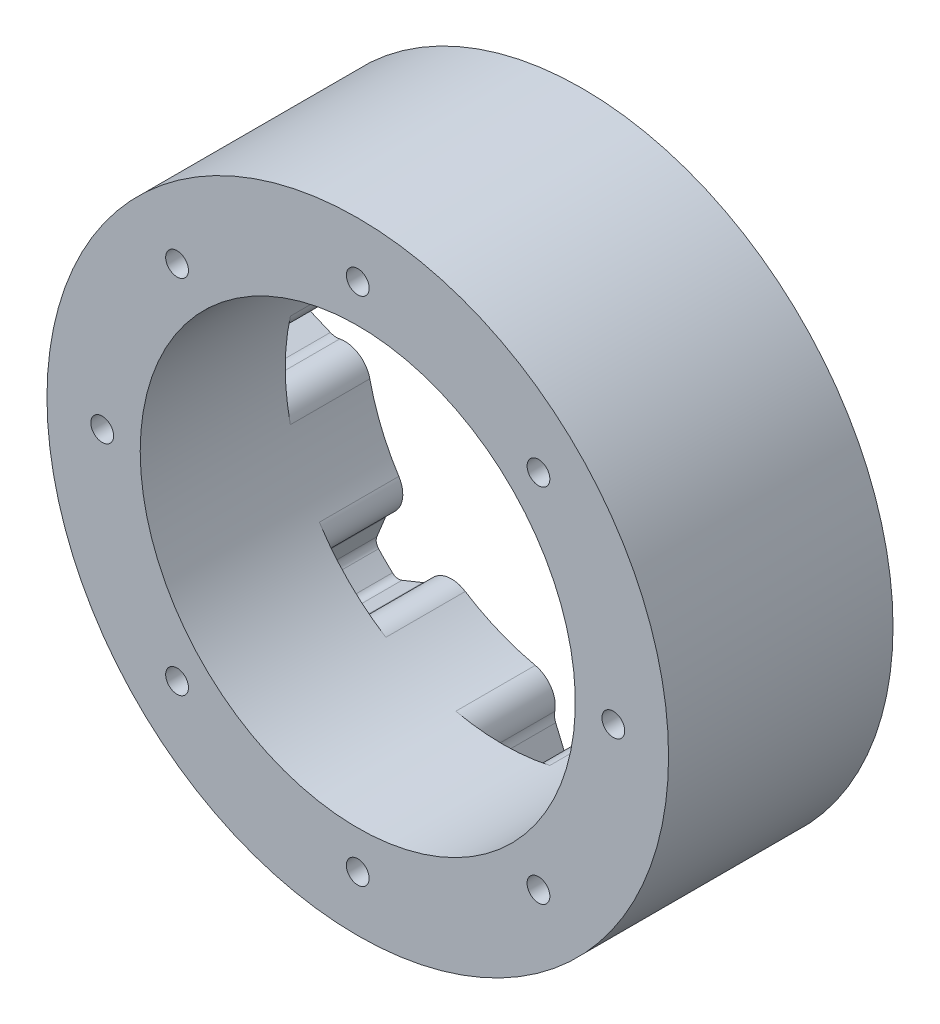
ISO-10303-21;
HEADER;
FILE_DESCRIPTION(('STEP AP214'),'2;1');
FILE_NAME('part.step','',(''),(''),'','','');
FILE_SCHEMA(('AUTOMOTIVE_DESIGN { 1 0 10303 214 1 1 1 1 }'));
ENDSEC;
DATA;
#1=APPLICATION_CONTEXT('core data for automotive mechanical design processes');
#2=APPLICATION_PROTOCOL_DEFINITION('international standard','automotive_design',2000,#1);
#3=PRODUCT_CONTEXT('',#1,'mechanical');
#4=PRODUCT('Part','Part','',(#3));
#5=PRODUCT_RELATED_PRODUCT_CATEGORY('part','',(#4));
#6=PRODUCT_DEFINITION_FORMATION('','',#4);
#7=PRODUCT_DEFINITION_CONTEXT('part definition',#1,'design');
#8=PRODUCT_DEFINITION('design','',#6,#7);
#9=PRODUCT_DEFINITION_SHAPE('','',#8);
#10=(LENGTH_UNIT() NAMED_UNIT(*) SI_UNIT(.MILLI.,.METRE.));
#11=(NAMED_UNIT(*) PLANE_ANGLE_UNIT() SI_UNIT($,.RADIAN.));
#12=(NAMED_UNIT(*) SI_UNIT($,.STERADIAN.) SOLID_ANGLE_UNIT());
#13=UNCERTAINTY_MEASURE_WITH_UNIT(LENGTH_MEASURE(1.E-05),#10,'distance_accuracy_value','');
#14=(GEOMETRIC_REPRESENTATION_CONTEXT(3) GLOBAL_UNCERTAINTY_ASSIGNED_CONTEXT((#13)) GLOBAL_UNIT_ASSIGNED_CONTEXT((#10,
#11,#12)) REPRESENTATION_CONTEXT('',''));
#15=CARTESIAN_POINT('',(0.,0.,0.));
#16=DIRECTION('',(0.,0.,1.));
#17=DIRECTION('',(1.,0.,0.));
#18=AXIS2_PLACEMENT_3D('',#15,#16,#17);
#19=CARTESIAN_POINT('',(0.,0.,-16.25));
#20=DIRECTION('',(0.,0.,1.));
#21=DIRECTION('',(1.,0.,0.));
#22=AXIS2_PLACEMENT_3D('',#19,#20,#21);
#23=PLANE('',#22);
#24=CARTESIAN_POINT('',(0.,0.,-16.25));
#25=DIRECTION('',(0.,0.,1.));
#26=DIRECTION('',(1.,0.,0.));
#27=AXIS2_PLACEMENT_3D('',#24,#25,#26);
#28=CIRCLE('',#27,45.);
#29=CARTESIAN_POINT('',(45.,0.,-16.25));
#30=VERTEX_POINT('',#29);
#31=EDGE_CURVE('E47',#30,#30,#28,.T.);
#32=ORIENTED_EDGE('',*,*,#31,.F.);
#33=EDGE_LOOP('',(#32));
#34=FACE_BOUND('',#33,.T.);
#35=CARTESIAN_POINT('',(0.,0.,-16.25));
#36=DIRECTION('',(0.,0.,-1.));
#37=DIRECTION('',(-1.,0.,0.));
#38=AXIS2_PLACEMENT_3D('',#35,#36,#37);
#39=CIRCLE('',#38,31.5);
#40=CARTESIAN_POINT('',(-30.7562122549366,6.80480769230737,-16.25));
#41=VERTEX_POINT('',#40);
#42=CARTESIAN_POINT('',(-26.5596519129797,16.9362005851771,-16.25));
#43=VERTEX_POINT('',#42);
#44=EDGE_CURVE('E544',#41,#43,#39,.T.);
#45=ORIENTED_EDGE('',*,*,#44,.F.);
#46=CARTESIAN_POINT('',(-34.3688467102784,7.60410256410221,-16.25));
#47=DIRECTION('',(0.,0.,1.));
#48=DIRECTION('',(0.,-1.,0.));
#49=AXIS2_PLACEMENT_3D('',#46,#47,#48);
#50=CIRCLE('',#49,3.7);
#51=CARTESIAN_POINT('',(-35.1122776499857,3.97955977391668,-16.25));
#52=VERTEX_POINT('',#51);
#53=EDGE_CURVE('E562',#52,#41,#50,.T.);
#54=ORIENTED_EDGE('',*,*,#53,.F.);
#55=CARTESIAN_POINT('',(-35.5744103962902,1.72646560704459,-16.25));
#56=DIRECTION('',(0.,0.,-1.));
#57=DIRECTION('',(0.,1.,0.));
#58=AXIS2_PLACEMENT_3D('',#55,#56,#57);
#59=CIRCLE('',#58,2.3);
#60=CARTESIAN_POINT('',(-36.469685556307,3.84506948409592,-16.25));
#61=VERTEX_POINT('',#60);
#62=EDGE_CURVE('E573',#61,#52,#59,.T.);
#63=ORIENTED_EDGE('',*,*,#62,.F.);
#64=DIRECTION('',(0.921132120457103,0.389250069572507,0.));
#65=VECTOR('',#64,1.);
#66=CARTESIAN_POINT('',(-39.4817875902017,2.57222175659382,-16.25));
#67=LINE('',#66,#65);
#68=CARTESIAN_POINT('',(-39.4817875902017,2.57222175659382,-16.25));
#69=VERTEX_POINT('',#68);
#70=EDGE_CURVE('E583',#69,#61,#67,.T.);
#71=ORIENTED_EDGE('',*,*,#70,.F.);
#72=CARTESIAN_POINT('',(-38.9757624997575,1.37474999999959,-16.25));
#73=DIRECTION('',(0.,0.,-1.));
#74=DIRECTION('',(0.,1.,0.));
#75=AXIS2_PLACEMENT_3D('',#72,#73,#74);
#76=CIRCLE('',#75,1.3);
#77=CARTESIAN_POINT('',(-40.2749545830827,1.42057499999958,-16.25));
#78=VERTEX_POINT('',#77);
#79=EDGE_CURVE('E2296',#78,#69,#76,.T.);
#80=ORIENTED_EDGE('',*,*,#79,.F.);
#81=CARTESIAN_POINT('',(0.,0.,-16.25));
#82=DIRECTION('',(0.,0.,-1.));
#83=DIRECTION('',(0.,1.,0.));
#84=AXIS2_PLACEMENT_3D('',#81,#82,#83);
#85=CIRCLE('',#84,40.3);
#86=CARTESIAN_POINT('',(-40.2749545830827,-1.42057500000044,-16.25));
#87=VERTEX_POINT('',#86);
#88=EDGE_CURVE('E2295',#87,#78,#85,.T.);
#89=ORIENTED_EDGE('',*,*,#88,.F.);
#90=CARTESIAN_POINT('',(-38.9757624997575,-1.37475000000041,-16.25));
#91=DIRECTION('',(0.,0.,-1.));
#92=DIRECTION('',(0.,-1.,0.));
#93=AXIS2_PLACEMENT_3D('',#90,#91,#92);
#94=CIRCLE('',#93,1.3);
#95=CARTESIAN_POINT('',(-39.4817875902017,-2.57222175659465,-16.25));
#96=VERTEX_POINT('',#95);
#97=EDGE_CURVE('E2286',#96,#87,#94,.T.);
#98=ORIENTED_EDGE('',*,*,#97,.F.);
#99=DIRECTION('',(-0.921132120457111,0.389250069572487,0.));
#100=VECTOR('',#99,1.);
#101=CARTESIAN_POINT('',(-39.4817875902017,-2.57222175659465,-16.25));
#102=LINE('',#101,#100);
#103=CARTESIAN_POINT('',(-36.4696855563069,-3.84506948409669,-16.25));
#104=VERTEX_POINT('',#103);
#105=EDGE_CURVE('E2284',#104,#96,#102,.T.);
#106=ORIENTED_EDGE('',*,*,#105,.F.);
#107=CARTESIAN_POINT('',(-35.5744103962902,-1.72646560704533,-16.25));
#108=DIRECTION('',(0.,0.,-1.));
#109=DIRECTION('',(0.,-1.,0.));
#110=AXIS2_PLACEMENT_3D('',#107,#108,#109);
#111=CIRCLE('',#110,2.3);
#112=CARTESIAN_POINT('',(-35.1122776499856,-3.97955977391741,-16.25));
#113=VERTEX_POINT('',#112);
#114=EDGE_CURVE('E691',#113,#104,#111,.T.);
#115=ORIENTED_EDGE('',*,*,#114,.F.);
#116=CARTESIAN_POINT('',(-34.3688467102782,-7.60410256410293,-16.25));
#117=DIRECTION('',(0.,0.,1.));
#118=DIRECTION('',(0.,1.,0.));
#119=AXIS2_PLACEMENT_3D('',#116,#117,#118);
#120=CIRCLE('',#119,3.7);
#121=CARTESIAN_POINT('',(-30.7562122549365,-6.80480769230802,-16.25));
#122=VERTEX_POINT('',#121);
#123=EDGE_CURVE('E574',#122,#113,#120,.T.);
#124=ORIENTED_EDGE('',*,*,#123,.F.);
#125=CARTESIAN_POINT('',(-26.5596519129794,-16.9362005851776,-16.25));
#126=VERTEX_POINT('',#125);
#127=EDGE_CURVE('E569',#126,#122,#39,.T.);
#128=ORIENTED_EDGE('',*,*,#127,.F.);
#129=CARTESIAN_POINT('',(-29.6793570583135,-18.9255320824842,-16.25));
#130=DIRECTION('',(0.,0.,1.));
#131=DIRECTION('',(0.707106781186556,-0.707106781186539,0.));
#132=AXIS2_PLACEMENT_3D('',#129,#130,#131);
#133=CIRCLE('',#132,3.7);
#134=CARTESIAN_POINT('',(-27.6421033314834,-22.0141559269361,-16.25));
#135=VERTEX_POINT('',#134);
#136=EDGE_CURVE('E684',#135,#126,#133,.T.);
#137=ORIENTED_EDGE('',*,*,#136,.F.);
#138=CARTESIAN_POINT('',(-26.3757023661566,-23.9341112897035,-16.25));
#139=DIRECTION('',(0.,0.,-1.));
#140=DIRECTION('',(-0.707106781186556,0.707106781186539,0.));
#141=AXIS2_PLACEMENT_3D('',#138,#139,#140);
#142=CIRCLE('',#141,2.3);
#143=CARTESIAN_POINT('',(-28.5068366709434,-23.0690872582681,-16.25));
#144=VERTEX_POINT('',#143);
#145=EDGE_CURVE('E679',#144,#135,#142,.T.);
#146=ORIENTED_EDGE('',*,*,#145,.F.);
#147=DIRECTION('',(0.376097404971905,0.926580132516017,0.));
#148=VECTOR('',#147,1.);
#149=CARTESIAN_POINT('',(-29.7366751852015,-26.0990042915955,-16.25));
#150=LINE('',#149,#148);
#151=CARTESIAN_POINT('',(-29.7366751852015,-26.0990042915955,-16.25));
#152=VERTEX_POINT('',#151);
#153=EDGE_CURVE('E671',#152,#144,#150,.T.);
#154=ORIENTED_EDGE('',*,*,#153,.F.);
#155=CARTESIAN_POINT('',(-28.5321210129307,-26.587930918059,-16.25));
#156=DIRECTION('',(0.,0.,-1.));
#157=DIRECTION('',(-0.707106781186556,0.707106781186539,0.));
#158=AXIS2_PLACEMENT_3D('',#155,#156,#157);
#159=CIRCLE('',#158,1.3);
#160=CARTESIAN_POINT('',(-29.4831917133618,-27.4741952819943,-16.25));
#161=VERTEX_POINT('',#160);
#162=EDGE_CURVE('E672',#161,#152,#159,.T.);
#163=ORIENTED_EDGE('',*,*,#162,.F.);
#164=CARTESIAN_POINT('',(0.,0.,-16.25));
#165=DIRECTION('',(0.,0.,-1.));
#166=DIRECTION('',(-0.707106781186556,0.707106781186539,0.));
#167=AXIS2_PLACEMENT_3D('',#164,#165,#166);
#168=CIRCLE('',#167,40.3);
#169=CARTESIAN_POINT('',(-27.4741952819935,-29.4831917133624,-16.25));
#170=VERTEX_POINT('',#169);
#171=EDGE_CURVE('E667',#170,#161,#168,.T.);
#172=ORIENTED_EDGE('',*,*,#171,.F.);
#173=CARTESIAN_POINT('',(-26.5879309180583,-28.5321210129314,-16.25));
#174=DIRECTION('',(0.,0.,-1.));
#175=DIRECTION('',(0.707106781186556,-0.707106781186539,0.));
#176=AXIS2_PLACEMENT_3D('',#173,#174,#175);
#177=CIRCLE('',#176,1.3);
#178=CARTESIAN_POINT('',(-26.0990042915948,-29.7366751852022,-16.25));
#179=VERTEX_POINT('',#178);
#180=EDGE_CURVE('E664',#179,#170,#177,.T.);
#181=ORIENTED_EDGE('',*,*,#180,.F.);
#182=DIRECTION('',(-0.926580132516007,-0.376097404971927,0.));
#183=VECTOR('',#182,1.);
#184=CARTESIAN_POINT('',(-26.0990042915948,-29.7366751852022,-16.25));
#185=LINE('',#184,#183);
#186=CARTESIAN_POINT('',(-23.0690872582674,-28.506836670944,-16.25));
#187=VERTEX_POINT('',#186);
#188=EDGE_CURVE('E658',#187,#179,#185,.T.);
#189=ORIENTED_EDGE('',*,*,#188,.F.);
#190=CARTESIAN_POINT('',(-23.9341112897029,-26.3757023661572,-16.25));
#191=DIRECTION('',(0.,0.,-1.));
#192=DIRECTION('',(0.707106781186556,-0.707106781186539,0.));
#193=AXIS2_PLACEMENT_3D('',#190,#191,#192);
#194=CIRCLE('',#193,2.3);
#195=CARTESIAN_POINT('',(-22.0141559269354,-27.6421033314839,-16.25));
#196=VERTEX_POINT('',#195);
#197=EDGE_CURVE('E656',#196,#187,#194,.T.);
#198=ORIENTED_EDGE('',*,*,#197,.F.);
#199=CARTESIAN_POINT('',(-18.9255320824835,-29.6793570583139,-16.25));
#200=DIRECTION('',(0.,0.,1.));
#201=DIRECTION('',(-0.707106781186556,0.707106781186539,0.));
#202=AXIS2_PLACEMENT_3D('',#199,#200,#201);
#203=CIRCLE('',#202,3.7);
#204=CARTESIAN_POINT('',(-16.936200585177,-26.5596519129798,-16.25));
#205=VERTEX_POINT('',#204);
#206=EDGE_CURVE('E619',#205,#196,#203,.T.);
#207=ORIENTED_EDGE('',*,*,#206,.F.);
#208=CARTESIAN_POINT('',(-6.80480769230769,-30.7562122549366,-16.25));
#209=VERTEX_POINT('',#208);
#210=EDGE_CURVE('E1382',#209,#205,#39,.T.);
#211=ORIENTED_EDGE('',*,*,#210,.F.);
#212=CARTESIAN_POINT('',(-7.60410256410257,-34.3688467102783,-16.25));
#213=DIRECTION('',(0.,0.,1.));
#214=DIRECTION('',(1.,0.,0.));
#215=AXIS2_PLACEMENT_3D('',#212,#213,#214);
#216=CIRCLE('',#215,3.7);
#217=CARTESIAN_POINT('',(-3.97955977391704,-35.1122776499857,-16.25));
#218=VERTEX_POINT('',#217);
#219=EDGE_CURVE('E1317',#218,#209,#216,.T.);
#220=ORIENTED_EDGE('',*,*,#219,.F.);
#221=CARTESIAN_POINT('',(-1.72646560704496,-35.5744103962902,-16.25));
#222=DIRECTION('',(0.,0.,-1.));
#223=DIRECTION('',(-1.,0.,0.));
#224=AXIS2_PLACEMENT_3D('',#221,#222,#223);
#225=CIRCLE('',#224,2.3);
#226=CARTESIAN_POINT('',(-3.8450694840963,-36.469685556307,-16.25));
#227=VERTEX_POINT('',#226);
#228=EDGE_CURVE('E1312',#227,#218,#225,.T.);
#229=ORIENTED_EDGE('',*,*,#228,.F.);
#230=DIRECTION('',(-0.389250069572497,0.921132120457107,0.));
#231=VECTOR('',#230,1.);
#232=CARTESIAN_POINT('',(-2.57222175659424,-39.4817875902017,-16.25));
#233=LINE('',#232,#231);
#234=CARTESIAN_POINT('',(-2.57222175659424,-39.4817875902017,-16.25));
#235=VERTEX_POINT('',#234);
#236=EDGE_CURVE('E1309',#235,#227,#233,.T.);
#237=ORIENTED_EDGE('',*,*,#236,.F.);
#238=CARTESIAN_POINT('',(-1.37475,-38.9757624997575,-16.25));
#239=DIRECTION('',(0.,0.,-1.));
#240=DIRECTION('',(-1.,0.,0.));
#241=AXIS2_PLACEMENT_3D('',#238,#239,#240);
#242=CIRCLE('',#241,1.3);
#243=CARTESIAN_POINT('',(-1.420575,-40.2749545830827,-16.25));
#244=VERTEX_POINT('',#243);
#245=EDGE_CURVE('E1306',#244,#235,#242,.T.);
#246=ORIENTED_EDGE('',*,*,#245,.F.);
#247=CARTESIAN_POINT('',(0.,0.,-16.25));
#248=DIRECTION('',(0.,0.,-1.));
#249=DIRECTION('',(-1.,0.,0.));
#250=AXIS2_PLACEMENT_3D('',#247,#248,#249);
#251=CIRCLE('',#250,40.3);
#252=CARTESIAN_POINT('',(1.42057500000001,-40.2749545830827,-16.25));
#253=VERTEX_POINT('',#252);
#254=EDGE_CURVE('E1305',#253,#244,#251,.T.);
#255=ORIENTED_EDGE('',*,*,#254,.F.);
#256=CARTESIAN_POINT('',(1.37475,-38.9757624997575,-16.25));
#257=DIRECTION('',(0.,0.,-1.));
#258=DIRECTION('',(1.,0.,0.));
#259=AXIS2_PLACEMENT_3D('',#256,#257,#258);
#260=CIRCLE('',#259,1.3);
#261=CARTESIAN_POINT('',(2.57222175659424,-39.4817875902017,-16.25));
#262=VERTEX_POINT('',#261);
#263=EDGE_CURVE('E1296',#262,#253,#260,.T.);
#264=ORIENTED_EDGE('',*,*,#263,.F.);
#265=DIRECTION('',(-0.389250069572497,-0.921132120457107,0.));
#266=VECTOR('',#265,1.);
#267=CARTESIAN_POINT('',(2.57222175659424,-39.4817875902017,-16.25));
#268=LINE('',#267,#266);
#269=CARTESIAN_POINT('',(3.84506948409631,-36.469685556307,-16.25));
#270=VERTEX_POINT('',#269);
#271=EDGE_CURVE('E1294',#270,#262,#268,.T.);
#272=ORIENTED_EDGE('',*,*,#271,.F.);
#273=CARTESIAN_POINT('',(1.72646560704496,-35.5744103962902,-16.25));
#274=DIRECTION('',(0.,0.,-1.));
#275=DIRECTION('',(1.,0.,0.));
#276=AXIS2_PLACEMENT_3D('',#273,#274,#275);
#277=CIRCLE('',#276,2.3);
#278=CARTESIAN_POINT('',(3.97955977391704,-35.1122776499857,-16.25));
#279=VERTEX_POINT('',#278);
#280=EDGE_CURVE('E1222',#279,#270,#277,.T.);
#281=ORIENTED_EDGE('',*,*,#280,.F.);
#282=CARTESIAN_POINT('',(7.60410256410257,-34.3688467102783,-16.25));
#283=DIRECTION('',(0.,0.,1.));
#284=DIRECTION('',(-1.,0.,0.));
#285=AXIS2_PLACEMENT_3D('',#282,#283,#284);
#286=CIRCLE('',#285,3.7);
#287=CARTESIAN_POINT('',(6.80480769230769,-30.7562122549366,-16.25));
#288=VERTEX_POINT('',#287);
#289=EDGE_CURVE('E1254',#288,#279,#286,.T.);
#290=ORIENTED_EDGE('',*,*,#289,.F.);
#291=CARTESIAN_POINT('',(16.9362005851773,-26.5596519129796,-16.25));
#292=VERTEX_POINT('',#291);
#293=EDGE_CURVE('E1379',#292,#288,#39,.T.);
#294=ORIENTED_EDGE('',*,*,#293,.F.);
#295=CARTESIAN_POINT('',(18.9255320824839,-29.6793570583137,-16.25));
#296=DIRECTION('',(0.,0.,1.));
#297=DIRECTION('',(0.707106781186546,0.707106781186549,0.));
#298=AXIS2_PLACEMENT_3D('',#295,#296,#297);
#299=CIRCLE('',#298,3.7);
#300=CARTESIAN_POINT('',(22.0141559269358,-27.6421033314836,-16.25));
#301=VERTEX_POINT('',#300);
#302=EDGE_CURVE('E1212',#301,#292,#299,.T.);
#303=ORIENTED_EDGE('',*,*,#302,.F.);
#304=CARTESIAN_POINT('',(23.9341112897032,-26.3757023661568,-16.25));
#305=DIRECTION('',(0.,0.,-1.));
#306=DIRECTION('',(-0.707106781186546,-0.707106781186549,0.));
#307=AXIS2_PLACEMENT_3D('',#304,#305,#306);
#308=CIRCLE('',#307,2.3);
#309=CARTESIAN_POINT('',(23.0690872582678,-28.5068366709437,-16.25));
#310=VERTEX_POINT('',#309);
#311=EDGE_CURVE('E1210',#310,#301,#308,.T.);
#312=ORIENTED_EDGE('',*,*,#311,.F.);
#313=DIRECTION('',(-0.926580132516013,0.376097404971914,0.));
#314=VECTOR('',#313,1.);
#315=CARTESIAN_POINT('',(26.0990042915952,-29.7366751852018,-16.25));
#316=LINE('',#315,#314);
#317=CARTESIAN_POINT('',(26.0990042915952,-29.7366751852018,-16.25));
#318=VERTEX_POINT('',#317);
#319=EDGE_CURVE('E1203',#318,#310,#316,.T.);
#320=ORIENTED_EDGE('',*,*,#319,.F.);
#321=CARTESIAN_POINT('',(26.5879309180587,-28.532121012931,-16.25));
#322=DIRECTION('',(0.,0.,-1.));
#323=DIRECTION('',(-0.707106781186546,-0.707106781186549,0.));
#324=AXIS2_PLACEMENT_3D('',#321,#322,#323);
#325=CIRCLE('',#324,1.3);
#326=CARTESIAN_POINT('',(27.474195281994,-29.483191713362,-16.25));
#327=VERTEX_POINT('',#326);
#328=EDGE_CURVE('E1197',#327,#318,#325,.T.);
#329=ORIENTED_EDGE('',*,*,#328,.F.);
#330=CARTESIAN_POINT('',(0.,0.,-16.25));
#331=DIRECTION('',(0.,0.,-1.));
#332=DIRECTION('',(-0.707106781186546,-0.707106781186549,0.));
#333=AXIS2_PLACEMENT_3D('',#330,#331,#332);
#334=CIRCLE('',#333,40.3);
#335=CARTESIAN_POINT('',(29.4831917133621,-27.4741952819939,-16.25));
#336=VERTEX_POINT('',#335);
#337=EDGE_CURVE('E1192',#336,#327,#334,.T.);
#338=ORIENTED_EDGE('',*,*,#337,.F.);
#339=CARTESIAN_POINT('',(28.5321210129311,-26.5879309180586,-16.25));
#340=DIRECTION('',(0.,0.,-1.));
#341=DIRECTION('',(0.707106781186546,0.707106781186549,0.));
#342=AXIS2_PLACEMENT_3D('',#339,#340,#341);
#343=CIRCLE('',#342,1.3);
#344=CARTESIAN_POINT('',(29.7366751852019,-26.0990042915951,-16.25));
#345=VERTEX_POINT('',#344);
#346=EDGE_CURVE('E1193',#345,#336,#343,.T.);
#347=ORIENTED_EDGE('',*,*,#346,.F.);
#348=DIRECTION('',(0.376097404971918,-0.926580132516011,0.));
#349=VECTOR('',#348,1.);
#350=CARTESIAN_POINT('',(29.7366751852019,-26.0990042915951,-16.25));
#351=LINE('',#350,#349);
#352=CARTESIAN_POINT('',(28.5068366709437,-23.0690872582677,-16.25));
#353=VERTEX_POINT('',#352);
#354=EDGE_CURVE('E1187',#353,#345,#351,.T.);
#355=ORIENTED_EDGE('',*,*,#354,.F.);
#356=CARTESIAN_POINT('',(26.3757023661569,-23.9341112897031,-16.25));
#357=DIRECTION('',(0.,0.,-1.));
#358=DIRECTION('',(0.707106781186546,0.707106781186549,0.));
#359=AXIS2_PLACEMENT_3D('',#356,#357,#358);
#360=CIRCLE('',#359,2.3);
#361=CARTESIAN_POINT('',(27.6421033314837,-22.0141559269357,-16.25));
#362=VERTEX_POINT('',#361);
#363=EDGE_CURVE('E803',#362,#353,#360,.T.);
#364=ORIENTED_EDGE('',*,*,#363,.F.);
#365=CARTESIAN_POINT('',(29.6793570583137,-18.9255320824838,-16.25));
#366=DIRECTION('',(0.,0.,1.));
#367=DIRECTION('',(-0.707106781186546,-0.707106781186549,0.));
#368=AXIS2_PLACEMENT_3D('',#365,#366,#367);
#369=CIRCLE('',#368,3.7);
#370=CARTESIAN_POINT('',(26.5596519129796,-16.9362005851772,-16.25));
#371=VERTEX_POINT('',#370);
#372=EDGE_CURVE('E1148',#371,#362,#369,.T.);
#373=ORIENTED_EDGE('',*,*,#372,.F.);
#374=CARTESIAN_POINT('',(30.7562122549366,-6.80480769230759,-16.25));
#375=VERTEX_POINT('',#374);
#376=EDGE_CURVE('E1381',#375,#371,#39,.T.);
#377=ORIENTED_EDGE('',*,*,#376,.F.);
#378=CARTESIAN_POINT('',(34.3688467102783,-7.60410256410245,-16.25));
#379=DIRECTION('',(0.,0.,1.));
#380=DIRECTION('',(0.,1.,0.));
#381=AXIS2_PLACEMENT_3D('',#378,#379,#380);
#382=CIRCLE('',#381,3.7);
#383=CARTESIAN_POINT('',(35.1122776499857,-3.97955977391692,-16.25));
#384=VERTEX_POINT('',#383);
#385=EDGE_CURVE('E791',#384,#375,#382,.T.);
#386=ORIENTED_EDGE('',*,*,#385,.F.);
#387=CARTESIAN_POINT('',(35.5744103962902,-1.72646560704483,-16.25));
#388=DIRECTION('',(0.,0.,-1.));
#389=DIRECTION('',(0.,-1.,0.));
#390=AXIS2_PLACEMENT_3D('',#387,#388,#389);
#391=CIRCLE('',#390,2.3);
#392=CARTESIAN_POINT('',(36.469685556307,-3.84506948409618,-16.25));
#393=VERTEX_POINT('',#392);
#394=EDGE_CURVE('E790',#393,#384,#391,.T.);
#395=ORIENTED_EDGE('',*,*,#394,.F.);
#396=DIRECTION('',(-0.921132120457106,-0.3892500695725,0.));
#397=VECTOR('',#396,1.);
#398=CARTESIAN_POINT('',(39.4817875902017,-2.5722217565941,-16.25));
#399=LINE('',#398,#397);
#400=CARTESIAN_POINT('',(39.4817875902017,-2.5722217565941,-16.25));
#401=VERTEX_POINT('',#400);
#402=EDGE_CURVE('E783',#401,#393,#399,.T.);
#403=ORIENTED_EDGE('',*,*,#402,.F.);
#404=CARTESIAN_POINT('',(38.9757624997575,-1.37474999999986,-16.25));
#405=DIRECTION('',(0.,0.,-1.));
#406=DIRECTION('',(0.,-1.,0.));
#407=AXIS2_PLACEMENT_3D('',#404,#405,#406);
#408=CIRCLE('',#407,1.3);
#409=CARTESIAN_POINT('',(40.2749545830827,-1.42057499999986,-16.25));
#410=VERTEX_POINT('',#409);
#411=EDGE_CURVE('E778',#410,#401,#408,.T.);
#412=ORIENTED_EDGE('',*,*,#411,.F.);
#413=CARTESIAN_POINT('',(0.,0.,-16.25));
#414=DIRECTION('',(0.,0.,-1.));
#415=DIRECTION('',(0.,-1.,0.));
#416=AXIS2_PLACEMENT_3D('',#413,#414,#415);
#417=CIRCLE('',#416,40.3);
#418=CARTESIAN_POINT('',(40.2749545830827,1.42057500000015,-16.25));
#419=VERTEX_POINT('',#418);
#420=EDGE_CURVE('E773',#419,#410,#417,.T.);
#421=ORIENTED_EDGE('',*,*,#420,.F.);
#422=CARTESIAN_POINT('',(38.9757624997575,1.37475000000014,-16.25));
#423=DIRECTION('',(0.,0.,-1.));
#424=DIRECTION('',(0.,1.,0.));
#425=AXIS2_PLACEMENT_3D('',#422,#423,#424);
#426=CIRCLE('',#425,1.3);
#427=CARTESIAN_POINT('',(39.4817875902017,2.57222175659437,-16.25));
#428=VERTEX_POINT('',#427);
#429=EDGE_CURVE('E772',#428,#419,#426,.T.);
#430=ORIENTED_EDGE('',*,*,#429,.F.);
#431=DIRECTION('',(0.921132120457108,-0.389250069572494,0.));
#432=VECTOR('',#431,1.);
#433=CARTESIAN_POINT('',(39.4817875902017,2.57222175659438,-16.25));
#434=LINE('',#433,#432);
#435=CARTESIAN_POINT('',(36.469685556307,3.84506948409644,-16.25));
#436=VERTEX_POINT('',#435);
#437=EDGE_CURVE('E766',#436,#428,#434,.T.);
#438=ORIENTED_EDGE('',*,*,#437,.F.);
#439=CARTESIAN_POINT('',(35.5744103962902,1.72646560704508,-16.25));
#440=DIRECTION('',(0.,0.,-1.));
#441=DIRECTION('',(0.,1.,0.));
#442=AXIS2_PLACEMENT_3D('',#439,#440,#441);
#443=CIRCLE('',#442,2.3);
#444=CARTESIAN_POINT('',(35.1122776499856,3.97955977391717,-16.25));
#445=VERTEX_POINT('',#444);
#446=EDGE_CURVE('E61',#445,#436,#443,.T.);
#447=ORIENTED_EDGE('',*,*,#446,.F.);
#448=CARTESIAN_POINT('',(34.3688467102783,7.60410256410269,-16.25));
#449=DIRECTION('',(0.,0.,1.));
#450=DIRECTION('',(0.,-1.,0.));
#451=AXIS2_PLACEMENT_3D('',#448,#449,#450);
#452=CIRCLE('',#451,3.7);
#453=CARTESIAN_POINT('',(30.7562122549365,6.8048076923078,-16.25));
#454=VERTEX_POINT('',#453);
#455=EDGE_CURVE('E730',#454,#445,#452,.T.);
#456=ORIENTED_EDGE('',*,*,#455,.F.);
#457=CARTESIAN_POINT('',(26.5596519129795,16.9362005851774,-16.25));
#458=VERTEX_POINT('',#457);
#459=EDGE_CURVE('E2243',#458,#454,#39,.T.);
#460=ORIENTED_EDGE('',*,*,#459,.F.);
#461=CARTESIAN_POINT('',(29.6793570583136,18.925532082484,-16.25));
#462=DIRECTION('',(0.,0.,1.));
#463=DIRECTION('',(-0.707106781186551,0.707106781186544,0.));
#464=AXIS2_PLACEMENT_3D('',#461,#462,#463);
#465=CIRCLE('',#464,3.7);
#466=CARTESIAN_POINT('',(27.6421033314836,22.0141559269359,-16.25));
#467=VERTEX_POINT('',#466);
#468=EDGE_CURVE('E896',#467,#458,#465,.T.);
#469=ORIENTED_EDGE('',*,*,#468,.F.);
#470=CARTESIAN_POINT('',(26.3757023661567,23.9341112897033,-16.25));
#471=DIRECTION('',(0.,0.,-1.));
#472=DIRECTION('',(0.707106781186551,-0.707106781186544,0.));
#473=AXIS2_PLACEMENT_3D('',#470,#471,#472);
#474=CIRCLE('',#473,2.3);
#475=CARTESIAN_POINT('',(28.5068366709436,23.0690872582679,-16.25));
#476=VERTEX_POINT('',#475);
#477=EDGE_CURVE('E894',#476,#467,#474,.T.);
#478=ORIENTED_EDGE('',*,*,#477,.F.);
#479=DIRECTION('',(-0.376097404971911,-0.926580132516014,0.));
#480=VECTOR('',#479,1.);
#481=CARTESIAN_POINT('',(29.7366751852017,26.0990042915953,-16.25));
#482=LINE('',#481,#480);
#483=CARTESIAN_POINT('',(29.7366751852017,26.0990042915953,-16.25));
#484=VERTEX_POINT('',#483);
#485=EDGE_CURVE('E890',#484,#476,#482,.T.);
#486=ORIENTED_EDGE('',*,*,#485,.F.);
#487=CARTESIAN_POINT('',(28.5321210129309,26.5879309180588,-16.25));
#488=DIRECTION('',(0.,0.,-1.));
#489=DIRECTION('',(0.707106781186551,-0.707106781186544,0.));
#490=AXIS2_PLACEMENT_3D('',#487,#488,#489);
#491=CIRCLE('',#490,1.3);
#492=CARTESIAN_POINT('',(29.4831917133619,27.4741952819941,-16.25));
#493=VERTEX_POINT('',#492);
#494=EDGE_CURVE('E886',#493,#484,#491,.T.);
#495=ORIENTED_EDGE('',*,*,#494,.F.);
#496=CARTESIAN_POINT('',(0.,0.,-16.25));
#497=DIRECTION('',(0.,0.,-1.));
#498=DIRECTION('',(0.707106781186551,-0.707106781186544,0.));
#499=AXIS2_PLACEMENT_3D('',#496,#497,#498);
#500=CIRCLE('',#499,40.3);
#501=CARTESIAN_POINT('',(27.4741952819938,29.4831917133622,-16.25));
#502=VERTEX_POINT('',#501);
#503=EDGE_CURVE('E885',#502,#493,#500,.T.);
#504=ORIENTED_EDGE('',*,*,#503,.F.);
#505=CARTESIAN_POINT('',(26.5879309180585,28.5321210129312,-16.25));
#506=DIRECTION('',(0.,0.,-1.));
#507=DIRECTION('',(-0.707106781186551,0.707106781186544,0.));
#508=AXIS2_PLACEMENT_3D('',#505,#506,#507);
#509=CIRCLE('',#508,1.3);
#510=CARTESIAN_POINT('',(26.099004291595,29.736675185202,-16.25));
#511=VERTEX_POINT('',#510);
#512=EDGE_CURVE('E877',#511,#502,#509,.T.);
#513=ORIENTED_EDGE('',*,*,#512,.F.);
#514=DIRECTION('',(0.92658013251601,0.376097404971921,0.));
#515=VECTOR('',#514,1.);
#516=CARTESIAN_POINT('',(26.099004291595,29.736675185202,-16.25));
#517=LINE('',#516,#515);
#518=CARTESIAN_POINT('',(23.0690872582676,28.5068366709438,-16.25));
#519=VERTEX_POINT('',#518);
#520=EDGE_CURVE('E873',#519,#511,#517,.T.);
#521=ORIENTED_EDGE('',*,*,#520,.F.);
#522=CARTESIAN_POINT('',(23.9341112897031,26.375702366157,-16.25));
#523=DIRECTION('',(0.,0.,-1.));
#524=DIRECTION('',(-0.707106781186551,0.707106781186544,0.));
#525=AXIS2_PLACEMENT_3D('',#522,#523,#524);
#526=CIRCLE('',#525,2.3);
#527=CARTESIAN_POINT('',(22.0141559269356,27.6421033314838,-16.25));
#528=VERTEX_POINT('',#527);
#529=EDGE_CURVE('E69',#528,#519,#526,.T.);
#530=ORIENTED_EDGE('',*,*,#529,.F.);
#531=CARTESIAN_POINT('',(18.9255320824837,29.6793570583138,-16.25));
#532=DIRECTION('',(0.,0.,1.));
#533=DIRECTION('',(0.707106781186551,-0.707106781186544,0.));
#534=AXIS2_PLACEMENT_3D('',#531,#532,#533);
#535=CIRCLE('',#534,3.7);
#536=CARTESIAN_POINT('',(16.9362005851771,26.5596519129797,-16.25));
#537=VERTEX_POINT('',#536);
#538=EDGE_CURVE('E833',#537,#528,#535,.T.);
#539=ORIENTED_EDGE('',*,*,#538,.F.);
#540=CARTESIAN_POINT('',(6.80480769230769,30.7562122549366,-16.25));
#541=VERTEX_POINT('',#540);
#542=EDGE_CURVE('E2241',#541,#537,#39,.T.);
#543=ORIENTED_EDGE('',*,*,#542,.F.);
#544=CARTESIAN_POINT('',(7.60410256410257,34.3688467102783,-16.25));
#545=DIRECTION('',(0.,0.,1.));
#546=DIRECTION('',(-1.,0.,0.));
#547=AXIS2_PLACEMENT_3D('',#544,#545,#546);
#548=CIRCLE('',#547,3.7);
#549=CARTESIAN_POINT('',(3.97955977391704,35.1122776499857,-16.25));
#550=VERTEX_POINT('',#549);
#551=EDGE_CURVE('E1004',#550,#541,#548,.T.);
#552=ORIENTED_EDGE('',*,*,#551,.F.);
#553=CARTESIAN_POINT('',(1.72646560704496,35.5744103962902,-16.25));
#554=DIRECTION('',(0.,0.,-1.));
#555=DIRECTION('',(1.,0.,0.));
#556=AXIS2_PLACEMENT_3D('',#553,#554,#555);
#557=CIRCLE('',#556,2.3);
#558=CARTESIAN_POINT('',(3.8450694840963,36.469685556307,-16.25));
#559=VERTEX_POINT('',#558);
#560=EDGE_CURVE('E1000',#559,#550,#557,.T.);
#561=ORIENTED_EDGE('',*,*,#560,.F.);
#562=DIRECTION('',(0.389250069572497,-0.921132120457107,0.));
#563=VECTOR('',#562,1.);
#564=CARTESIAN_POINT('',(2.57222175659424,39.4817875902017,-16.25));
#565=LINE('',#564,#563);
#566=CARTESIAN_POINT('',(2.57222175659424,39.4817875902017,-16.25));
#567=VERTEX_POINT('',#566);
#568=EDGE_CURVE('E996',#567,#559,#565,.T.);
#569=ORIENTED_EDGE('',*,*,#568,.F.);
#570=CARTESIAN_POINT('',(1.37475,38.9757624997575,-16.25));
#571=DIRECTION('',(0.,0.,-1.));
#572=DIRECTION('',(1.,0.,0.));
#573=AXIS2_PLACEMENT_3D('',#570,#571,#572);
#574=CIRCLE('',#573,1.3);
#575=CARTESIAN_POINT('',(1.420575,40.2749545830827,-16.25));
#576=VERTEX_POINT('',#575);
#577=EDGE_CURVE('E995',#576,#567,#574,.T.);
#578=ORIENTED_EDGE('',*,*,#577,.F.);
#579=CARTESIAN_POINT('',(0.,0.,-16.25));
#580=DIRECTION('',(0.,0.,-1.));
#581=DIRECTION('',(1.,0.,0.));
#582=AXIS2_PLACEMENT_3D('',#579,#580,#581);
#583=CIRCLE('',#582,40.3);
#584=CARTESIAN_POINT('',(-1.42057500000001,40.2749545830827,-16.25));
#585=VERTEX_POINT('',#584);
#586=EDGE_CURVE('E987',#585,#576,#583,.T.);
#587=ORIENTED_EDGE('',*,*,#586,.F.);
#588=CARTESIAN_POINT('',(-1.37475,38.9757624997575,-16.25));
#589=DIRECTION('',(0.,0.,-1.));
#590=DIRECTION('',(-1.,0.,0.));
#591=AXIS2_PLACEMENT_3D('',#588,#589,#590);
#592=CIRCLE('',#591,1.3);
#593=CARTESIAN_POINT('',(-2.57222175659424,39.4817875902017,-16.25));
#594=VERTEX_POINT('',#593);
#595=EDGE_CURVE('E982',#594,#585,#592,.T.);
#596=ORIENTED_EDGE('',*,*,#595,.F.);
#597=DIRECTION('',(0.389250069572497,0.921132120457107,0.));
#598=VECTOR('',#597,1.);
#599=CARTESIAN_POINT('',(-2.57222175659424,39.4817875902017,-16.25));
#600=LINE('',#599,#598);
#601=CARTESIAN_POINT('',(-3.84506948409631,36.469685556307,-16.25));
#602=VERTEX_POINT('',#601);
#603=EDGE_CURVE('E977',#602,#594,#600,.T.);
#604=ORIENTED_EDGE('',*,*,#603,.F.);
#605=CARTESIAN_POINT('',(-1.72646560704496,35.5744103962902,-16.25));
#606=DIRECTION('',(0.,0.,-1.));
#607=DIRECTION('',(-1.,0.,0.));
#608=AXIS2_PLACEMENT_3D('',#605,#606,#607);
#609=CIRCLE('',#608,2.3);
#610=CARTESIAN_POINT('',(-3.97955977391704,35.1122776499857,-16.25));
#611=VERTEX_POINT('',#610);
#612=EDGE_CURVE('E976',#611,#602,#609,.T.);
#613=ORIENTED_EDGE('',*,*,#612,.F.);
#614=CARTESIAN_POINT('',(-7.60410256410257,34.3688467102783,-16.25));
#615=DIRECTION('',(0.,0.,1.));
#616=DIRECTION('',(1.,0.,0.));
#617=AXIS2_PLACEMENT_3D('',#614,#615,#616);
#618=CIRCLE('',#617,3.7);
#619=CARTESIAN_POINT('',(-6.80480769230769,30.7562122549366,-16.25));
#620=VERTEX_POINT('',#619);
#621=EDGE_CURVE('E936',#620,#611,#618,.T.);
#622=ORIENTED_EDGE('',*,*,#621,.F.);
#623=CARTESIAN_POINT('',(-16.9362005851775,26.5596519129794,-16.25));
#624=VERTEX_POINT('',#623);
#625=EDGE_CURVE('E570',#624,#620,#39,.T.);
#626=ORIENTED_EDGE('',*,*,#625,.F.);
#627=CARTESIAN_POINT('',(-18.9255320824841,29.6793570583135,-16.25));
#628=DIRECTION('',(0.,0.,1.));
#629=DIRECTION('',(-0.707106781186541,-0.707106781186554,0.));
#630=AXIS2_PLACEMENT_3D('',#627,#628,#629);
#631=CIRCLE('',#630,3.7);
#632=CARTESIAN_POINT('',(-22.014155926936,27.6421033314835,-16.25));
#633=VERTEX_POINT('',#632);
#634=EDGE_CURVE('E1109',#633,#624,#631,.T.);
#635=ORIENTED_EDGE('',*,*,#634,.F.);
#636=CARTESIAN_POINT('',(-23.9341112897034,26.3757023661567,-16.25));
#637=DIRECTION('',(0.,0.,-1.));
#638=DIRECTION('',(0.707106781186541,0.707106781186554,0.));
#639=AXIS2_PLACEMENT_3D('',#636,#637,#638);
#640=CIRCLE('',#639,2.3);
#641=CARTESIAN_POINT('',(-23.069087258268,28.5068366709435,-16.25));
#642=VERTEX_POINT('',#641);
#643=EDGE_CURVE('E1101',#642,#633,#640,.T.);
#644=ORIENTED_EDGE('',*,*,#643,.F.);
#645=DIRECTION('',(0.926580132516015,-0.376097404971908,0.));
#646=VECTOR('',#645,1.);
#647=CARTESIAN_POINT('',(-26.0990042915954,29.7366751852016,-16.25));
#648=LINE('',#647,#646);
#649=CARTESIAN_POINT('',(-26.0990042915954,29.7366751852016,-16.25));
#650=VERTEX_POINT('',#649);
#651=EDGE_CURVE('E1099',#650,#642,#648,.T.);
#652=ORIENTED_EDGE('',*,*,#651,.F.);
#653=CARTESIAN_POINT('',(-26.5879309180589,28.5321210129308,-16.25));
#654=DIRECTION('',(0.,0.,-1.));
#655=DIRECTION('',(0.707106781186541,0.707106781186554,0.));
#656=AXIS2_PLACEMENT_3D('',#653,#654,#655);
#657=CIRCLE('',#656,1.3);
#658=CARTESIAN_POINT('',(-27.4741952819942,29.4831917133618,-16.25));
#659=VERTEX_POINT('',#658);
#660=EDGE_CURVE('E1096',#659,#650,#657,.T.);
#661=ORIENTED_EDGE('',*,*,#660,.F.);
#662=CARTESIAN_POINT('',(0.,0.,-16.25));
#663=DIRECTION('',(0.,0.,-1.));
#664=DIRECTION('',(0.707106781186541,0.707106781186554,0.));
#665=AXIS2_PLACEMENT_3D('',#662,#663,#664);
#666=CIRCLE('',#665,40.3);
#667=CARTESIAN_POINT('',(-29.4831917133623,27.4741952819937,-16.25));
#668=VERTEX_POINT('',#667);
#669=EDGE_CURVE('E1095',#668,#659,#666,.T.);
#670=ORIENTED_EDGE('',*,*,#669,.F.);
#671=CARTESIAN_POINT('',(-28.5321210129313,26.5879309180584,-16.25));
#672=DIRECTION('',(0.,0.,-1.));
#673=DIRECTION('',(-0.707106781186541,-0.707106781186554,0.));
#674=AXIS2_PLACEMENT_3D('',#671,#672,#673);
#675=CIRCLE('',#674,1.3);
#676=CARTESIAN_POINT('',(-29.7366751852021,26.0990042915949,-16.25));
#677=VERTEX_POINT('',#676);
#678=EDGE_CURVE('E1088',#677,#668,#675,.T.);
#679=ORIENTED_EDGE('',*,*,#678,.F.);
#680=DIRECTION('',(-0.376097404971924,0.926580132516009,0.));
#681=VECTOR('',#680,1.);
#682=CARTESIAN_POINT('',(-29.7366751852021,26.0990042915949,-16.25));
#683=LINE('',#682,#681);
#684=CARTESIAN_POINT('',(-28.5068366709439,23.0690872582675,-16.25));
#685=VERTEX_POINT('',#684);
#686=EDGE_CURVE('E1084',#685,#677,#683,.T.);
#687=ORIENTED_EDGE('',*,*,#686,.F.);
#688=CARTESIAN_POINT('',(-26.3757023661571,23.934111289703,-16.25));
#689=DIRECTION('',(0.,0.,-1.));
#690=DIRECTION('',(-0.707106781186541,-0.707106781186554,0.));
#691=AXIS2_PLACEMENT_3D('',#688,#689,#690);
#692=CIRCLE('',#691,2.3);
#693=CARTESIAN_POINT('',(-27.6421033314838,22.0141559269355,-16.25));
#694=VERTEX_POINT('',#693);
#695=EDGE_CURVE('E586',#694,#685,#692,.T.);
#696=ORIENTED_EDGE('',*,*,#695,.F.);
#697=CARTESIAN_POINT('',(-29.6793570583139,18.9255320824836,-16.25));
#698=DIRECTION('',(0.,0.,1.));
#699=DIRECTION('',(0.707106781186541,0.707106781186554,0.));
#700=AXIS2_PLACEMENT_3D('',#697,#698,#699);
#701=CIRCLE('',#700,3.7);
#702=EDGE_CURVE('E564',#43,#694,#701,.T.);
#703=ORIENTED_EDGE('',*,*,#702,.F.);
#704=EDGE_LOOP('',(#45,#54,#63,#71,#80,#89,#98,#106,#115,#124,#128,#137,#146,#154,#163,#172,
#181,#189,#198,#207,#211,#220,#229,#237,#246,#255,#264,#272,#281,#290,#294,#303,#312,#320,#329,
#338,#347,#355,#364,#373,#377,#386,#395,#403,#412,#421,#430,#438,#447,#456,#460,#469,#478,#486,
#495,#504,#513,#521,#530,#539,#543,#552,#561,#569,#578,#587,#596,#604,#613,#622,#626,#635,#644,
#652,#661,#670,#679,#687,#696,#703));
#705=FACE_BOUND('',#704,.T.);
#706=ADVANCED_FACE('F44',(#34,#705),#23,.F.);
#707=CARTESIAN_POINT('',(0.,0.,16.25));
#708=DIRECTION('',(0.,0.,-1.));
#709=DIRECTION('',(-1.,0.,0.));
#710=AXIS2_PLACEMENT_3D('',#707,#708,#709);
#711=CYLINDRICAL_SURFACE('',#710,45.);
#712=CARTESIAN_POINT('',(0.,0.,16.25));
#713=DIRECTION('',(0.,0.,1.));
#714=DIRECTION('',(1.,0.,0.));
#715=AXIS2_PLACEMENT_3D('',#712,#713,#714);
#716=CIRCLE('',#715,45.);
#717=CARTESIAN_POINT('',(45.,0.,16.25));
#718=VERTEX_POINT('',#717);
#719=EDGE_CURVE('E11',#718,#718,#716,.T.);
#720=ORIENTED_EDGE('',*,*,#719,.F.);
#721=EDGE_LOOP('',(#720));
#722=FACE_BOUND('',#721,.T.);
#723=ORIENTED_EDGE('',*,*,#31,.T.);
#724=EDGE_LOOP('',(#723));
#725=FACE_BOUND('',#724,.T.);
#726=ADVANCED_FACE('F50',(#722,#725),#711,.T.);
#727=CARTESIAN_POINT('',(0.,0.,16.25));
#728=DIRECTION('',(0.,0.,1.));
#729=DIRECTION('',(1.,0.,0.));
#730=AXIS2_PLACEMENT_3D('',#727,#728,#729);
#731=PLANE('',#730);
#732=CARTESIAN_POINT('',(37.,1.29198778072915E-13,16.25));
#733=DIRECTION('',(0.,0.,-1.));
#734=DIRECTION('',(0.,-1.,0.));
#735=AXIS2_PLACEMENT_3D('',#732,#733,#734);
#736=CIRCLE('',#735,1.65);
#737=CARTESIAN_POINT('',(35.35,1.29198778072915E-13,16.25));
#738=VERTEX_POINT('',#737);
#739=EDGE_CURVE('E2340',#738,#738,#736,.T.);
#740=ORIENTED_EDGE('',*,*,#739,.T.);
#741=EDGE_LOOP('',(#740));
#742=FACE_BOUND('',#741,.T.);
#743=CARTESIAN_POINT('',(26.1629509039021,26.1629509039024,16.25));
#744=DIRECTION('',(0.,0.,-1.));
#745=DIRECTION('',(0.707106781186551,-0.707106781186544,0.));
#746=AXIS2_PLACEMENT_3D('',#743,#744,#745);
#747=CIRCLE('',#746,1.65);
#748=CARTESIAN_POINT('',(24.5129509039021,26.1629509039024,16.25));
#749=VERTEX_POINT('',#748);
#750=EDGE_CURVE('E2359',#749,#749,#747,.T.);
#751=ORIENTED_EDGE('',*,*,#750,.T.);
#752=EDGE_LOOP('',(#751));
#753=FACE_BOUND('',#752,.T.);
#754=CARTESIAN_POINT('',(0.,37.,16.25));
#755=DIRECTION('',(0.,0.,-1.));
#756=DIRECTION('',(1.,0.,0.));
#757=AXIS2_PLACEMENT_3D('',#754,#755,#756);
#758=CIRCLE('',#757,1.65);
#759=CARTESIAN_POINT('',(-1.65,37.,16.25));
#760=VERTEX_POINT('',#759);
#761=EDGE_CURVE('E2355',#760,#760,#758,.T.);
#762=ORIENTED_EDGE('',*,*,#761,.T.);
#763=EDGE_LOOP('',(#762));
#764=FACE_BOUND('',#763,.T.);
#765=CARTESIAN_POINT('',(-26.1629509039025,26.162950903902,16.25));
#766=DIRECTION('',(0.,0.,-1.));
#767=DIRECTION('',(0.707106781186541,0.707106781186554,0.));
#768=AXIS2_PLACEMENT_3D('',#765,#766,#767);
#769=CIRCLE('',#768,1.65);
#770=CARTESIAN_POINT('',(-27.8129509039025,26.162950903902,16.25));
#771=VERTEX_POINT('',#770);
#772=EDGE_CURVE('E2341',#771,#771,#769,.T.);
#773=ORIENTED_EDGE('',*,*,#772,.T.);
#774=EDGE_LOOP('',(#773));
#775=FACE_BOUND('',#774,.T.);
#776=CARTESIAN_POINT('',(-37.,-3.87568397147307E-13,16.25));
#777=DIRECTION('',(0.,0.,-1.));
#778=DIRECTION('',(0.,1.,0.));
#779=AXIS2_PLACEMENT_3D('',#776,#777,#778);
#780=CIRCLE('',#779,1.65);
#781=CARTESIAN_POINT('',(-38.65,-3.87568397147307E-13,16.25));
#782=VERTEX_POINT('',#781);
#783=EDGE_CURVE('E2345',#782,#782,#780,.T.);
#784=ORIENTED_EDGE('',*,*,#783,.T.);
#785=EDGE_LOOP('',(#784));
#786=FACE_BOUND('',#785,.T.);
#787=CARTESIAN_POINT('',(-26.1629509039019,-26.1629509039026,16.25));
#788=DIRECTION('',(0.,0.,-1.));
#789=DIRECTION('',(-0.707106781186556,0.707106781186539,0.));
#790=AXIS2_PLACEMENT_3D('',#787,#788,#789);
#791=CIRCLE('',#790,1.65);
#792=CARTESIAN_POINT('',(-27.8129509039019,-26.1629509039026,16.25));
#793=VERTEX_POINT('',#792);
#794=EDGE_CURVE('E2375',#793,#793,#791,.T.);
#795=ORIENTED_EDGE('',*,*,#794,.T.);
#796=EDGE_LOOP('',(#795));
#797=FACE_BOUND('',#796,.T.);
#798=CARTESIAN_POINT('',(26.1629509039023,-26.1629509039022,16.25));
#799=DIRECTION('',(0.,0.,-1.));
#800=DIRECTION('',(-0.707106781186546,-0.707106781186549,0.));
#801=AXIS2_PLACEMENT_3D('',#798,#799,#800);
#802=CIRCLE('',#801,1.65);
#803=CARTESIAN_POINT('',(24.5129509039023,-26.1629509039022,16.25));
#804=VERTEX_POINT('',#803);
#805=EDGE_CURVE('E2331',#804,#804,#802,.T.);
#806=ORIENTED_EDGE('',*,*,#805,.T.);
#807=EDGE_LOOP('',(#806));
#808=FACE_BOUND('',#807,.T.);
#809=CARTESIAN_POINT('',(0.,-37.,16.25));
#810=DIRECTION('',(0.,0.,-1.));
#811=DIRECTION('',(-1.,0.,0.));
#812=AXIS2_PLACEMENT_3D('',#809,#810,#811);
#813=CIRCLE('',#812,1.65);
#814=CARTESIAN_POINT('',(-1.65,-37.,16.25));
#815=VERTEX_POINT('',#814);
#816=EDGE_CURVE('E2322',#815,#815,#813,.T.);
#817=ORIENTED_EDGE('',*,*,#816,.T.);
#818=EDGE_LOOP('',(#817));
#819=FACE_BOUND('',#818,.T.);
#820=CARTESIAN_POINT('',(0.,0.,16.25));
#821=DIRECTION('',(0.,0.,-1.));
#822=DIRECTION('',(-1.,0.,0.));
#823=AXIS2_PLACEMENT_3D('',#820,#821,#822);
#824=CIRCLE('',#823,31.5);
#825=CARTESIAN_POINT('',(-31.5,0.,16.25));
#826=VERTEX_POINT('',#825);
#827=EDGE_CURVE('E567',#826,#826,#824,.T.);
#828=ORIENTED_EDGE('',*,*,#827,.T.);
#829=EDGE_LOOP('',(#828));
#830=FACE_BOUND('',#829,.T.);
#831=ORIENTED_EDGE('',*,*,#719,.T.);
#832=EDGE_LOOP('',(#831));
#833=FACE_BOUND('',#832,.T.);
#834=ADVANCED_FACE('F1447',(#742,#753,#764,#775,#786,#797,#808,#819,#830,#833),#731,.T.);
#835=CARTESIAN_POINT('',(1.72646560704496,-35.5744103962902,-4.75));
#836=DIRECTION('',(0.,0.,-1.));
#837=DIRECTION('',(-1.,0.,0.));
#838=AXIS2_PLACEMENT_3D('',#835,#836,#837);
#839=CYLINDRICAL_SURFACE('',#838,2.3);
#840=ORIENTED_EDGE('',*,*,#280,.T.);
#841=DIRECTION('',(0.,0.,-1.));
#842=VECTOR('',#841,1.);
#843=CARTESIAN_POINT('',(3.8450694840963,-36.469685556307,-4.75));
#844=LINE('',#843,#842);
#845=CARTESIAN_POINT('',(3.8450694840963,-36.469685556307,-4.75));
#846=VERTEX_POINT('',#845);
#847=EDGE_CURVE('E1292',#846,#270,#844,.T.);
#848=ORIENTED_EDGE('',*,*,#847,.F.);
#849=CARTESIAN_POINT('',(1.72646560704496,-35.5744103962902,-4.75));
#850=DIRECTION('',(0.,0.,-1.));
#851=DIRECTION('',(1.,0.,0.));
#852=AXIS2_PLACEMENT_3D('',#849,#850,#851);
#853=CIRCLE('',#852,2.3);
#854=CARTESIAN_POINT('',(3.97955977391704,-35.1122776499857,-4.75));
#855=VERTEX_POINT('',#854);
#856=EDGE_CURVE('E1247',#855,#846,#853,.T.);
#857=ORIENTED_EDGE('',*,*,#856,.F.);
#858=DIRECTION('',(0.,0.,-1.));
#859=VECTOR('',#858,1.);
#860=CARTESIAN_POINT('',(3.97955977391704,-35.1122776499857,-4.75));
#861=LINE('',#860,#859);
#862=EDGE_CURVE('E1323',#855,#279,#861,.T.);
#863=ORIENTED_EDGE('',*,*,#862,.T.);
#864=EDGE_LOOP('',(#840,#848,#857,#863));
#865=FACE_BOUND('',#864,.T.);
#866=ADVANCED_FACE('F1372',(#865),#839,.F.);
#867=CARTESIAN_POINT('',(7.60410256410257,-34.3688467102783,-4.75));
#868=DIRECTION('',(0.,0.,-1.));
#869=DIRECTION('',(-1.,0.,0.));
#870=AXIS2_PLACEMENT_3D('',#867,#868,#869);
#871=CYLINDRICAL_SURFACE('',#870,3.7);
#872=ORIENTED_EDGE('',*,*,#289,.T.);
#873=ORIENTED_EDGE('',*,*,#862,.F.);
#874=CARTESIAN_POINT('',(7.60410256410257,-34.3688467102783,-4.75));
#875=DIRECTION('',(0.,0.,1.));
#876=DIRECTION('',(-1.,0.,0.));
#877=AXIS2_PLACEMENT_3D('',#874,#875,#876);
#878=CIRCLE('',#877,3.7);
#879=CARTESIAN_POINT('',(6.80480769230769,-30.7562122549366,-4.75));
#880=VERTEX_POINT('',#879);
#881=EDGE_CURVE('E1287',#880,#855,#878,.T.);
#882=ORIENTED_EDGE('',*,*,#881,.F.);
#883=DIRECTION('',(0.,0.,-1.));
#884=VECTOR('',#883,1.);
#885=CARTESIAN_POINT('',(6.80480769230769,-30.7562122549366,-4.75));
#886=LINE('',#885,#884);
#887=EDGE_CURVE('E1329',#880,#288,#886,.T.);
#888=ORIENTED_EDGE('',*,*,#887,.T.);
#889=EDGE_LOOP('',(#872,#873,#882,#888));
#890=FACE_BOUND('',#889,.T.);
#891=ADVANCED_FACE('F1374',(#890),#871,.T.);
#892=CARTESIAN_POINT('',(-7.60410256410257,-34.3688467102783,-4.75));
#893=DIRECTION('',(0.,0.,-1.));
#894=DIRECTION('',(-1.,0.,0.));
#895=AXIS2_PLACEMENT_3D('',#892,#893,#894);
#896=CYLINDRICAL_SURFACE('',#895,3.7);
#897=ORIENTED_EDGE('',*,*,#219,.T.);
#898=DIRECTION('',(0.,0.,-1.));
#899=VECTOR('',#898,1.);
#900=CARTESIAN_POINT('',(-6.8048076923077,-30.7562122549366,-4.75));
#901=LINE('',#900,#899);
#902=CARTESIAN_POINT('',(-6.80480769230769,-30.7562122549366,-4.75));
#903=VERTEX_POINT('',#902);
#904=EDGE_CURVE('E1335',#903,#209,#901,.T.);
#905=ORIENTED_EDGE('',*,*,#904,.F.);
#906=CARTESIAN_POINT('',(-7.60410256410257,-34.3688467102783,-4.75));
#907=DIRECTION('',(0.,0.,1.));
#908=DIRECTION('',(1.,0.,0.));
#909=AXIS2_PLACEMENT_3D('',#906,#907,#908);
#910=CIRCLE('',#909,3.7);
#911=CARTESIAN_POINT('',(-3.97955977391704,-35.1122776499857,-4.75));
#912=VERTEX_POINT('',#911);
#913=EDGE_CURVE('E1279',#912,#903,#910,.T.);
#914=ORIENTED_EDGE('',*,*,#913,.F.);
#915=DIRECTION('',(0.,0.,-1.));
#916=VECTOR('',#915,1.);
#917=CARTESIAN_POINT('',(-3.97955977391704,-35.1122776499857,-4.75));
#918=LINE('',#917,#916);
#919=EDGE_CURVE('E1331',#912,#218,#918,.T.);
#920=ORIENTED_EDGE('',*,*,#919,.T.);
#921=EDGE_LOOP('',(#897,#905,#914,#920));
#922=FACE_BOUND('',#921,.T.);
#923=ADVANCED_FACE('F1473',(#922),#896,.T.);
#924=CARTESIAN_POINT('',(-1.72646560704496,-35.5744103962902,-4.75));
#925=DIRECTION('',(0.,0.,-1.));
#926=DIRECTION('',(-1.,0.,0.));
#927=AXIS2_PLACEMENT_3D('',#924,#925,#926);
#928=CYLINDRICAL_SURFACE('',#927,2.3);
#929=ORIENTED_EDGE('',*,*,#228,.T.);
#930=ORIENTED_EDGE('',*,*,#919,.F.);
#931=CARTESIAN_POINT('',(-1.72646560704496,-35.5744103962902,-4.75));
#932=DIRECTION('',(0.,0.,-1.));
#933=DIRECTION('',(-1.,0.,0.));
#934=AXIS2_PLACEMENT_3D('',#931,#932,#933);
#935=CIRCLE('',#934,2.3);
#936=CARTESIAN_POINT('',(-3.8450694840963,-36.469685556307,-4.75));
#937=VERTEX_POINT('',#936);
#938=EDGE_CURVE('E1275',#937,#912,#935,.T.);
#939=ORIENTED_EDGE('',*,*,#938,.F.);
#940=DIRECTION('',(0.,0.,-1.));
#941=VECTOR('',#940,1.);
#942=CARTESIAN_POINT('',(-3.8450694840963,-36.469685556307,-4.75));
#943=LINE('',#942,#941);
#944=EDGE_CURVE('E1336',#937,#227,#943,.T.);
#945=ORIENTED_EDGE('',*,*,#944,.T.);
#946=EDGE_LOOP('',(#929,#930,#939,#945));
#947=FACE_BOUND('',#946,.T.);
#948=ADVANCED_FACE('F1469',(#947),#928,.F.);
#949=CARTESIAN_POINT('',(-2.57222175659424,-39.4817875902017,-4.75));
#950=DIRECTION('',(-0.921132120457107,-0.389250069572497,0.));
#951=DIRECTION('',(0.389250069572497,-0.921132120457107,0.));
#952=AXIS2_PLACEMENT_3D('',#949,#950,#951);
#953=PLANE('',#952);
#954=ORIENTED_EDGE('',*,*,#236,.T.);
#955=ORIENTED_EDGE('',*,*,#944,.F.);
#956=DIRECTION('',(-0.389250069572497,0.921132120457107,0.));
#957=VECTOR('',#956,1.);
#958=CARTESIAN_POINT('',(-2.57222175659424,-39.4817875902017,-4.75));
#959=LINE('',#958,#957);
#960=CARTESIAN_POINT('',(-2.57222175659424,-39.4817875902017,-4.75));
#961=VERTEX_POINT('',#960);
#962=EDGE_CURVE('E1271',#961,#937,#959,.T.);
#963=ORIENTED_EDGE('',*,*,#962,.F.);
#964=DIRECTION('',(0.,0.,-1.));
#965=VECTOR('',#964,1.);
#966=CARTESIAN_POINT('',(-2.57222175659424,-39.4817875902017,-4.75));
#967=LINE('',#966,#965);
#968=EDGE_CURVE('E1341',#961,#235,#967,.T.);
#969=ORIENTED_EDGE('',*,*,#968,.T.);
#970=EDGE_LOOP('',(#954,#955,#963,#969));
#971=FACE_BOUND('',#970,.T.);
#972=ADVANCED_FACE('F1464',(#971),#953,.F.);
#973=CARTESIAN_POINT('',(-1.37475,-38.9757624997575,-4.75));
#974=DIRECTION('',(0.,0.,-1.));
#975=DIRECTION('',(-1.,0.,0.));
#976=AXIS2_PLACEMENT_3D('',#973,#974,#975);
#977=CYLINDRICAL_SURFACE('',#976,1.3);
#978=ORIENTED_EDGE('',*,*,#245,.T.);
#979=ORIENTED_EDGE('',*,*,#968,.F.);
#980=CARTESIAN_POINT('',(-1.37475,-38.9757624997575,-4.75));
#981=DIRECTION('',(0.,0.,-1.));
#982=DIRECTION('',(-1.,0.,0.));
#983=AXIS2_PLACEMENT_3D('',#980,#981,#982);
#984=CIRCLE('',#983,1.3);
#985=CARTESIAN_POINT('',(-1.420575,-40.2749545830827,-4.75));
#986=VERTEX_POINT('',#985);
#987=EDGE_CURVE('E1270',#986,#961,#984,.T.);
#988=ORIENTED_EDGE('',*,*,#987,.F.);
#989=DIRECTION('',(0.,0.,-1.));
#990=VECTOR('',#989,1.);
#991=CARTESIAN_POINT('',(-1.420575,-40.2749545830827,-4.75));
#992=LINE('',#991,#990);
#993=EDGE_CURVE('E1343',#986,#244,#992,.T.);
#994=ORIENTED_EDGE('',*,*,#993,.T.);
#995=EDGE_LOOP('',(#978,#979,#988,#994));
#996=FACE_BOUND('',#995,.T.);
#997=ADVANCED_FACE('F1463',(#996),#977,.F.);
#998=CARTESIAN_POINT('',(0.,0.,-4.75));
#999=DIRECTION('',(0.,0.,-1.));
#1000=DIRECTION('',(-1.,0.,0.));
#1001=AXIS2_PLACEMENT_3D('',#998,#999,#1000);
#1002=CYLINDRICAL_SURFACE('',#1001,40.3);
#1003=ORIENTED_EDGE('',*,*,#254,.T.);
#1004=ORIENTED_EDGE('',*,*,#993,.F.);
#1005=CARTESIAN_POINT('',(0.,0.,-4.75));
#1006=DIRECTION('',(0.,0.,-1.));
#1007=DIRECTION('',(-1.,0.,0.));
#1008=AXIS2_PLACEMENT_3D('',#1005,#1006,#1007);
#1009=CIRCLE('',#1008,40.3);
#1010=CARTESIAN_POINT('',(1.42057500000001,-40.2749545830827,-4.75));
#1011=VERTEX_POINT('',#1010);
#1012=EDGE_CURVE('E1262',#1011,#986,#1009,.T.);
#1013=ORIENTED_EDGE('',*,*,#1012,.F.);
#1014=DIRECTION('',(0.,0.,-1.));
#1015=VECTOR('',#1014,1.);
#1016=CARTESIAN_POINT('',(1.42057500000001,-40.2749545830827,-4.75));
#1017=LINE('',#1016,#1015);
#1018=EDGE_CURVE('E1350',#1011,#253,#1017,.T.);
#1019=ORIENTED_EDGE('',*,*,#1018,.T.);
#1020=EDGE_LOOP('',(#1003,#1004,#1013,#1019));
#1021=FACE_BOUND('',#1020,.T.);
#1022=ADVANCED_FACE('F1458',(#1021),#1002,.F.);
#1023=CARTESIAN_POINT('',(1.37475,-38.9757624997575,-4.75));
#1024=DIRECTION('',(0.,0.,-1.));
#1025=DIRECTION('',(-1.,0.,0.));
#1026=AXIS2_PLACEMENT_3D('',#1023,#1024,#1025);
#1027=CYLINDRICAL_SURFACE('',#1026,1.3);
#1028=ORIENTED_EDGE('',*,*,#263,.T.);
#1029=ORIENTED_EDGE('',*,*,#1018,.F.);
#1030=CARTESIAN_POINT('',(1.37475,-38.9757624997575,-4.75));
#1031=DIRECTION('',(0.,0.,-1.));
#1032=DIRECTION('',(1.,0.,0.));
#1033=AXIS2_PLACEMENT_3D('',#1030,#1031,#1032);
#1034=CIRCLE('',#1033,1.3);
#1035=CARTESIAN_POINT('',(2.57222175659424,-39.4817875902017,-4.75));
#1036=VERTEX_POINT('',#1035);
#1037=EDGE_CURVE('E1257',#1036,#1011,#1034,.T.);
#1038=ORIENTED_EDGE('',*,*,#1037,.F.);
#1039=DIRECTION('',(0.,0.,-1.));
#1040=VECTOR('',#1039,1.);
#1041=CARTESIAN_POINT('',(2.57222175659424,-39.4817875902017,-4.75));
#1042=LINE('',#1041,#1040);
#1043=EDGE_CURVE('E1346',#1036,#262,#1042,.T.);
#1044=ORIENTED_EDGE('',*,*,#1043,.T.);
#1045=EDGE_LOOP('',(#1028,#1029,#1038,#1044));
#1046=FACE_BOUND('',#1045,.T.);
#1047=ADVANCED_FACE('F1370',(#1046),#1027,.F.);
#1048=CARTESIAN_POINT('',(2.57222175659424,-39.4817875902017,-4.75));
#1049=DIRECTION('',(0.921132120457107,-0.389250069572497,0.));
#1050=DIRECTION('',(0.389250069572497,0.921132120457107,0.));
#1051=AXIS2_PLACEMENT_3D('',#1048,#1049,#1050);
#1052=PLANE('',#1051);
#1053=ORIENTED_EDGE('',*,*,#271,.T.);
#1054=ORIENTED_EDGE('',*,*,#1043,.F.);
#1055=DIRECTION('',(-0.389250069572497,-0.921132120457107,0.));
#1056=VECTOR('',#1055,1.);
#1057=CARTESIAN_POINT('',(2.57222175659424,-39.4817875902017,-4.75));
#1058=LINE('',#1057,#1056);
#1059=EDGE_CURVE('E1252',#846,#1036,#1058,.T.);
#1060=ORIENTED_EDGE('',*,*,#1059,.F.);
#1061=ORIENTED_EDGE('',*,*,#847,.T.);
#1062=EDGE_LOOP('',(#1053,#1054,#1060,#1061));
#1063=FACE_BOUND('',#1062,.T.);
#1064=ADVANCED_FACE('F1356',(#1063),#1052,.F.);
#1065=CARTESIAN_POINT('',(1.72646560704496,-35.5744103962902,-4.75));
#1066=DIRECTION('',(0.,0.,1.));
#1067=DIRECTION('',(1.,0.,0.));
#1068=AXIS2_PLACEMENT_3D('',#1065,#1066,#1067);
#1069=PLANE('',#1068);
#1070=CARTESIAN_POINT('',(0.,-37.,-4.75));
#1071=DIRECTION('',(0.,0.,-1.));
#1072=DIRECTION('',(-1.,0.,0.));
#1073=AXIS2_PLACEMENT_3D('',#1070,#1071,#1072);
#1074=CIRCLE('',#1073,1.65);
#1075=CARTESIAN_POINT('',(-1.65,-37.,-4.75));
#1076=VERTEX_POINT('',#1075);
#1077=EDGE_CURVE('E2321',#1076,#1076,#1074,.T.);
#1078=ORIENTED_EDGE('',*,*,#1077,.F.);
#1079=EDGE_LOOP('',(#1078));
#1080=FACE_BOUND('',#1079,.T.);
#1081=ORIENTED_EDGE('',*,*,#856,.T.);
#1082=ORIENTED_EDGE('',*,*,#1059,.T.);
#1083=ORIENTED_EDGE('',*,*,#1037,.T.);
#1084=ORIENTED_EDGE('',*,*,#1012,.T.);
#1085=ORIENTED_EDGE('',*,*,#987,.T.);
#1086=ORIENTED_EDGE('',*,*,#962,.T.);
#1087=ORIENTED_EDGE('',*,*,#938,.T.);
#1088=ORIENTED_EDGE('',*,*,#913,.T.);
#1089=CARTESIAN_POINT('',(0.,0.,-4.75));
#1090=DIRECTION('',(0.,0.,1.));
#1091=DIRECTION('',(1.,0.,0.));
#1092=AXIS2_PLACEMENT_3D('',#1089,#1090,#1091);
#1093=CIRCLE('',#1092,31.5);
#1094=EDGE_CURVE('E1281',#903,#880,#1093,.T.);
#1095=ORIENTED_EDGE('',*,*,#1094,.T.);
#1096=ORIENTED_EDGE('',*,*,#881,.T.);
#1097=EDGE_LOOP('',(#1081,#1082,#1083,#1084,#1085,#1086,#1087,#1088,#1095,#1096));
#1098=FACE_BOUND('',#1097,.T.);
#1099=ADVANCED_FACE('F1371',(#1080,#1098),#1069,.F.);
#1100=CARTESIAN_POINT('',(26.3757023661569,-23.9341112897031,-4.75));
#1101=DIRECTION('',(0.,0.,-1.));
#1102=DIRECTION('',(-1.,0.,0.));
#1103=AXIS2_PLACEMENT_3D('',#1100,#1101,#1102);
#1104=CYLINDRICAL_SURFACE('',#1103,2.3);
#1105=ORIENTED_EDGE('',*,*,#363,.T.);
#1106=DIRECTION('',(0.,0.,-1.));
#1107=VECTOR('',#1106,1.);
#1108=CARTESIAN_POINT('',(28.5068366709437,-23.0690872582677,-4.75));
#1109=LINE('',#1108,#1107);
#1110=CARTESIAN_POINT('',(28.5068366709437,-23.0690872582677,-4.75));
#1111=VERTEX_POINT('',#1110);
#1112=EDGE_CURVE('E1184',#1111,#353,#1109,.T.);
#1113=ORIENTED_EDGE('',*,*,#1112,.F.);
#1114=CARTESIAN_POINT('',(26.3757023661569,-23.9341112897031,-4.75));
#1115=DIRECTION('',(0.,0.,-1.));
#1116=DIRECTION('',(0.707106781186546,0.707106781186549,0.));
#1117=AXIS2_PLACEMENT_3D('',#1114,#1115,#1116);
#1118=CIRCLE('',#1117,2.3);
#1119=CARTESIAN_POINT('',(27.6421033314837,-22.0141559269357,-4.75));
#1120=VERTEX_POINT('',#1119);
#1121=EDGE_CURVE('E1143',#1120,#1111,#1118,.T.);
#1122=ORIENTED_EDGE('',*,*,#1121,.F.);
#1123=DIRECTION('',(0.,0.,-1.));
#1124=VECTOR('',#1123,1.);
#1125=CARTESIAN_POINT('',(27.6421033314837,-22.0141559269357,-4.75));
#1126=LINE('',#1125,#1124);
#1127=EDGE_CURVE('E1219',#1120,#362,#1126,.T.);
#1128=ORIENTED_EDGE('',*,*,#1127,.T.);
#1129=EDGE_LOOP('',(#1105,#1113,#1122,#1128));
#1130=FACE_BOUND('',#1129,.T.);
#1131=ADVANCED_FACE('F1411',(#1130),#1104,.F.);
#1132=CARTESIAN_POINT('',(29.6793570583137,-18.9255320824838,-4.75));
#1133=DIRECTION('',(0.,0.,-1.));
#1134=DIRECTION('',(-1.,0.,0.));
#1135=AXIS2_PLACEMENT_3D('',#1132,#1133,#1134);
#1136=CYLINDRICAL_SURFACE('',#1135,3.7);
#1137=ORIENTED_EDGE('',*,*,#372,.T.);
#1138=ORIENTED_EDGE('',*,*,#1127,.F.);
#1139=CARTESIAN_POINT('',(29.6793570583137,-18.9255320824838,-4.75));
#1140=DIRECTION('',(0.,0.,1.));
#1141=DIRECTION('',(-0.707106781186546,-0.707106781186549,0.));
#1142=AXIS2_PLACEMENT_3D('',#1139,#1140,#1141);
#1143=CIRCLE('',#1142,3.7);
#1144=CARTESIAN_POINT('',(26.5596519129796,-16.9362005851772,-4.75));
#1145=VERTEX_POINT('',#1144);
#1146=EDGE_CURVE('E1180',#1145,#1120,#1143,.T.);
#1147=ORIENTED_EDGE('',*,*,#1146,.F.);
#1148=DIRECTION('',(0.,0.,-1.));
#1149=VECTOR('',#1148,1.);
#1150=CARTESIAN_POINT('',(26.5596519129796,-16.9362005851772,-4.75));
#1151=LINE('',#1150,#1149);
#1152=EDGE_CURVE('E1225',#1145,#371,#1151,.T.);
#1153=ORIENTED_EDGE('',*,*,#1152,.T.);
#1154=EDGE_LOOP('',(#1137,#1138,#1147,#1153));
#1155=FACE_BOUND('',#1154,.T.);
#1156=ADVANCED_FACE('F1418',(#1155),#1136,.T.);
#1157=CARTESIAN_POINT('',(18.9255320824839,-29.6793570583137,-4.75));
#1158=DIRECTION('',(0.,0.,-1.));
#1159=DIRECTION('',(-1.,0.,0.));
#1160=AXIS2_PLACEMENT_3D('',#1157,#1158,#1159);
#1161=CYLINDRICAL_SURFACE('',#1160,3.7);
#1162=ORIENTED_EDGE('',*,*,#302,.T.);
#1163=DIRECTION('',(0.,0.,-1.));
#1164=VECTOR('',#1163,1.);
#1165=CARTESIAN_POINT('',(16.9362005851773,-26.5596519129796,-4.75));
#1166=LINE('',#1165,#1164);
#1167=CARTESIAN_POINT('',(16.9362005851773,-26.5596519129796,-4.75));
#1168=VERTEX_POINT('',#1167);
#1169=EDGE_CURVE('E1227',#1168,#292,#1166,.T.);
#1170=ORIENTED_EDGE('',*,*,#1169,.F.);
#1171=CARTESIAN_POINT('',(18.9255320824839,-29.6793570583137,-4.75));
#1172=DIRECTION('',(0.,0.,1.));
#1173=DIRECTION('',(0.707106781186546,0.707106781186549,0.));
#1174=AXIS2_PLACEMENT_3D('',#1171,#1172,#1173);
#1175=CIRCLE('',#1174,3.7);
#1176=CARTESIAN_POINT('',(22.0141559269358,-27.6421033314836,-4.75));
#1177=VERTEX_POINT('',#1176);
#1178=EDGE_CURVE('E1175',#1177,#1168,#1175,.T.);
#1179=ORIENTED_EDGE('',*,*,#1178,.F.);
#1180=DIRECTION('',(0.,0.,-1.));
#1181=VECTOR('',#1180,1.);
#1182=CARTESIAN_POINT('',(22.0141559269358,-27.6421033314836,-4.75));
#1183=LINE('',#1182,#1181);
#1184=EDGE_CURVE('E1229',#1177,#301,#1183,.T.);
#1185=ORIENTED_EDGE('',*,*,#1184,.T.);
#1186=EDGE_LOOP('',(#1162,#1170,#1179,#1185));
#1187=FACE_BOUND('',#1186,.T.);
#1188=ADVANCED_FACE('F1385',(#1187),#1161,.T.);
#1189=CARTESIAN_POINT('',(23.9341112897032,-26.3757023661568,-4.75));
#1190=DIRECTION('',(0.,0.,-1.));
#1191=DIRECTION('',(-1.,0.,0.));
#1192=AXIS2_PLACEMENT_3D('',#1189,#1190,#1191);
#1193=CYLINDRICAL_SURFACE('',#1192,2.3);
#1194=ORIENTED_EDGE('',*,*,#311,.T.);
#1195=ORIENTED_EDGE('',*,*,#1184,.F.);
#1196=CARTESIAN_POINT('',(23.9341112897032,-26.3757023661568,-4.75));
#1197=DIRECTION('',(0.,0.,-1.));
#1198=DIRECTION('',(-0.707106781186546,-0.707106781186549,0.));
#1199=AXIS2_PLACEMENT_3D('',#1196,#1197,#1198);
#1200=CIRCLE('',#1199,2.3);
#1201=CARTESIAN_POINT('',(23.0690872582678,-28.5068366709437,-4.75));
#1202=VERTEX_POINT('',#1201);
#1203=EDGE_CURVE('E1168',#1202,#1177,#1200,.T.);
#1204=ORIENTED_EDGE('',*,*,#1203,.F.);
#1205=DIRECTION('',(0.,0.,-1.));
#1206=VECTOR('',#1205,1.);
#1207=CARTESIAN_POINT('',(23.0690872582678,-28.5068366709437,-4.75));
#1208=LINE('',#1207,#1206);
#1209=EDGE_CURVE('E1232',#1202,#310,#1208,.T.);
#1210=ORIENTED_EDGE('',*,*,#1209,.T.);
#1211=EDGE_LOOP('',(#1194,#1195,#1204,#1210));
#1212=FACE_BOUND('',#1211,.T.);
#1213=ADVANCED_FACE('F1389',(#1212),#1193,.F.);
#1214=CARTESIAN_POINT('',(26.0990042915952,-29.7366751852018,-4.75));
#1215=DIRECTION('',(-0.376097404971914,-0.926580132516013,0.));
#1216=DIRECTION('',(0.926580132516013,-0.376097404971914,0.));
#1217=AXIS2_PLACEMENT_3D('',#1214,#1215,#1216);
#1218=PLANE('',#1217);
#1219=ORIENTED_EDGE('',*,*,#319,.T.);
#1220=ORIENTED_EDGE('',*,*,#1209,.F.);
#1221=DIRECTION('',(-0.926580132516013,0.376097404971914,0.));
#1222=VECTOR('',#1221,1.);
#1223=CARTESIAN_POINT('',(26.0990042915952,-29.7366751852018,-4.75));
#1224=LINE('',#1223,#1222);
#1225=CARTESIAN_POINT('',(26.0990042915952,-29.7366751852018,-4.75));
#1226=VERTEX_POINT('',#1225);
#1227=EDGE_CURVE('E1163',#1226,#1202,#1224,.T.);
#1228=ORIENTED_EDGE('',*,*,#1227,.F.);
#1229=DIRECTION('',(0.,0.,-1.));
#1230=VECTOR('',#1229,1.);
#1231=CARTESIAN_POINT('',(26.0990042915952,-29.7366751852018,-4.75));
#1232=LINE('',#1231,#1230);
#1233=EDGE_CURVE('E1235',#1226,#318,#1232,.T.);
#1234=ORIENTED_EDGE('',*,*,#1233,.T.);
#1235=EDGE_LOOP('',(#1219,#1220,#1228,#1234));
#1236=FACE_BOUND('',#1235,.T.);
#1237=ADVANCED_FACE('F1394',(#1236),#1218,.F.);
#1238=CARTESIAN_POINT('',(26.5879309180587,-28.532121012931,-4.75));
#1239=DIRECTION('',(0.,0.,-1.));
#1240=DIRECTION('',(-1.,0.,0.));
#1241=AXIS2_PLACEMENT_3D('',#1238,#1239,#1240);
#1242=CYLINDRICAL_SURFACE('',#1241,1.3);
#1243=ORIENTED_EDGE('',*,*,#328,.T.);
#1244=ORIENTED_EDGE('',*,*,#1233,.F.);
#1245=CARTESIAN_POINT('',(26.5879309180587,-28.532121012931,-4.75));
#1246=DIRECTION('',(0.,0.,-1.));
#1247=DIRECTION('',(-0.707106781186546,-0.707106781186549,0.));
#1248=AXIS2_PLACEMENT_3D('',#1245,#1246,#1247);
#1249=CIRCLE('',#1248,1.3);
#1250=CARTESIAN_POINT('',(27.474195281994,-29.483191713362,-4.75));
#1251=VERTEX_POINT('',#1250);
#1252=EDGE_CURVE('E1158',#1251,#1226,#1249,.T.);
#1253=ORIENTED_EDGE('',*,*,#1252,.F.);
#1254=DIRECTION('',(0.,0.,-1.));
#1255=VECTOR('',#1254,1.);
#1256=CARTESIAN_POINT('',(27.474195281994,-29.483191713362,-4.75));
#1257=LINE('',#1256,#1255);
#1258=EDGE_CURVE('E1238',#1251,#327,#1257,.T.);
#1259=ORIENTED_EDGE('',*,*,#1258,.T.);
#1260=EDGE_LOOP('',(#1243,#1244,#1253,#1259));
#1261=FACE_BOUND('',#1260,.T.);
#1262=ADVANCED_FACE('F1399',(#1261),#1242,.F.);
#1263=CARTESIAN_POINT('',(0.,0.,-4.75));
#1264=DIRECTION('',(0.,0.,-1.));
#1265=DIRECTION('',(-1.,0.,0.));
#1266=AXIS2_PLACEMENT_3D('',#1263,#1264,#1265);
#1267=CYLINDRICAL_SURFACE('',#1266,40.3);
#1268=ORIENTED_EDGE('',*,*,#337,.T.);
#1269=ORIENTED_EDGE('',*,*,#1258,.F.);
#1270=CARTESIAN_POINT('',(0.,0.,-4.75));
#1271=DIRECTION('',(0.,0.,-1.));
#1272=DIRECTION('',(-0.707106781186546,-0.707106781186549,0.));
#1273=AXIS2_PLACEMENT_3D('',#1270,#1271,#1272);
#1274=CIRCLE('',#1273,40.3);
#1275=CARTESIAN_POINT('',(29.4831917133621,-27.4741952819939,-4.75));
#1276=VERTEX_POINT('',#1275);
#1277=EDGE_CURVE('E1157',#1276,#1251,#1274,.T.);
#1278=ORIENTED_EDGE('',*,*,#1277,.F.);
#1279=DIRECTION('',(0.,0.,-1.));
#1280=VECTOR('',#1279,1.);
#1281=CARTESIAN_POINT('',(29.4831917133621,-27.4741952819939,-4.75));
#1282=LINE('',#1281,#1280);
#1283=EDGE_CURVE('E1243',#1276,#336,#1282,.T.);
#1284=ORIENTED_EDGE('',*,*,#1283,.T.);
#1285=EDGE_LOOP('',(#1268,#1269,#1278,#1284));
#1286=FACE_BOUND('',#1285,.T.);
#1287=ADVANCED_FACE('F1402',(#1286),#1267,.F.);
#1288=CARTESIAN_POINT('',(28.5321210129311,-26.5879309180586,-4.75));
#1289=DIRECTION('',(0.,0.,-1.));
#1290=DIRECTION('',(-1.,0.,0.));
#1291=AXIS2_PLACEMENT_3D('',#1288,#1289,#1290);
#1292=CYLINDRICAL_SURFACE('',#1291,1.3);
#1293=ORIENTED_EDGE('',*,*,#346,.T.);
#1294=ORIENTED_EDGE('',*,*,#1283,.F.);
#1295=CARTESIAN_POINT('',(28.5321210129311,-26.5879309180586,-4.75));
#1296=DIRECTION('',(0.,0.,-1.));
#1297=DIRECTION('',(0.707106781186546,0.707106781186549,0.));
#1298=AXIS2_PLACEMENT_3D('',#1295,#1296,#1297);
#1299=CIRCLE('',#1298,1.3);
#1300=CARTESIAN_POINT('',(29.7366751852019,-26.0990042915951,-4.75));
#1301=VERTEX_POINT('',#1300);
#1302=EDGE_CURVE('E1155',#1301,#1276,#1299,.T.);
#1303=ORIENTED_EDGE('',*,*,#1302,.F.);
#1304=DIRECTION('',(0.,0.,-1.));
#1305=VECTOR('',#1304,1.);
#1306=CARTESIAN_POINT('',(29.7366751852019,-26.0990042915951,-4.75));
#1307=LINE('',#1306,#1305);
#1308=EDGE_CURVE('E1245',#1301,#345,#1307,.T.);
#1309=ORIENTED_EDGE('',*,*,#1308,.T.);
#1310=EDGE_LOOP('',(#1293,#1294,#1303,#1309));
#1311=FACE_BOUND('',#1310,.T.);
#1312=ADVANCED_FACE('F1408',(#1311),#1292,.F.);
#1313=CARTESIAN_POINT('',(29.7366751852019,-26.0990042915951,-4.75));
#1314=DIRECTION('',(0.926580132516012,0.376097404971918,0.));
#1315=DIRECTION('',(-0.376097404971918,0.926580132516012,0.));
#1316=AXIS2_PLACEMENT_3D('',#1313,#1314,#1315);
#1317=PLANE('',#1316);
#1318=ORIENTED_EDGE('',*,*,#354,.T.);
#1319=ORIENTED_EDGE('',*,*,#1308,.F.);
#1320=DIRECTION('',(0.376097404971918,-0.926580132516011,0.));
#1321=VECTOR('',#1320,1.);
#1322=CARTESIAN_POINT('',(29.7366751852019,-26.0990042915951,-4.75));
#1323=LINE('',#1322,#1321);
#1324=EDGE_CURVE('E1150',#1111,#1301,#1323,.T.);
#1325=ORIENTED_EDGE('',*,*,#1324,.F.);
#1326=ORIENTED_EDGE('',*,*,#1112,.T.);
#1327=EDGE_LOOP('',(#1318,#1319,#1325,#1326));
#1328=FACE_BOUND('',#1327,.T.);
#1329=ADVANCED_FACE('F1409',(#1328),#1317,.F.);
#1330=CARTESIAN_POINT('',(26.3757023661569,-23.9341112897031,-4.75));
#1331=DIRECTION('',(0.,0.,1.));
#1332=DIRECTION('',(0.707106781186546,0.707106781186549,0.));
#1333=AXIS2_PLACEMENT_3D('',#1330,#1331,#1332);
#1334=PLANE('',#1333);
#1335=CARTESIAN_POINT('',(26.1629509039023,-26.1629509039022,-4.75));
#1336=DIRECTION('',(0.,0.,-1.));
#1337=DIRECTION('',(-0.707106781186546,-0.707106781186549,0.));
#1338=AXIS2_PLACEMENT_3D('',#1335,#1336,#1337);
#1339=CIRCLE('',#1338,1.65);
#1340=CARTESIAN_POINT('',(24.5129509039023,-26.1629509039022,-4.75));
#1341=VERTEX_POINT('',#1340);
#1342=EDGE_CURVE('E2334',#1341,#1341,#1339,.T.);
#1343=ORIENTED_EDGE('',*,*,#1342,.F.);
#1344=EDGE_LOOP('',(#1343));
#1345=FACE_BOUND('',#1344,.T.);
#1346=ORIENTED_EDGE('',*,*,#1121,.T.);
#1347=ORIENTED_EDGE('',*,*,#1324,.T.);
#1348=ORIENTED_EDGE('',*,*,#1302,.T.);
#1349=ORIENTED_EDGE('',*,*,#1277,.T.);
#1350=ORIENTED_EDGE('',*,*,#1252,.T.);
#1351=ORIENTED_EDGE('',*,*,#1227,.T.);
#1352=ORIENTED_EDGE('',*,*,#1203,.T.);
#1353=ORIENTED_EDGE('',*,*,#1178,.T.);
#1354=CARTESIAN_POINT('',(0.,0.,-4.75));
#1355=DIRECTION('',(0.,0.,1.));
#1356=DIRECTION('',(0.707106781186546,0.707106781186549,0.));
#1357=AXIS2_PLACEMENT_3D('',#1354,#1355,#1356);
#1358=CIRCLE('',#1357,31.5);
#1359=EDGE_CURVE('E1176',#1168,#1145,#1358,.T.);
#1360=ORIENTED_EDGE('',*,*,#1359,.T.);
#1361=ORIENTED_EDGE('',*,*,#1146,.T.);
#1362=EDGE_LOOP('',(#1346,#1347,#1348,#1349,#1350,#1351,#1352,#1353,#1360,#1361));
#1363=FACE_BOUND('',#1362,.T.);
#1364=ADVANCED_FACE('F1421',(#1345,#1363),#1334,.F.);
#1365=CARTESIAN_POINT('',(-23.9341112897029,-26.3757023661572,-4.75));
#1366=DIRECTION('',(0.,0.,-1.));
#1367=DIRECTION('',(-1.,0.,0.));
#1368=AXIS2_PLACEMENT_3D('',#1365,#1366,#1367);
#1369=CYLINDRICAL_SURFACE('',#1368,2.3);
#1370=ORIENTED_EDGE('',*,*,#197,.T.);
#1371=DIRECTION('',(0.,0.,-1.));
#1372=VECTOR('',#1371,1.);
#1373=CARTESIAN_POINT('',(-23.0690872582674,-28.506836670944,-4.75));
#1374=LINE('',#1373,#1372);
#1375=CARTESIAN_POINT('',(-23.0690872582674,-28.506836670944,-4.75));
#1376=VERTEX_POINT('',#1375);
#1377=EDGE_CURVE('E654',#1376,#187,#1374,.T.);
#1378=ORIENTED_EDGE('',*,*,#1377,.F.);
#1379=CARTESIAN_POINT('',(-23.9341112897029,-26.3757023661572,-4.75));
#1380=DIRECTION('',(0.,0.,-1.));
#1381=DIRECTION('',(0.707106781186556,-0.707106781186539,0.));
#1382=AXIS2_PLACEMENT_3D('',#1379,#1380,#1381);
#1383=CIRCLE('',#1382,2.3);
#1384=CARTESIAN_POINT('',(-22.0141559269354,-27.6421033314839,-4.75));
#1385=VERTEX_POINT('',#1384);
#1386=EDGE_CURVE('E613',#1385,#1376,#1383,.T.);
#1387=ORIENTED_EDGE('',*,*,#1386,.F.);
#1388=DIRECTION('',(0.,0.,-1.));
#1389=VECTOR('',#1388,1.);
#1390=CARTESIAN_POINT('',(-22.0141559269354,-27.6421033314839,-4.75));
#1391=LINE('',#1390,#1389);
#1392=EDGE_CURVE('E686',#1385,#196,#1391,.T.);
#1393=ORIENTED_EDGE('',*,*,#1392,.T.);
#1394=EDGE_LOOP('',(#1370,#1378,#1387,#1393));
#1395=FACE_BOUND('',#1394,.T.);
#1396=ADVANCED_FACE('F1423',(#1395),#1369,.F.);
#1397=CARTESIAN_POINT('',(-18.9255320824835,-29.6793570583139,-4.75));
#1398=DIRECTION('',(0.,0.,-1.));
#1399=DIRECTION('',(-1.,0.,0.));
#1400=AXIS2_PLACEMENT_3D('',#1397,#1398,#1399);
#1401=CYLINDRICAL_SURFACE('',#1400,3.7);
#1402=ORIENTED_EDGE('',*,*,#206,.T.);
#1403=ORIENTED_EDGE('',*,*,#1392,.F.);
#1404=CARTESIAN_POINT('',(-18.9255320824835,-29.6793570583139,-4.75));
#1405=DIRECTION('',(0.,0.,1.));
#1406=DIRECTION('',(-0.707106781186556,0.707106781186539,0.));
#1407=AXIS2_PLACEMENT_3D('',#1404,#1405,#1406);
#1408=CIRCLE('',#1407,3.7);
#1409=CARTESIAN_POINT('',(-16.936200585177,-26.5596519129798,-4.75));
#1410=VERTEX_POINT('',#1409);
#1411=EDGE_CURVE('E651',#1410,#1385,#1408,.T.);
#1412=ORIENTED_EDGE('',*,*,#1411,.F.);
#1413=DIRECTION('',(0.,0.,-1.));
#1414=VECTOR('',#1413,1.);
#1415=CARTESIAN_POINT('',(-16.936200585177,-26.5596519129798,-4.75));
#1416=LINE('',#1415,#1414);
#1417=EDGE_CURVE('E695',#1410,#205,#1416,.T.);
#1418=ORIENTED_EDGE('',*,*,#1417,.T.);
#1419=EDGE_LOOP('',(#1402,#1403,#1412,#1418));
#1420=FACE_BOUND('',#1419,.T.);
#1421=ADVANCED_FACE('F1432',(#1420),#1401,.T.);
#1422=CARTESIAN_POINT('',(-29.6793570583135,-18.9255320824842,-4.75));
#1423=DIRECTION('',(0.,0.,-1.));
#1424=DIRECTION('',(-1.,0.,0.));
#1425=AXIS2_PLACEMENT_3D('',#1422,#1423,#1424);
#1426=CYLINDRICAL_SURFACE('',#1425,3.7);
#1427=ORIENTED_EDGE('',*,*,#136,.T.);
#1428=DIRECTION('',(0.,0.,-1.));
#1429=VECTOR('',#1428,1.);
#1430=CARTESIAN_POINT('',(-26.5596519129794,-16.9362005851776,-4.75));
#1431=LINE('',#1430,#1429);
#1432=CARTESIAN_POINT('',(-26.5596519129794,-16.9362005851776,-4.75));
#1433=VERTEX_POINT('',#1432);
#1434=EDGE_CURVE('E696',#1433,#126,#1431,.T.);
#1435=ORIENTED_EDGE('',*,*,#1434,.F.);
#1436=CARTESIAN_POINT('',(-29.6793570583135,-18.9255320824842,-4.75));
#1437=DIRECTION('',(0.,0.,1.));
#1438=DIRECTION('',(0.707106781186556,-0.707106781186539,0.));
#1439=AXIS2_PLACEMENT_3D('',#1436,#1437,#1438);
#1440=CIRCLE('',#1439,3.7);
#1441=CARTESIAN_POINT('',(-27.6421033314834,-22.0141559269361,-4.75));
#1442=VERTEX_POINT('',#1441);
#1443=EDGE_CURVE('E641',#1442,#1433,#1440,.T.);
#1444=ORIENTED_EDGE('',*,*,#1443,.F.);
#1445=DIRECTION('',(0.,0.,-1.));
#1446=VECTOR('',#1445,1.);
#1447=CARTESIAN_POINT('',(-27.6421033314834,-22.0141559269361,-4.75));
#1448=LINE('',#1447,#1446);
#1449=EDGE_CURVE('E701',#1442,#135,#1448,.T.);
#1450=ORIENTED_EDGE('',*,*,#1449,.T.);
#1451=EDGE_LOOP('',(#1427,#1435,#1444,#1450));
#1452=FACE_BOUND('',#1451,.T.);
#1453=ADVANCED_FACE('F1514',(#1452),#1426,.T.);
#1454=CARTESIAN_POINT('',(-26.3757023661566,-23.9341112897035,-4.75));
#1455=DIRECTION('',(0.,0.,-1.));
#1456=DIRECTION('',(-1.,0.,0.));
#1457=AXIS2_PLACEMENT_3D('',#1454,#1455,#1456);
#1458=CYLINDRICAL_SURFACE('',#1457,2.3);
#1459=ORIENTED_EDGE('',*,*,#145,.T.);
#1460=ORIENTED_EDGE('',*,*,#1449,.F.);
#1461=CARTESIAN_POINT('',(-26.3757023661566,-23.9341112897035,-4.75));
#1462=DIRECTION('',(0.,0.,-1.));
#1463=DIRECTION('',(-0.707106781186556,0.707106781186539,0.));
#1464=AXIS2_PLACEMENT_3D('',#1461,#1462,#1463);
#1465=CIRCLE('',#1464,2.3);
#1466=CARTESIAN_POINT('',(-28.5068366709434,-23.0690872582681,-4.75));
#1467=VERTEX_POINT('',#1466);
#1468=EDGE_CURVE('E640',#1467,#1442,#1465,.T.);
#1469=ORIENTED_EDGE('',*,*,#1468,.F.);
#1470=DIRECTION('',(0.,0.,-1.));
#1471=VECTOR('',#1470,1.);
#1472=CARTESIAN_POINT('',(-28.5068366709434,-23.0690872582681,-4.75));
#1473=LINE('',#1472,#1471);
#1474=EDGE_CURVE('E702',#1467,#144,#1473,.T.);
#1475=ORIENTED_EDGE('',*,*,#1474,.T.);
#1476=EDGE_LOOP('',(#1459,#1460,#1469,#1475));
#1477=FACE_BOUND('',#1476,.T.);
#1478=ADVANCED_FACE('F1524',(#1477),#1458,.F.);
#1479=CARTESIAN_POINT('',(-29.7366751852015,-26.0990042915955,-4.75));
#1480=DIRECTION('',(-0.926580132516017,0.376097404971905,0.));
#1481=DIRECTION('',(-0.376097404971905,-0.926580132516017,0.));
#1482=AXIS2_PLACEMENT_3D('',#1479,#1480,#1481);
#1483=PLANE('',#1482);
#1484=ORIENTED_EDGE('',*,*,#153,.T.);
#1485=ORIENTED_EDGE('',*,*,#1474,.F.);
#1486=DIRECTION('',(0.376097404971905,0.926580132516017,0.));
#1487=VECTOR('',#1486,1.);
#1488=CARTESIAN_POINT('',(-29.7366751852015,-26.0990042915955,-4.75));
#1489=LINE('',#1488,#1487);
#1490=CARTESIAN_POINT('',(-29.7366751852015,-26.0990042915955,-4.75));
#1491=VERTEX_POINT('',#1490);
#1492=EDGE_CURVE('E631',#1491,#1467,#1489,.T.);
#1493=ORIENTED_EDGE('',*,*,#1492,.F.);
#1494=DIRECTION('',(0.,0.,-1.));
#1495=VECTOR('',#1494,1.);
#1496=CARTESIAN_POINT('',(-29.7366751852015,-26.0990042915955,-4.75));
#1497=LINE('',#1496,#1495);
#1498=EDGE_CURVE('E710',#1491,#152,#1497,.T.);
#1499=ORIENTED_EDGE('',*,*,#1498,.T.);
#1500=EDGE_LOOP('',(#1484,#1485,#1493,#1499));
#1501=FACE_BOUND('',#1500,.T.);
#1502=ADVANCED_FACE('F1766',(#1501),#1483,.F.);
#1503=CARTESIAN_POINT('',(-28.5321210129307,-26.587930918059,-4.75));
#1504=DIRECTION('',(0.,0.,-1.));
#1505=DIRECTION('',(-1.,0.,0.));
#1506=AXIS2_PLACEMENT_3D('',#1503,#1504,#1505);
#1507=CYLINDRICAL_SURFACE('',#1506,1.3);
#1508=ORIENTED_EDGE('',*,*,#162,.T.);
#1509=ORIENTED_EDGE('',*,*,#1498,.F.);
#1510=CARTESIAN_POINT('',(-28.5321210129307,-26.587930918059,-4.75));
#1511=DIRECTION('',(0.,0.,-1.));
#1512=DIRECTION('',(-0.707106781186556,0.707106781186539,0.));
#1513=AXIS2_PLACEMENT_3D('',#1510,#1511,#1512);
#1514=CIRCLE('',#1513,1.3);
#1515=CARTESIAN_POINT('',(-29.4831917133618,-27.4741952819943,-4.75));
#1516=VERTEX_POINT('',#1515);
#1517=EDGE_CURVE('E632',#1516,#1491,#1514,.T.);
#1518=ORIENTED_EDGE('',*,*,#1517,.F.);
#1519=DIRECTION('',(0.,0.,-1.));
#1520=VECTOR('',#1519,1.);
#1521=CARTESIAN_POINT('',(-29.4831917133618,-27.4741952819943,-4.75));
#1522=LINE('',#1521,#1520);
#1523=EDGE_CURVE('E709',#1516,#161,#1522,.T.);
#1524=ORIENTED_EDGE('',*,*,#1523,.T.);
#1525=EDGE_LOOP('',(#1508,#1509,#1518,#1524));
#1526=FACE_BOUND('',#1525,.T.);
#1527=ADVANCED_FACE('F1771',(#1526),#1507,.F.);
#1528=CARTESIAN_POINT('',(0.,0.,-4.75));
#1529=DIRECTION('',(0.,0.,-1.));
#1530=DIRECTION('',(-1.,0.,0.));
#1531=AXIS2_PLACEMENT_3D('',#1528,#1529,#1530);
#1532=CYLINDRICAL_SURFACE('',#1531,40.3);
#1533=ORIENTED_EDGE('',*,*,#171,.T.);
#1534=ORIENTED_EDGE('',*,*,#1523,.F.);
#1535=CARTESIAN_POINT('',(0.,0.,-4.75));
#1536=DIRECTION('',(0.,0.,-1.));
#1537=DIRECTION('',(-0.707106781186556,0.707106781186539,0.));
#1538=AXIS2_PLACEMENT_3D('',#1535,#1536,#1537);
#1539=CIRCLE('',#1538,40.3);
#1540=CARTESIAN_POINT('',(-27.4741952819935,-29.4831917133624,-4.75));
#1541=VERTEX_POINT('',#1540);
#1542=EDGE_CURVE('E627',#1541,#1516,#1539,.T.);
#1543=ORIENTED_EDGE('',*,*,#1542,.F.);
#1544=DIRECTION('',(0.,0.,-1.));
#1545=VECTOR('',#1544,1.);
#1546=CARTESIAN_POINT('',(-27.4741952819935,-29.4831917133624,-4.75));
#1547=LINE('',#1546,#1545);
#1548=EDGE_CURVE('E712',#1541,#170,#1547,.T.);
#1549=ORIENTED_EDGE('',*,*,#1548,.T.);
#1550=EDGE_LOOP('',(#1533,#1534,#1543,#1549));
#1551=FACE_BOUND('',#1550,.T.);
#1552=ADVANCED_FACE('F1783',(#1551),#1532,.F.);
#1553=CARTESIAN_POINT('',(-26.5879309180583,-28.5321210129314,-4.75));
#1554=DIRECTION('',(0.,0.,-1.));
#1555=DIRECTION('',(-1.,0.,0.));
#1556=AXIS2_PLACEMENT_3D('',#1553,#1554,#1555);
#1557=CYLINDRICAL_SURFACE('',#1556,1.3);
#1558=ORIENTED_EDGE('',*,*,#180,.T.);
#1559=ORIENTED_EDGE('',*,*,#1548,.F.);
#1560=CARTESIAN_POINT('',(-26.5879309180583,-28.5321210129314,-4.75));
#1561=DIRECTION('',(0.,0.,-1.));
#1562=DIRECTION('',(0.707106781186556,-0.707106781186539,0.));
#1563=AXIS2_PLACEMENT_3D('',#1560,#1561,#1562);
#1564=CIRCLE('',#1563,1.3);
#1565=CARTESIAN_POINT('',(-26.0990042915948,-29.7366751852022,-4.75));
#1566=VERTEX_POINT('',#1565);
#1567=EDGE_CURVE('E621',#1566,#1541,#1564,.T.);
#1568=ORIENTED_EDGE('',*,*,#1567,.F.);
#1569=DIRECTION('',(0.,0.,-1.));
#1570=VECTOR('',#1569,1.);
#1571=CARTESIAN_POINT('',(-26.0990042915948,-29.7366751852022,-4.75));
#1572=LINE('',#1571,#1570);
#1573=EDGE_CURVE('E717',#1566,#179,#1572,.T.);
#1574=ORIENTED_EDGE('',*,*,#1573,.T.);
#1575=EDGE_LOOP('',(#1558,#1559,#1568,#1574));
#1576=FACE_BOUND('',#1575,.T.);
#1577=ADVANCED_FACE('F1791',(#1576),#1557,.F.);
#1578=CARTESIAN_POINT('',(-26.0990042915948,-29.7366751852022,-4.75));
#1579=DIRECTION('',(0.376097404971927,-0.926580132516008,0.));
#1580=DIRECTION('',(0.926580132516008,0.376097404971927,0.));
#1581=AXIS2_PLACEMENT_3D('',#1578,#1579,#1580);
#1582=PLANE('',#1581);
#1583=ORIENTED_EDGE('',*,*,#188,.T.);
#1584=ORIENTED_EDGE('',*,*,#1573,.F.);
#1585=DIRECTION('',(-0.926580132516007,-0.376097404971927,0.));
#1586=VECTOR('',#1585,1.);
#1587=CARTESIAN_POINT('',(-26.0990042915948,-29.7366751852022,-4.75));
#1588=LINE('',#1587,#1586);
#1589=EDGE_CURVE('E618',#1376,#1566,#1588,.T.);
#1590=ORIENTED_EDGE('',*,*,#1589,.F.);
#1591=ORIENTED_EDGE('',*,*,#1377,.T.);
#1592=EDGE_LOOP('',(#1583,#1584,#1590,#1591));
#1593=FACE_BOUND('',#1592,.T.);
#1594=ADVANCED_FACE('F1805',(#1593),#1582,.F.);
#1595=CARTESIAN_POINT('',(-23.9341112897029,-26.3757023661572,-4.75));
#1596=DIRECTION('',(0.,0.,1.));
#1597=DIRECTION('',(0.707106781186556,-0.707106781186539,0.));
#1598=AXIS2_PLACEMENT_3D('',#1595,#1596,#1597);
#1599=PLANE('',#1598);
#1600=CARTESIAN_POINT('',(-26.1629509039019,-26.1629509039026,-4.75));
#1601=DIRECTION('',(0.,0.,-1.));
#1602=DIRECTION('',(-0.707106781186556,0.707106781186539,0.));
#1603=AXIS2_PLACEMENT_3D('',#1600,#1601,#1602);
#1604=CIRCLE('',#1603,1.65);
#1605=CARTESIAN_POINT('',(-27.8129509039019,-26.1629509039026,-4.75));
#1606=VERTEX_POINT('',#1605);
#1607=EDGE_CURVE('E2371',#1606,#1606,#1604,.T.);
#1608=ORIENTED_EDGE('',*,*,#1607,.F.);
#1609=EDGE_LOOP('',(#1608));
#1610=FACE_BOUND('',#1609,.T.);
#1611=ORIENTED_EDGE('',*,*,#1386,.T.);
#1612=ORIENTED_EDGE('',*,*,#1589,.T.);
#1613=ORIENTED_EDGE('',*,*,#1567,.T.);
#1614=ORIENTED_EDGE('',*,*,#1542,.T.);
#1615=ORIENTED_EDGE('',*,*,#1517,.T.);
#1616=ORIENTED_EDGE('',*,*,#1492,.T.);
#1617=ORIENTED_EDGE('',*,*,#1468,.T.);
#1618=ORIENTED_EDGE('',*,*,#1443,.T.);
#1619=CARTESIAN_POINT('',(0.,0.,-4.75));
#1620=DIRECTION('',(0.,0.,1.));
#1621=DIRECTION('',(0.707106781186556,-0.707106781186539,0.));
#1622=AXIS2_PLACEMENT_3D('',#1619,#1620,#1621);
#1623=CIRCLE('',#1622,31.5);
#1624=EDGE_CURVE('E650',#1433,#1410,#1623,.T.);
#1625=ORIENTED_EDGE('',*,*,#1624,.T.);
#1626=ORIENTED_EDGE('',*,*,#1411,.T.);
#1627=EDGE_LOOP('',(#1611,#1612,#1613,#1614,#1615,#1616,#1617,#1618,#1625,#1626));
#1628=FACE_BOUND('',#1627,.T.);
#1629=ADVANCED_FACE('F1811',(#1610,#1628),#1599,.F.);
#1630=CARTESIAN_POINT('',(-35.5744103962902,-1.72646560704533,-4.75));
#1631=DIRECTION('',(0.,0.,-1.));
#1632=DIRECTION('',(-1.,0.,0.));
#1633=AXIS2_PLACEMENT_3D('',#1630,#1631,#1632);
#1634=CYLINDRICAL_SURFACE('',#1633,2.3);
#1635=ORIENTED_EDGE('',*,*,#114,.T.);
#1636=DIRECTION('',(0.,0.,-1.));
#1637=VECTOR('',#1636,1.);
#1638=CARTESIAN_POINT('',(-36.4696855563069,-3.84506948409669,-4.75));
#1639=LINE('',#1638,#1637);
#1640=CARTESIAN_POINT('',(-36.4696855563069,-3.84506948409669,-4.75));
#1641=VERTEX_POINT('',#1640);
#1642=EDGE_CURVE('E606',#1641,#104,#1639,.T.);
#1643=ORIENTED_EDGE('',*,*,#1642,.F.);
#1644=CARTESIAN_POINT('',(-35.5744103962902,-1.72646560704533,-4.75));
#1645=DIRECTION('',(0.,0.,-1.));
#1646=DIRECTION('',(0.,-1.,0.));
#1647=AXIS2_PLACEMENT_3D('',#1644,#1645,#1646);
#1648=CIRCLE('',#1647,2.3);
#1649=CARTESIAN_POINT('',(-35.1122776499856,-3.97955977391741,-4.75));
#1650=VERTEX_POINT('',#1649);
#1651=EDGE_CURVE('E579',#1650,#1641,#1648,.T.);
#1652=ORIENTED_EDGE('',*,*,#1651,.F.);
#1653=DIRECTION('',(0.,0.,-1.));
#1654=VECTOR('',#1653,1.);
#1655=CARTESIAN_POINT('',(-35.1122776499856,-3.97955977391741,-4.75));
#1656=LINE('',#1655,#1654);
#1657=EDGE_CURVE('E584',#1650,#113,#1656,.T.);
#1658=ORIENTED_EDGE('',*,*,#1657,.T.);
#1659=EDGE_LOOP('',(#1635,#1643,#1652,#1658));
#1660=FACE_BOUND('',#1659,.T.);
#1661=ADVANCED_FACE('F1534',(#1660),#1634,.F.);
#1662=CARTESIAN_POINT('',(-34.3688467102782,-7.60410256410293,-4.75));
#1663=DIRECTION('',(0.,0.,-1.));
#1664=DIRECTION('',(-1.,0.,0.));
#1665=AXIS2_PLACEMENT_3D('',#1662,#1663,#1664);
#1666=CYLINDRICAL_SURFACE('',#1665,3.7);
#1667=ORIENTED_EDGE('',*,*,#123,.T.);
#1668=ORIENTED_EDGE('',*,*,#1657,.F.);
#1669=CARTESIAN_POINT('',(-34.3688467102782,-7.60410256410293,-4.75));
#1670=DIRECTION('',(0.,0.,1.));
#1671=DIRECTION('',(0.,1.,0.));
#1672=AXIS2_PLACEMENT_3D('',#1669,#1670,#1671);
#1673=CIRCLE('',#1672,3.7);
#1674=CARTESIAN_POINT('',(-30.7562122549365,-6.80480769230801,-4.75));
#1675=VERTEX_POINT('',#1674);
#1676=EDGE_CURVE('E614',#1675,#1650,#1673,.T.);
#1677=ORIENTED_EDGE('',*,*,#1676,.F.);
#1678=DIRECTION('',(0.,0.,-1.));
#1679=VECTOR('',#1678,1.);
#1680=CARTESIAN_POINT('',(-30.7562122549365,-6.80480769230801,-4.75));
#1681=LINE('',#1680,#1679);
#1682=EDGE_CURVE('E551',#1675,#122,#1681,.T.);
#1683=ORIENTED_EDGE('',*,*,#1682,.T.);
#1684=EDGE_LOOP('',(#1667,#1668,#1677,#1683));
#1685=FACE_BOUND('',#1684,.T.);
#1686=ADVANCED_FACE('F1531',(#1685),#1666,.T.);
#1687=CARTESIAN_POINT('',(-34.3688467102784,7.60410256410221,-4.75));
#1688=DIRECTION('',(0.,0.,-1.));
#1689=DIRECTION('',(-1.,0.,0.));
#1690=AXIS2_PLACEMENT_3D('',#1687,#1688,#1689);
#1691=CYLINDRICAL_SURFACE('',#1690,3.7);
#1692=ORIENTED_EDGE('',*,*,#53,.T.);
#1693=DIRECTION('',(0.,0.,-1.));
#1694=VECTOR('',#1693,1.);
#1695=CARTESIAN_POINT('',(-30.7562122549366,6.80480769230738,-4.75));
#1696=LINE('',#1695,#1694);
#1697=CARTESIAN_POINT('',(-30.7562122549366,6.80480769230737,-4.75));
#1698=VERTEX_POINT('',#1697);
#1699=EDGE_CURVE('E545',#1698,#41,#1696,.T.);
#1700=ORIENTED_EDGE('',*,*,#1699,.F.);
#1701=CARTESIAN_POINT('',(-34.3688467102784,7.60410256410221,-4.75));
#1702=DIRECTION('',(0.,0.,1.));
#1703=DIRECTION('',(0.,-1.,0.));
#1704=AXIS2_PLACEMENT_3D('',#1701,#1702,#1703);
#1705=CIRCLE('',#1704,3.7);
#1706=CARTESIAN_POINT('',(-35.1122776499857,3.97955977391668,-4.75));
#1707=VERTEX_POINT('',#1706);
#1708=EDGE_CURVE('E2274',#1707,#1698,#1705,.T.);
#1709=ORIENTED_EDGE('',*,*,#1708,.F.);
#1710=DIRECTION('',(0.,0.,-1.));
#1711=VECTOR('',#1710,1.);
#1712=CARTESIAN_POINT('',(-35.1122776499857,3.97955977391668,-4.75));
#1713=LINE('',#1712,#1711);
#1714=EDGE_CURVE('E553',#1707,#52,#1713,.T.);
#1715=ORIENTED_EDGE('',*,*,#1714,.T.);
#1716=EDGE_LOOP('',(#1692,#1700,#1709,#1715));
#1717=FACE_BOUND('',#1716,.T.);
#1718=ADVANCED_FACE('F568',(#1717),#1691,.T.);
#1719=CARTESIAN_POINT('',(-35.5744103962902,1.72646560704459,-4.75));
#1720=DIRECTION('',(0.,0.,-1.));
#1721=DIRECTION('',(-1.,0.,0.));
#1722=AXIS2_PLACEMENT_3D('',#1719,#1720,#1721);
#1723=CYLINDRICAL_SURFACE('',#1722,2.3);
#1724=ORIENTED_EDGE('',*,*,#62,.T.);
#1725=ORIENTED_EDGE('',*,*,#1714,.F.);
#1726=CARTESIAN_POINT('',(-35.5744103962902,1.72646560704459,-4.75));
#1727=DIRECTION('',(0.,0.,-1.));
#1728=DIRECTION('',(0.,1.,0.));
#1729=AXIS2_PLACEMENT_3D('',#1726,#1727,#1728);
#1730=CIRCLE('',#1729,2.3);
#1731=CARTESIAN_POINT('',(-36.469685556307,3.84506948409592,-4.75));
#1732=VERTEX_POINT('',#1731);
#1733=EDGE_CURVE('E2266',#1732,#1707,#1730,.T.);
#1734=ORIENTED_EDGE('',*,*,#1733,.F.);
#1735=DIRECTION('',(0.,0.,-1.));
#1736=VECTOR('',#1735,1.);
#1737=CARTESIAN_POINT('',(-36.469685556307,3.84506948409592,-4.75));
#1738=LINE('',#1737,#1736);
#1739=EDGE_CURVE('E592',#1732,#61,#1738,.T.);
#1740=ORIENTED_EDGE('',*,*,#1739,.T.);
#1741=EDGE_LOOP('',(#1724,#1725,#1734,#1740));
#1742=FACE_BOUND('',#1741,.T.);
#1743=ADVANCED_FACE('F1543',(#1742),#1723,.F.);
#1744=CARTESIAN_POINT('',(-39.4817875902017,2.57222175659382,-4.75));
#1745=DIRECTION('',(-0.389250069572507,0.921132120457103,0.));
#1746=DIRECTION('',(-0.921132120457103,-0.389250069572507,0.));
#1747=AXIS2_PLACEMENT_3D('',#1744,#1745,#1746);
#1748=PLANE('',#1747);
#1749=ORIENTED_EDGE('',*,*,#70,.T.);
#1750=ORIENTED_EDGE('',*,*,#1739,.F.);
#1751=DIRECTION('',(0.921132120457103,0.389250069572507,0.));
#1752=VECTOR('',#1751,1.);
#1753=CARTESIAN_POINT('',(-39.4817875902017,2.57222175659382,-4.75));
#1754=LINE('',#1753,#1752);
#1755=CARTESIAN_POINT('',(-39.4817875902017,2.57222175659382,-4.75));
#1756=VERTEX_POINT('',#1755);
#1757=EDGE_CURVE('E2267',#1756,#1732,#1754,.T.);
#1758=ORIENTED_EDGE('',*,*,#1757,.F.);
#1759=DIRECTION('',(0.,0.,-1.));
#1760=VECTOR('',#1759,1.);
#1761=CARTESIAN_POINT('',(-39.4817875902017,2.57222175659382,-4.75));
#1762=LINE('',#1761,#1760);
#1763=EDGE_CURVE('E600',#1756,#69,#1762,.T.);
#1764=ORIENTED_EDGE('',*,*,#1763,.T.);
#1765=EDGE_LOOP('',(#1749,#1750,#1758,#1764));
#1766=FACE_BOUND('',#1765,.T.);
#1767=ADVANCED_FACE('F1830',(#1766),#1748,.F.);
#1768=CARTESIAN_POINT('',(-38.9757624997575,1.37474999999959,-4.75));
#1769=DIRECTION('',(0.,0.,-1.));
#1770=DIRECTION('',(-1.,0.,0.));
#1771=AXIS2_PLACEMENT_3D('',#1768,#1769,#1770);
#1772=CYLINDRICAL_SURFACE('',#1771,1.3);
#1773=ORIENTED_EDGE('',*,*,#79,.T.);
#1774=ORIENTED_EDGE('',*,*,#1763,.F.);
#1775=CARTESIAN_POINT('',(-38.9757624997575,1.37474999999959,-4.75));
#1776=DIRECTION('',(0.,0.,-1.));
#1777=DIRECTION('',(0.,1.,0.));
#1778=AXIS2_PLACEMENT_3D('',#1775,#1776,#1777);
#1779=CIRCLE('',#1778,1.3);
#1780=CARTESIAN_POINT('',(-40.2749545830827,1.42057499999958,-4.75));
#1781=VERTEX_POINT('',#1780);
#1782=EDGE_CURVE('E2262',#1781,#1756,#1779,.T.);
#1783=ORIENTED_EDGE('',*,*,#1782,.F.);
#1784=DIRECTION('',(0.,0.,-1.));
#1785=VECTOR('',#1784,1.);
#1786=CARTESIAN_POINT('',(-40.2749545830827,1.42057499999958,-4.75));
#1787=LINE('',#1786,#1785);
#1788=EDGE_CURVE('E599',#1781,#78,#1787,.T.);
#1789=ORIENTED_EDGE('',*,*,#1788,.T.);
#1790=EDGE_LOOP('',(#1773,#1774,#1783,#1789));
#1791=FACE_BOUND('',#1790,.T.);
#1792=ADVANCED_FACE('F1836',(#1791),#1772,.F.);
#1793=CARTESIAN_POINT('',(0.,0.,-4.75));
#1794=DIRECTION('',(0.,0.,-1.));
#1795=DIRECTION('',(-1.,0.,0.));
#1796=AXIS2_PLACEMENT_3D('',#1793,#1794,#1795);
#1797=CYLINDRICAL_SURFACE('',#1796,40.3);
#1798=ORIENTED_EDGE('',*,*,#88,.T.);
#1799=ORIENTED_EDGE('',*,*,#1788,.F.);
#1800=CARTESIAN_POINT('',(0.,0.,-4.75));
#1801=DIRECTION('',(0.,0.,-1.));
#1802=DIRECTION('',(0.,1.,0.));
#1803=AXIS2_PLACEMENT_3D('',#1800,#1801,#1802);
#1804=CIRCLE('',#1803,40.3);
#1805=CARTESIAN_POINT('',(-40.2749545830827,-1.42057500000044,-4.75));
#1806=VERTEX_POINT('',#1805);
#1807=EDGE_CURVE('E2259',#1806,#1781,#1804,.T.);
#1808=ORIENTED_EDGE('',*,*,#1807,.F.);
#1809=DIRECTION('',(0.,0.,-1.));
#1810=VECTOR('',#1809,1.);
#1811=CARTESIAN_POINT('',(-40.2749545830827,-1.42057500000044,-4.75));
#1812=LINE('',#1811,#1810);
#1813=EDGE_CURVE('E602',#1806,#87,#1812,.T.);
#1814=ORIENTED_EDGE('',*,*,#1813,.T.);
#1815=EDGE_LOOP('',(#1798,#1799,#1808,#1814));
#1816=FACE_BOUND('',#1815,.T.);
#1817=ADVANCED_FACE('F1841',(#1816),#1797,.F.);
#1818=CARTESIAN_POINT('',(-38.9757624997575,-1.37475000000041,-4.75));
#1819=DIRECTION('',(0.,0.,-1.));
#1820=DIRECTION('',(-1.,0.,0.));
#1821=AXIS2_PLACEMENT_3D('',#1818,#1819,#1820);
#1822=CYLINDRICAL_SURFACE('',#1821,1.3);
#1823=ORIENTED_EDGE('',*,*,#97,.T.);
#1824=ORIENTED_EDGE('',*,*,#1813,.F.);
#1825=CARTESIAN_POINT('',(-38.9757624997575,-1.37475000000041,-4.75));
#1826=DIRECTION('',(0.,0.,-1.));
#1827=DIRECTION('',(0.,-1.,0.));
#1828=AXIS2_PLACEMENT_3D('',#1825,#1826,#1827);
#1829=CIRCLE('',#1828,1.3);
#1830=CARTESIAN_POINT('',(-39.4817875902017,-2.57222175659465,-4.75));
#1831=VERTEX_POINT('',#1830);
#1832=EDGE_CURVE('E2253',#1831,#1806,#1829,.T.);
#1833=ORIENTED_EDGE('',*,*,#1832,.F.);
#1834=DIRECTION('',(0.,0.,-1.));
#1835=VECTOR('',#1834,1.);
#1836=CARTESIAN_POINT('',(-39.4817875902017,-2.57222175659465,-4.75));
#1837=LINE('',#1836,#1835);
#1838=EDGE_CURVE('E607',#1831,#96,#1837,.T.);
#1839=ORIENTED_EDGE('',*,*,#1838,.T.);
#1840=EDGE_LOOP('',(#1823,#1824,#1833,#1839));
#1841=FACE_BOUND('',#1840,.T.);
#1842=ADVANCED_FACE('F1854',(#1841),#1822,.F.);
#1843=CARTESIAN_POINT('',(-39.4817875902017,-2.57222175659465,-4.75));
#1844=DIRECTION('',(-0.389250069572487,-0.921132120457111,0.));
#1845=DIRECTION('',(0.921132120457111,-0.389250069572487,0.));
#1846=AXIS2_PLACEMENT_3D('',#1843,#1844,#1845);
#1847=PLANE('',#1846);
#1848=ORIENTED_EDGE('',*,*,#105,.T.);
#1849=ORIENTED_EDGE('',*,*,#1838,.F.);
#1850=DIRECTION('',(-0.921132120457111,0.389250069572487,0.));
#1851=VECTOR('',#1850,1.);
#1852=CARTESIAN_POINT('',(-39.4817875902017,-2.57222175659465,-4.75));
#1853=LINE('',#1852,#1851);
#1854=EDGE_CURVE('E2249',#1641,#1831,#1853,.T.);
#1855=ORIENTED_EDGE('',*,*,#1854,.F.);
#1856=ORIENTED_EDGE('',*,*,#1642,.T.);
#1857=EDGE_LOOP('',(#1848,#1849,#1855,#1856));
#1858=FACE_BOUND('',#1857,.T.);
#1859=ADVANCED_FACE('F1863',(#1858),#1847,.F.);
#1860=CARTESIAN_POINT('',(-35.5744103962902,-1.72646560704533,-4.75));
#1861=DIRECTION('',(0.,0.,1.));
#1862=DIRECTION('',(0.,-1.,0.));
#1863=AXIS2_PLACEMENT_3D('',#1860,#1861,#1862);
#1864=PLANE('',#1863);
#1865=CARTESIAN_POINT('',(-37.,-3.87568397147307E-13,-4.75));
#1866=DIRECTION('',(0.,0.,-1.));
#1867=DIRECTION('',(0.,1.,0.));
#1868=AXIS2_PLACEMENT_3D('',#1865,#1866,#1867);
#1869=CIRCLE('',#1868,1.65);
#1870=CARTESIAN_POINT('',(-38.65,-3.87568397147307E-13,-4.75));
#1871=VERTEX_POINT('',#1870);
#1872=EDGE_CURVE('E2379',#1871,#1871,#1869,.T.);
#1873=ORIENTED_EDGE('',*,*,#1872,.F.);
#1874=EDGE_LOOP('',(#1873));
#1875=FACE_BOUND('',#1874,.T.);
#1876=ORIENTED_EDGE('',*,*,#1651,.T.);
#1877=ORIENTED_EDGE('',*,*,#1854,.T.);
#1878=ORIENTED_EDGE('',*,*,#1832,.T.);
#1879=ORIENTED_EDGE('',*,*,#1807,.T.);
#1880=ORIENTED_EDGE('',*,*,#1782,.T.);
#1881=ORIENTED_EDGE('',*,*,#1757,.T.);
#1882=ORIENTED_EDGE('',*,*,#1733,.T.);
#1883=ORIENTED_EDGE('',*,*,#1708,.T.);
#1884=CARTESIAN_POINT('',(0.,0.,-4.75));
#1885=DIRECTION('',(0.,0.,1.));
#1886=DIRECTION('',(0.,-1.,0.));
#1887=AXIS2_PLACEMENT_3D('',#1884,#1885,#1886);
#1888=CIRCLE('',#1887,31.5);
#1889=EDGE_CURVE('E547',#1698,#1675,#1888,.T.);
#1890=ORIENTED_EDGE('',*,*,#1889,.T.);
#1891=ORIENTED_EDGE('',*,*,#1676,.T.);
#1892=EDGE_LOOP('',(#1876,#1877,#1878,#1879,#1880,#1881,#1882,#1883,#1890,#1891));
#1893=FACE_BOUND('',#1892,.T.);
#1894=ADVANCED_FACE('F1875',(#1875,#1893),#1864,.F.);
#1895=CARTESIAN_POINT('',(-26.3757023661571,23.934111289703,-4.75));
#1896=DIRECTION('',(0.,0.,-1.));
#1897=DIRECTION('',(-1.,0.,0.));
#1898=AXIS2_PLACEMENT_3D('',#1895,#1896,#1897);
#1899=CYLINDRICAL_SURFACE('',#1898,2.3);
#1900=ORIENTED_EDGE('',*,*,#695,.T.);
#1901=DIRECTION('',(0.,0.,-1.));
#1902=VECTOR('',#1901,1.);
#1903=CARTESIAN_POINT('',(-28.5068366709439,23.0690872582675,-4.75));
#1904=LINE('',#1903,#1902);
#1905=CARTESIAN_POINT('',(-28.5068366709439,23.0690872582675,-4.75));
#1906=VERTEX_POINT('',#1905);
#1907=EDGE_CURVE('E1083',#1906,#685,#1904,.T.);
#1908=ORIENTED_EDGE('',*,*,#1907,.F.);
#1909=CARTESIAN_POINT('',(-26.3757023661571,23.934111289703,-4.75));
#1910=DIRECTION('',(0.,0.,-1.));
#1911=DIRECTION('',(-0.707106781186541,-0.707106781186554,0.));
#1912=AXIS2_PLACEMENT_3D('',#1909,#1910,#1911);
#1913=CIRCLE('',#1912,2.3);
#1914=CARTESIAN_POINT('',(-27.6421033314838,22.0141559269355,-4.75));
#1915=VERTEX_POINT('',#1914);
#1916=EDGE_CURVE('E1041',#1915,#1906,#1913,.T.);
#1917=ORIENTED_EDGE('',*,*,#1916,.F.);
#1918=DIRECTION('',(0.,0.,-1.));
#1919=VECTOR('',#1918,1.);
#1920=CARTESIAN_POINT('',(-27.6421033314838,22.0141559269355,-4.75));
#1921=LINE('',#1920,#1919);
#1922=EDGE_CURVE('E979',#1915,#694,#1921,.T.);
#1923=ORIENTED_EDGE('',*,*,#1922,.T.);
#1924=EDGE_LOOP('',(#1900,#1908,#1917,#1923));
#1925=FACE_BOUND('',#1924,.T.);
#1926=ADVANCED_FACE('F1557',(#1925),#1899,.F.);
#1927=CARTESIAN_POINT('',(-29.6793570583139,18.9255320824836,-4.75));
#1928=DIRECTION('',(0.,0.,-1.));
#1929=DIRECTION('',(-1.,0.,0.));
#1930=AXIS2_PLACEMENT_3D('',#1927,#1928,#1929);
#1931=CYLINDRICAL_SURFACE('',#1930,3.7);
#1932=ORIENTED_EDGE('',*,*,#702,.T.);
#1933=ORIENTED_EDGE('',*,*,#1922,.F.);
#1934=CARTESIAN_POINT('',(-29.6793570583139,18.9255320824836,-4.75));
#1935=DIRECTION('',(0.,0.,1.));
#1936=DIRECTION('',(0.707106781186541,0.707106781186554,0.));
#1937=AXIS2_PLACEMENT_3D('',#1934,#1935,#1936);
#1938=CIRCLE('',#1937,3.7);
#1939=CARTESIAN_POINT('',(-26.5596519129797,16.9362005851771,-4.75));
#1940=VERTEX_POINT('',#1939);
#1941=EDGE_CURVE('E1077',#1940,#1915,#1938,.T.);
#1942=ORIENTED_EDGE('',*,*,#1941,.F.);
#1943=DIRECTION('',(0.,0.,-1.));
#1944=VECTOR('',#1943,1.);
#1945=CARTESIAN_POINT('',(-26.5596519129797,16.9362005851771,-4.75));
#1946=LINE('',#1945,#1944);
#1947=EDGE_CURVE('E1117',#1940,#43,#1946,.T.);
#1948=ORIENTED_EDGE('',*,*,#1947,.T.);
#1949=EDGE_LOOP('',(#1932,#1933,#1942,#1948));
#1950=FACE_BOUND('',#1949,.T.);
#1951=ADVANCED_FACE('F1552',(#1950),#1931,.T.);
#1952=CARTESIAN_POINT('',(-18.9255320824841,29.6793570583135,-4.75));
#1953=DIRECTION('',(0.,0.,-1.));
#1954=DIRECTION('',(-1.,0.,0.));
#1955=AXIS2_PLACEMENT_3D('',#1952,#1953,#1954);
#1956=CYLINDRICAL_SURFACE('',#1955,3.7);
#1957=ORIENTED_EDGE('',*,*,#634,.T.);
#1958=DIRECTION('',(0.,0.,-1.));
#1959=VECTOR('',#1958,1.);
#1960=CARTESIAN_POINT('',(-16.9362005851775,26.5596519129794,-4.75));
#1961=LINE('',#1960,#1959);
#1962=CARTESIAN_POINT('',(-16.9362005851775,26.5596519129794,-4.75));
#1963=VERTEX_POINT('',#1962);
#1964=EDGE_CURVE('E1119',#1963,#624,#1961,.T.);
#1965=ORIENTED_EDGE('',*,*,#1964,.F.);
#1966=CARTESIAN_POINT('',(-18.9255320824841,29.6793570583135,-4.75));
#1967=DIRECTION('',(0.,0.,1.));
#1968=DIRECTION('',(-0.707106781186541,-0.707106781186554,0.));
#1969=AXIS2_PLACEMENT_3D('',#1966,#1967,#1968);
#1970=CIRCLE('',#1969,3.7);
#1971=CARTESIAN_POINT('',(-22.014155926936,27.6421033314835,-4.75));
#1972=VERTEX_POINT('',#1971);
#1973=EDGE_CURVE('E1068',#1972,#1963,#1970,.T.);
#1974=ORIENTED_EDGE('',*,*,#1973,.F.);
#1975=DIRECTION('',(0.,0.,-1.));
#1976=VECTOR('',#1975,1.);
#1977=CARTESIAN_POINT('',(-22.014155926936,27.6421033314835,-4.75));
#1978=LINE('',#1977,#1976);
#1979=EDGE_CURVE('E1122',#1972,#633,#1978,.T.);
#1980=ORIENTED_EDGE('',*,*,#1979,.T.);
#1981=EDGE_LOOP('',(#1957,#1965,#1974,#1980));
#1982=FACE_BOUND('',#1981,.T.);
#1983=ADVANCED_FACE('F1551',(#1982),#1956,.T.);
#1984=CARTESIAN_POINT('',(-23.9341112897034,26.3757023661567,-4.75));
#1985=DIRECTION('',(0.,0.,-1.));
#1986=DIRECTION('',(-1.,0.,0.));
#1987=AXIS2_PLACEMENT_3D('',#1984,#1985,#1986);
#1988=CYLINDRICAL_SURFACE('',#1987,2.3);
#1989=ORIENTED_EDGE('',*,*,#643,.T.);
#1990=ORIENTED_EDGE('',*,*,#1979,.F.);
#1991=CARTESIAN_POINT('',(-23.9341112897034,26.3757023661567,-4.75));
#1992=DIRECTION('',(0.,0.,-1.));
#1993=DIRECTION('',(0.707106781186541,0.707106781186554,0.));
#1994=AXIS2_PLACEMENT_3D('',#1991,#1992,#1993);
#1995=CIRCLE('',#1994,2.3);
#1996=CARTESIAN_POINT('',(-23.069087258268,28.5068366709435,-4.75));
#1997=VERTEX_POINT('',#1996);
#1998=EDGE_CURVE('E1063',#1997,#1972,#1995,.T.);
#1999=ORIENTED_EDGE('',*,*,#1998,.F.);
#2000=DIRECTION('',(0.,0.,-1.));
#2001=VECTOR('',#2000,1.);
#2002=CARTESIAN_POINT('',(-23.069087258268,28.5068366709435,-4.75));
#2003=LINE('',#2002,#2001);
#2004=EDGE_CURVE('E1125',#1997,#642,#2003,.T.);
#2005=ORIENTED_EDGE('',*,*,#2004,.T.);
#2006=EDGE_LOOP('',(#1989,#1990,#1999,#2005));
#2007=FACE_BOUND('',#2006,.T.);
#2008=ADVANCED_FACE('F1567',(#2007),#1988,.F.);
#2009=CARTESIAN_POINT('',(-26.0990042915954,29.7366751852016,-4.75));
#2010=DIRECTION('',(0.376097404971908,0.926580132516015,0.));
#2011=DIRECTION('',(-0.926580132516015,0.376097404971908,0.));
#2012=AXIS2_PLACEMENT_3D('',#2009,#2010,#2011);
#2013=PLANE('',#2012);
#2014=ORIENTED_EDGE('',*,*,#651,.T.);
#2015=ORIENTED_EDGE('',*,*,#2004,.F.);
#2016=DIRECTION('',(0.926580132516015,-0.376097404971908,0.));
#2017=VECTOR('',#2016,1.);
#2018=CARTESIAN_POINT('',(-26.0990042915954,29.7366751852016,-4.75));
#2019=LINE('',#2018,#2017);
#2020=CARTESIAN_POINT('',(-26.0990042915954,29.7366751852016,-4.75));
#2021=VERTEX_POINT('',#2020);
#2022=EDGE_CURVE('E1062',#2021,#1997,#2019,.T.);
#2023=ORIENTED_EDGE('',*,*,#2022,.F.);
#2024=DIRECTION('',(0.,0.,-1.));
#2025=VECTOR('',#2024,1.);
#2026=CARTESIAN_POINT('',(-26.0990042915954,29.7366751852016,-4.75));
#2027=LINE('',#2026,#2025);
#2028=EDGE_CURVE('E1128',#2021,#650,#2027,.T.);
#2029=ORIENTED_EDGE('',*,*,#2028,.T.);
#2030=EDGE_LOOP('',(#2014,#2015,#2023,#2029));
#2031=FACE_BOUND('',#2030,.T.);
#2032=ADVANCED_FACE('F1890',(#2031),#2013,.F.);
#2033=CARTESIAN_POINT('',(-26.5879309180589,28.5321210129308,-4.75));
#2034=DIRECTION('',(0.,0.,-1.));
#2035=DIRECTION('',(-1.,0.,0.));
#2036=AXIS2_PLACEMENT_3D('',#2033,#2034,#2035);
#2037=CYLINDRICAL_SURFACE('',#2036,1.3);
#2038=ORIENTED_EDGE('',*,*,#660,.T.);
#2039=ORIENTED_EDGE('',*,*,#2028,.F.);
#2040=CARTESIAN_POINT('',(-26.5879309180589,28.5321210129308,-4.75));
#2041=DIRECTION('',(0.,0.,-1.));
#2042=DIRECTION('',(0.707106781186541,0.707106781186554,0.));
#2043=AXIS2_PLACEMENT_3D('',#2040,#2041,#2042);
#2044=CIRCLE('',#2043,1.3);
#2045=CARTESIAN_POINT('',(-27.4741952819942,29.4831917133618,-4.75));
#2046=VERTEX_POINT('',#2045);
#2047=EDGE_CURVE('E1060',#2046,#2021,#2044,.T.);
#2048=ORIENTED_EDGE('',*,*,#2047,.F.);
#2049=DIRECTION('',(0.,0.,-1.));
#2050=VECTOR('',#2049,1.);
#2051=CARTESIAN_POINT('',(-27.4741952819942,29.4831917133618,-4.75));
#2052=LINE('',#2051,#2050);
#2053=EDGE_CURVE('E1133',#2046,#659,#2052,.T.);
#2054=ORIENTED_EDGE('',*,*,#2053,.T.);
#2055=EDGE_LOOP('',(#2038,#2039,#2048,#2054));
#2056=FACE_BOUND('',#2055,.T.);
#2057=ADVANCED_FACE('F1897',(#2056),#2037,.F.);
#2058=CARTESIAN_POINT('',(0.,0.,-4.75));
#2059=DIRECTION('',(0.,0.,-1.));
#2060=DIRECTION('',(-1.,0.,0.));
#2061=AXIS2_PLACEMENT_3D('',#2058,#2059,#2060);
#2062=CYLINDRICAL_SURFACE('',#2061,40.3);
#2063=ORIENTED_EDGE('',*,*,#669,.T.);
#2064=ORIENTED_EDGE('',*,*,#2053,.F.);
#2065=CARTESIAN_POINT('',(0.,0.,-4.75));
#2066=DIRECTION('',(0.,0.,-1.));
#2067=DIRECTION('',(0.707106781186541,0.707106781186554,0.));
#2068=AXIS2_PLACEMENT_3D('',#2065,#2066,#2067);
#2069=CIRCLE('',#2068,40.3);
#2070=CARTESIAN_POINT('',(-29.4831917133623,27.4741952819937,-4.75));
#2071=VERTEX_POINT('',#2070);
#2072=EDGE_CURVE('E1054',#2071,#2046,#2069,.T.);
#2073=ORIENTED_EDGE('',*,*,#2072,.F.);
#2074=DIRECTION('',(0.,0.,-1.));
#2075=VECTOR('',#2074,1.);
#2076=CARTESIAN_POINT('',(-29.4831917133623,27.4741952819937,-4.75));
#2077=LINE('',#2076,#2075);
#2078=EDGE_CURVE('E1135',#2071,#668,#2077,.T.);
#2079=ORIENTED_EDGE('',*,*,#2078,.T.);
#2080=EDGE_LOOP('',(#2063,#2064,#2073,#2079));
#2081=FACE_BOUND('',#2080,.T.);
#2082=ADVANCED_FACE('F1904',(#2081),#2062,.F.);
#2083=CARTESIAN_POINT('',(-28.5321210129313,26.5879309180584,-4.75));
#2084=DIRECTION('',(0.,0.,-1.));
#2085=DIRECTION('',(-1.,0.,0.));
#2086=AXIS2_PLACEMENT_3D('',#2083,#2084,#2085);
#2087=CYLINDRICAL_SURFACE('',#2086,1.3);
#2088=ORIENTED_EDGE('',*,*,#678,.T.);
#2089=ORIENTED_EDGE('',*,*,#2078,.F.);
#2090=CARTESIAN_POINT('',(-28.5321210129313,26.5879309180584,-4.75));
#2091=DIRECTION('',(0.,0.,-1.));
#2092=DIRECTION('',(-0.707106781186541,-0.707106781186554,0.));
#2093=AXIS2_PLACEMENT_3D('',#2090,#2091,#2092);
#2094=CIRCLE('',#2093,1.3);
#2095=CARTESIAN_POINT('',(-29.7366751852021,26.0990042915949,-4.75));
#2096=VERTEX_POINT('',#2095);
#2097=EDGE_CURVE('E1046',#2096,#2071,#2094,.T.);
#2098=ORIENTED_EDGE('',*,*,#2097,.F.);
#2099=DIRECTION('',(0.,0.,-1.));
#2100=VECTOR('',#2099,1.);
#2101=CARTESIAN_POINT('',(-29.7366751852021,26.0990042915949,-4.75));
#2102=LINE('',#2101,#2100);
#2103=EDGE_CURVE('E1140',#2096,#677,#2102,.T.);
#2104=ORIENTED_EDGE('',*,*,#2103,.T.);
#2105=EDGE_LOOP('',(#2088,#2089,#2098,#2104));
#2106=FACE_BOUND('',#2105,.T.);
#2107=ADVANCED_FACE('F1912',(#2106),#2087,.F.);
#2108=CARTESIAN_POINT('',(-29.7366751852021,26.0990042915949,-4.75));
#2109=DIRECTION('',(-0.926580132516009,-0.376097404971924,0.));
#2110=DIRECTION('',(0.376097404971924,-0.926580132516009,0.));
#2111=AXIS2_PLACEMENT_3D('',#2108,#2109,#2110);
#2112=PLANE('',#2111);
#2113=ORIENTED_EDGE('',*,*,#686,.T.);
#2114=ORIENTED_EDGE('',*,*,#2103,.F.);
#2115=DIRECTION('',(-0.376097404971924,0.926580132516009,0.));
#2116=VECTOR('',#2115,1.);
#2117=CARTESIAN_POINT('',(-29.7366751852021,26.0990042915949,-4.75));
#2118=LINE('',#2117,#2116);
#2119=EDGE_CURVE('E1044',#1906,#2096,#2118,.T.);
#2120=ORIENTED_EDGE('',*,*,#2119,.F.);
#2121=ORIENTED_EDGE('',*,*,#1907,.T.);
#2122=EDGE_LOOP('',(#2113,#2114,#2120,#2121));
#2123=FACE_BOUND('',#2122,.T.);
#2124=ADVANCED_FACE('F1922',(#2123),#2112,.F.);
#2125=CARTESIAN_POINT('',(-26.3757023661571,23.934111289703,-4.75));
#2126=DIRECTION('',(0.,0.,1.));
#2127=DIRECTION('',(-0.707106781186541,-0.707106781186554,0.));
#2128=AXIS2_PLACEMENT_3D('',#2125,#2126,#2127);
#2129=PLANE('',#2128);
#2130=CARTESIAN_POINT('',(-26.1629509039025,26.162950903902,-4.75));
#2131=DIRECTION('',(0.,0.,-1.));
#2132=DIRECTION('',(0.707106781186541,0.707106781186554,0.));
#2133=AXIS2_PLACEMENT_3D('',#2130,#2131,#2132);
#2134=CIRCLE('',#2133,1.65);
#2135=CARTESIAN_POINT('',(-27.8129509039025,26.162950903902,-4.75));
#2136=VERTEX_POINT('',#2135);
#2137=EDGE_CURVE('E2219',#2136,#2136,#2134,.T.);
#2138=ORIENTED_EDGE('',*,*,#2137,.F.);
#2139=EDGE_LOOP('',(#2138));
#2140=FACE_BOUND('',#2139,.T.);
#2141=ORIENTED_EDGE('',*,*,#1916,.T.);
#2142=ORIENTED_EDGE('',*,*,#2119,.T.);
#2143=ORIENTED_EDGE('',*,*,#2097,.T.);
#2144=ORIENTED_EDGE('',*,*,#2072,.T.);
#2145=ORIENTED_EDGE('',*,*,#2047,.T.);
#2146=ORIENTED_EDGE('',*,*,#2022,.T.);
#2147=ORIENTED_EDGE('',*,*,#1998,.T.);
#2148=ORIENTED_EDGE('',*,*,#1973,.T.);
#2149=CARTESIAN_POINT('',(0.,0.,-4.75));
#2150=DIRECTION('',(0.,0.,1.));
#2151=DIRECTION('',(-0.707106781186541,-0.707106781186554,0.));
#2152=AXIS2_PLACEMENT_3D('',#2149,#2150,#2151);
#2153=CIRCLE('',#2152,31.5);
#2154=EDGE_CURVE('E1073',#1963,#1940,#2153,.T.);
#2155=ORIENTED_EDGE('',*,*,#2154,.T.);
#2156=ORIENTED_EDGE('',*,*,#1941,.T.);
#2157=EDGE_LOOP('',(#2141,#2142,#2143,#2144,#2145,#2146,#2147,#2148,#2155,#2156));
#2158=FACE_BOUND('',#2157,.T.);
#2159=ADVANCED_FACE('F1932',(#2140,#2158),#2129,.F.);
#2160=CARTESIAN_POINT('',(-1.72646560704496,35.5744103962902,-4.75));
#2161=DIRECTION('',(0.,0.,-1.));
#2162=DIRECTION('',(-1.,0.,0.));
#2163=AXIS2_PLACEMENT_3D('',#2160,#2161,#2162);
#2164=CYLINDRICAL_SURFACE('',#2163,2.3);
#2165=ORIENTED_EDGE('',*,*,#612,.T.);
#2166=DIRECTION('',(0.,0.,-1.));
#2167=VECTOR('',#2166,1.);
#2168=CARTESIAN_POINT('',(-3.8450694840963,36.469685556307,-4.75));
#2169=LINE('',#2168,#2167);
#2170=CARTESIAN_POINT('',(-3.8450694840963,36.469685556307,-4.75));
#2171=VERTEX_POINT('',#2170);
#2172=EDGE_CURVE('E972',#2171,#602,#2169,.T.);
#2173=ORIENTED_EDGE('',*,*,#2172,.F.);
#2174=CARTESIAN_POINT('',(-1.72646560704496,35.5744103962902,-4.75));
#2175=DIRECTION('',(0.,0.,-1.));
#2176=DIRECTION('',(-1.,0.,0.));
#2177=AXIS2_PLACEMENT_3D('',#2174,#2175,#2176);
#2178=CIRCLE('',#2177,2.3);
#2179=CARTESIAN_POINT('',(-3.97955977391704,35.1122776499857,-4.75));
#2180=VERTEX_POINT('',#2179);
#2181=EDGE_CURVE('E933',#2180,#2171,#2178,.T.);
#2182=ORIENTED_EDGE('',*,*,#2181,.F.);
#2183=DIRECTION('',(0.,0.,-1.));
#2184=VECTOR('',#2183,1.);
#2185=CARTESIAN_POINT('',(-3.97955977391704,35.1122776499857,-4.75));
#2186=LINE('',#2185,#2184);
#2187=EDGE_CURVE('E872',#2180,#611,#2186,.T.);
#2188=ORIENTED_EDGE('',*,*,#2187,.T.);
#2189=EDGE_LOOP('',(#2165,#2173,#2182,#2188));
#2190=FACE_BOUND('',#2189,.T.);
#2191=ADVANCED_FACE('F1576',(#2190),#2164,.F.);
#2192=CARTESIAN_POINT('',(-7.60410256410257,34.3688467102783,-4.75));
#2193=DIRECTION('',(0.,0.,-1.));
#2194=DIRECTION('',(-1.,0.,0.));
#2195=AXIS2_PLACEMENT_3D('',#2192,#2193,#2194);
#2196=CYLINDRICAL_SURFACE('',#2195,3.7);
#2197=ORIENTED_EDGE('',*,*,#621,.T.);
#2198=ORIENTED_EDGE('',*,*,#2187,.F.);
#2199=CARTESIAN_POINT('',(-7.60410256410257,34.3688467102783,-4.75));
#2200=DIRECTION('',(0.,0.,1.));
#2201=DIRECTION('',(1.,0.,0.));
#2202=AXIS2_PLACEMENT_3D('',#2199,#2200,#2201);
#2203=CIRCLE('',#2202,3.7);
#2204=CARTESIAN_POINT('',(-6.80480769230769,30.7562122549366,-4.75));
#2205=VERTEX_POINT('',#2204);
#2206=EDGE_CURVE('E973',#2205,#2180,#2203,.T.);
#2207=ORIENTED_EDGE('',*,*,#2206,.F.);
#2208=DIRECTION('',(0.,0.,-1.));
#2209=VECTOR('',#2208,1.);
#2210=CARTESIAN_POINT('',(-6.80480769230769,30.7562122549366,-4.75));
#2211=LINE('',#2210,#2209);
#2212=EDGE_CURVE('E1014',#2205,#620,#2211,.T.);
#2213=ORIENTED_EDGE('',*,*,#2212,.T.);
#2214=EDGE_LOOP('',(#2197,#2198,#2207,#2213));
#2215=FACE_BOUND('',#2214,.T.);
#2216=ADVANCED_FACE('F1571',(#2215),#2196,.T.);
#2217=CARTESIAN_POINT('',(7.60410256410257,34.3688467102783,-4.75));
#2218=DIRECTION('',(0.,0.,-1.));
#2219=DIRECTION('',(-1.,0.,0.));
#2220=AXIS2_PLACEMENT_3D('',#2217,#2218,#2219);
#2221=CYLINDRICAL_SURFACE('',#2220,3.7);
#2222=ORIENTED_EDGE('',*,*,#551,.T.);
#2223=DIRECTION('',(0.,0.,-1.));
#2224=VECTOR('',#2223,1.);
#2225=CARTESIAN_POINT('',(6.8048076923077,30.7562122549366,-4.75));
#2226=LINE('',#2225,#2224);
#2227=CARTESIAN_POINT('',(6.80480769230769,30.7562122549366,-4.75));
#2228=VERTEX_POINT('',#2227);
#2229=EDGE_CURVE('E1020',#2228,#541,#2226,.T.);
#2230=ORIENTED_EDGE('',*,*,#2229,.F.);
#2231=CARTESIAN_POINT('',(7.60410256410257,34.3688467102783,-4.75));
#2232=DIRECTION('',(0.,0.,1.));
#2233=DIRECTION('',(-1.,0.,0.));
#2234=AXIS2_PLACEMENT_3D('',#2231,#2232,#2233);
#2235=CIRCLE('',#2234,3.7);
#2236=CARTESIAN_POINT('',(3.97955977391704,35.1122776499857,-4.75));
#2237=VERTEX_POINT('',#2236);
#2238=EDGE_CURVE('E963',#2237,#2228,#2235,.T.);
#2239=ORIENTED_EDGE('',*,*,#2238,.F.);
#2240=DIRECTION('',(0.,0.,-1.));
#2241=VECTOR('',#2240,1.);
#2242=CARTESIAN_POINT('',(3.97955977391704,35.1122776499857,-4.75));
#2243=LINE('',#2242,#2241);
#2244=EDGE_CURVE('E1016',#2237,#550,#2243,.T.);
#2245=ORIENTED_EDGE('',*,*,#2244,.T.);
#2246=EDGE_LOOP('',(#2222,#2230,#2239,#2245));
#2247=FACE_BOUND('',#2246,.T.);
#2248=ADVANCED_FACE('F1580',(#2247),#2221,.T.);
#2249=CARTESIAN_POINT('',(1.72646560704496,35.5744103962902,-4.75));
#2250=DIRECTION('',(0.,0.,-1.));
#2251=DIRECTION('',(-1.,0.,0.));
#2252=AXIS2_PLACEMENT_3D('',#2249,#2250,#2251);
#2253=CYLINDRICAL_SURFACE('',#2252,2.3);
#2254=ORIENTED_EDGE('',*,*,#560,.T.);
#2255=ORIENTED_EDGE('',*,*,#2244,.F.);
#2256=CARTESIAN_POINT('',(1.72646560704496,35.5744103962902,-4.75));
#2257=DIRECTION('',(0.,0.,-1.));
#2258=DIRECTION('',(1.,0.,0.));
#2259=AXIS2_PLACEMENT_3D('',#2256,#2257,#2258);
#2260=CIRCLE('',#2259,2.3);
#2261=CARTESIAN_POINT('',(3.8450694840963,36.469685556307,-4.75));
#2262=VERTEX_POINT('',#2261);
#2263=EDGE_CURVE('E958',#2262,#2237,#2260,.T.);
#2264=ORIENTED_EDGE('',*,*,#2263,.F.);
#2265=DIRECTION('',(0.,0.,-1.));
#2266=VECTOR('',#2265,1.);
#2267=CARTESIAN_POINT('',(3.8450694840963,36.469685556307,-4.75));
#2268=LINE('',#2267,#2266);
#2269=EDGE_CURVE('E1021',#2262,#559,#2268,.T.);
#2270=ORIENTED_EDGE('',*,*,#2269,.T.);
#2271=EDGE_LOOP('',(#2254,#2255,#2264,#2270));
#2272=FACE_BOUND('',#2271,.T.);
#2273=ADVANCED_FACE('F1588',(#2272),#2253,.F.);
#2274=CARTESIAN_POINT('',(2.57222175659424,39.4817875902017,-4.75));
#2275=DIRECTION('',(0.921132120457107,0.389250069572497,0.));
#2276=DIRECTION('',(-0.389250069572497,0.921132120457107,0.));
#2277=AXIS2_PLACEMENT_3D('',#2274,#2275,#2276);
#2278=PLANE('',#2277);
#2279=ORIENTED_EDGE('',*,*,#568,.T.);
#2280=ORIENTED_EDGE('',*,*,#2269,.F.);
#2281=DIRECTION('',(0.389250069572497,-0.921132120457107,0.));
#2282=VECTOR('',#2281,1.);
#2283=CARTESIAN_POINT('',(2.57222175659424,39.4817875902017,-4.75));
#2284=LINE('',#2283,#2282);
#2285=CARTESIAN_POINT('',(2.57222175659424,39.4817875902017,-4.75));
#2286=VERTEX_POINT('',#2285);
#2287=EDGE_CURVE('E953',#2286,#2262,#2284,.T.);
#2288=ORIENTED_EDGE('',*,*,#2287,.F.);
#2289=DIRECTION('',(0.,0.,-1.));
#2290=VECTOR('',#2289,1.);
#2291=CARTESIAN_POINT('',(2.57222175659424,39.4817875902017,-4.75));
#2292=LINE('',#2291,#2290);
#2293=EDGE_CURVE('E1028',#2286,#567,#2292,.T.);
#2294=ORIENTED_EDGE('',*,*,#2293,.T.);
#2295=EDGE_LOOP('',(#2279,#2280,#2288,#2294));
#2296=FACE_BOUND('',#2295,.T.);
#2297=ADVANCED_FACE('F1949',(#2296),#2278,.F.);
#2298=CARTESIAN_POINT('',(1.37475,38.9757624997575,-4.75));
#2299=DIRECTION('',(0.,0.,-1.));
#2300=DIRECTION('',(-1.,0.,0.));
#2301=AXIS2_PLACEMENT_3D('',#2298,#2299,#2300);
#2302=CYLINDRICAL_SURFACE('',#2301,1.3);
#2303=ORIENTED_EDGE('',*,*,#577,.T.);
#2304=ORIENTED_EDGE('',*,*,#2293,.F.);
#2305=CARTESIAN_POINT('',(1.37475,38.9757624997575,-4.75));
#2306=DIRECTION('',(0.,0.,-1.));
#2307=DIRECTION('',(1.,0.,0.));
#2308=AXIS2_PLACEMENT_3D('',#2305,#2306,#2307);
#2309=CIRCLE('',#2308,1.3);
#2310=CARTESIAN_POINT('',(1.420575,40.2749545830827,-4.75));
#2311=VERTEX_POINT('',#2310);
#2312=EDGE_CURVE('E952',#2311,#2286,#2309,.T.);
#2313=ORIENTED_EDGE('',*,*,#2312,.F.);
#2314=DIRECTION('',(0.,0.,-1.));
#2315=VECTOR('',#2314,1.);
#2316=CARTESIAN_POINT('',(1.420575,40.2749545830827,-4.75));
#2317=LINE('',#2316,#2315);
#2318=EDGE_CURVE('E1029',#2311,#576,#2317,.T.);
#2319=ORIENTED_EDGE('',*,*,#2318,.T.);
#2320=EDGE_LOOP('',(#2303,#2304,#2313,#2319));
#2321=FACE_BOUND('',#2320,.T.);
#2322=ADVANCED_FACE('F1957',(#2321),#2302,.F.);
#2323=CARTESIAN_POINT('',(0.,0.,-4.75));
#2324=DIRECTION('',(0.,0.,-1.));
#2325=DIRECTION('',(-1.,0.,0.));
#2326=AXIS2_PLACEMENT_3D('',#2323,#2324,#2325);
#2327=CYLINDRICAL_SURFACE('',#2326,40.3);
#2328=ORIENTED_EDGE('',*,*,#586,.T.);
#2329=ORIENTED_EDGE('',*,*,#2318,.F.);
#2330=CARTESIAN_POINT('',(0.,0.,-4.75));
#2331=DIRECTION('',(0.,0.,-1.));
#2332=DIRECTION('',(1.,0.,0.));
#2333=AXIS2_PLACEMENT_3D('',#2330,#2331,#2332);
#2334=CIRCLE('',#2333,40.3);
#2335=CARTESIAN_POINT('',(-1.42057500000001,40.2749545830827,-4.75));
#2336=VERTEX_POINT('',#2335);
#2337=EDGE_CURVE('E950',#2336,#2311,#2334,.T.);
#2338=ORIENTED_EDGE('',*,*,#2337,.F.);
#2339=DIRECTION('',(0.,0.,-1.));
#2340=VECTOR('',#2339,1.);
#2341=CARTESIAN_POINT('',(-1.42057500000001,40.2749545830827,-4.75));
#2342=LINE('',#2341,#2340);
#2343=EDGE_CURVE('E1035',#2336,#585,#2342,.T.);
#2344=ORIENTED_EDGE('',*,*,#2343,.T.);
#2345=EDGE_LOOP('',(#2328,#2329,#2338,#2344));
#2346=FACE_BOUND('',#2345,.T.);
#2347=ADVANCED_FACE('F1966',(#2346),#2327,.F.);
#2348=CARTESIAN_POINT('',(-1.37475,38.9757624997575,-4.75));
#2349=DIRECTION('',(0.,0.,-1.));
#2350=DIRECTION('',(-1.,0.,0.));
#2351=AXIS2_PLACEMENT_3D('',#2348,#2349,#2350);
#2352=CYLINDRICAL_SURFACE('',#2351,1.3);
#2353=ORIENTED_EDGE('',*,*,#595,.T.);
#2354=ORIENTED_EDGE('',*,*,#2343,.F.);
#2355=CARTESIAN_POINT('',(-1.37475,38.9757624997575,-4.75));
#2356=DIRECTION('',(0.,0.,-1.));
#2357=DIRECTION('',(-1.,0.,0.));
#2358=AXIS2_PLACEMENT_3D('',#2355,#2356,#2357);
#2359=CIRCLE('',#2358,1.3);
#2360=CARTESIAN_POINT('',(-2.57222175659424,39.4817875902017,-4.75));
#2361=VERTEX_POINT('',#2360);
#2362=EDGE_CURVE('E944',#2361,#2336,#2359,.T.);
#2363=ORIENTED_EDGE('',*,*,#2362,.F.);
#2364=DIRECTION('',(0.,0.,-1.));
#2365=VECTOR('',#2364,1.);
#2366=CARTESIAN_POINT('',(-2.57222175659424,39.4817875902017,-4.75));
#2367=LINE('',#2366,#2365);
#2368=EDGE_CURVE('E1034',#2361,#594,#2367,.T.);
#2369=ORIENTED_EDGE('',*,*,#2368,.T.);
#2370=EDGE_LOOP('',(#2353,#2354,#2363,#2369));
#2371=FACE_BOUND('',#2370,.T.);
#2372=ADVANCED_FACE('F1974',(#2371),#2352,.F.);
#2373=CARTESIAN_POINT('',(-2.57222175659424,39.4817875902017,-4.75));
#2374=DIRECTION('',(-0.921132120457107,0.389250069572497,0.));
#2375=DIRECTION('',(-0.389250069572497,-0.921132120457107,0.));
#2376=AXIS2_PLACEMENT_3D('',#2373,#2374,#2375);
#2377=PLANE('',#2376);
#2378=ORIENTED_EDGE('',*,*,#603,.T.);
#2379=ORIENTED_EDGE('',*,*,#2368,.F.);
#2380=DIRECTION('',(0.389250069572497,0.921132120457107,0.));
#2381=VECTOR('',#2380,1.);
#2382=CARTESIAN_POINT('',(-2.57222175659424,39.4817875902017,-4.75));
#2383=LINE('',#2382,#2381);
#2384=EDGE_CURVE('E939',#2171,#2361,#2383,.T.);
#2385=ORIENTED_EDGE('',*,*,#2384,.F.);
#2386=ORIENTED_EDGE('',*,*,#2172,.T.);
#2387=EDGE_LOOP('',(#2378,#2379,#2385,#2386));
#2388=FACE_BOUND('',#2387,.T.);
#2389=ADVANCED_FACE('F1981',(#2388),#2377,.F.);
#2390=CARTESIAN_POINT('',(-1.72646560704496,35.5744103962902,-4.75));
#2391=DIRECTION('',(0.,0.,1.));
#2392=DIRECTION('',(-1.,0.,0.));
#2393=AXIS2_PLACEMENT_3D('',#2390,#2391,#2392);
#2394=PLANE('',#2393);
#2395=CARTESIAN_POINT('',(0.,37.,-4.75));
#2396=DIRECTION('',(0.,0.,-1.));
#2397=DIRECTION('',(1.,0.,0.));
#2398=AXIS2_PLACEMENT_3D('',#2395,#2396,#2397);
#2399=CIRCLE('',#2398,1.65);
#2400=CARTESIAN_POINT('',(-1.65,37.,-4.75));
#2401=VERTEX_POINT('',#2400);
#2402=EDGE_CURVE('E2346',#2401,#2401,#2399,.T.);
#2403=ORIENTED_EDGE('',*,*,#2402,.F.);
#2404=EDGE_LOOP('',(#2403));
#2405=FACE_BOUND('',#2404,.T.);
#2406=ORIENTED_EDGE('',*,*,#2181,.T.);
#2407=ORIENTED_EDGE('',*,*,#2384,.T.);
#2408=ORIENTED_EDGE('',*,*,#2362,.T.);
#2409=ORIENTED_EDGE('',*,*,#2337,.T.);
#2410=ORIENTED_EDGE('',*,*,#2312,.T.);
#2411=ORIENTED_EDGE('',*,*,#2287,.T.);
#2412=ORIENTED_EDGE('',*,*,#2263,.T.);
#2413=ORIENTED_EDGE('',*,*,#2238,.T.);
#2414=CARTESIAN_POINT('',(0.,0.,-4.75));
#2415=DIRECTION('',(0.,0.,1.));
#2416=DIRECTION('',(-1.,0.,0.));
#2417=AXIS2_PLACEMENT_3D('',#2414,#2415,#2416);
#2418=CIRCLE('',#2417,31.5);
#2419=EDGE_CURVE('E967',#2228,#2205,#2418,.T.);
#2420=ORIENTED_EDGE('',*,*,#2419,.T.);
#2421=ORIENTED_EDGE('',*,*,#2206,.T.);
#2422=EDGE_LOOP('',(#2406,#2407,#2408,#2409,#2410,#2411,#2412,#2413,#2420,#2421));
#2423=FACE_BOUND('',#2422,.T.);
#2424=ADVANCED_FACE('F1993',(#2405,#2423),#2394,.F.);
#2425=CARTESIAN_POINT('',(23.9341112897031,26.375702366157,-4.75));
#2426=DIRECTION('',(0.,0.,-1.));
#2427=DIRECTION('',(-1.,0.,0.));
#2428=AXIS2_PLACEMENT_3D('',#2425,#2426,#2427);
#2429=CYLINDRICAL_SURFACE('',#2428,2.3);
#2430=ORIENTED_EDGE('',*,*,#529,.T.);
#2431=DIRECTION('',(0.,0.,-1.));
#2432=VECTOR('',#2431,1.);
#2433=CARTESIAN_POINT('',(23.0690872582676,28.5068366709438,-4.75));
#2434=LINE('',#2433,#2432);
#2435=CARTESIAN_POINT('',(23.0690872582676,28.5068366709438,-4.75));
#2436=VERTEX_POINT('',#2435);
#2437=EDGE_CURVE('E869',#2436,#519,#2434,.T.);
#2438=ORIENTED_EDGE('',*,*,#2437,.F.);
#2439=CARTESIAN_POINT('',(23.9341112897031,26.375702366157,-4.75));
#2440=DIRECTION('',(0.,0.,-1.));
#2441=DIRECTION('',(-0.707106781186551,0.707106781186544,0.));
#2442=AXIS2_PLACEMENT_3D('',#2439,#2440,#2441);
#2443=CIRCLE('',#2442,2.3);
#2444=CARTESIAN_POINT('',(22.0141559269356,27.6421033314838,-4.75));
#2445=VERTEX_POINT('',#2444);
#2446=EDGE_CURVE('E826',#2445,#2436,#2443,.T.);
#2447=ORIENTED_EDGE('',*,*,#2446,.F.);
#2448=DIRECTION('',(0.,0.,-1.));
#2449=VECTOR('',#2448,1.);
#2450=CARTESIAN_POINT('',(22.0141559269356,27.6421033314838,-4.75));
#2451=LINE('',#2450,#2449);
#2452=EDGE_CURVE('E770',#2445,#528,#2451,.T.);
#2453=ORIENTED_EDGE('',*,*,#2452,.T.);
#2454=EDGE_LOOP('',(#2430,#2438,#2447,#2453));
#2455=FACE_BOUND('',#2454,.T.);
#2456=ADVANCED_FACE('F1598',(#2455),#2429,.F.);
#2457=CARTESIAN_POINT('',(18.9255320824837,29.6793570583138,-4.75));
#2458=DIRECTION('',(0.,0.,-1.));
#2459=DIRECTION('',(-1.,0.,0.));
#2460=AXIS2_PLACEMENT_3D('',#2457,#2458,#2459);
#2461=CYLINDRICAL_SURFACE('',#2460,3.7);
#2462=ORIENTED_EDGE('',*,*,#538,.T.);
#2463=ORIENTED_EDGE('',*,*,#2452,.F.);
#2464=CARTESIAN_POINT('',(18.9255320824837,29.6793570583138,-4.75));
#2465=DIRECTION('',(0.,0.,1.));
#2466=DIRECTION('',(0.707106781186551,-0.707106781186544,0.));
#2467=AXIS2_PLACEMENT_3D('',#2464,#2465,#2466);
#2468=CIRCLE('',#2467,3.7);
#2469=CARTESIAN_POINT('',(16.9362005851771,26.5596519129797,-4.75));
#2470=VERTEX_POINT('',#2469);
#2471=EDGE_CURVE('E866',#2470,#2445,#2468,.T.);
#2472=ORIENTED_EDGE('',*,*,#2471,.F.);
#2473=DIRECTION('',(0.,0.,-1.));
#2474=VECTOR('',#2473,1.);
#2475=CARTESIAN_POINT('',(16.9362005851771,26.5596519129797,-4.75));
#2476=LINE('',#2475,#2474);
#2477=EDGE_CURVE('E910',#2470,#537,#2476,.T.);
#2478=ORIENTED_EDGE('',*,*,#2477,.T.);
#2479=EDGE_LOOP('',(#2462,#2463,#2472,#2478));
#2480=FACE_BOUND('',#2479,.T.);
#2481=ADVANCED_FACE('F1594',(#2480),#2461,.T.);
#2482=CARTESIAN_POINT('',(29.6793570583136,18.925532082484,-4.75));
#2483=DIRECTION('',(0.,0.,-1.));
#2484=DIRECTION('',(-1.,0.,0.));
#2485=AXIS2_PLACEMENT_3D('',#2482,#2483,#2484);
#2486=CYLINDRICAL_SURFACE('',#2485,3.7);
#2487=ORIENTED_EDGE('',*,*,#468,.T.);
#2488=DIRECTION('',(0.,0.,-1.));
#2489=VECTOR('',#2488,1.);
#2490=CARTESIAN_POINT('',(26.5596519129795,16.9362005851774,-4.75));
#2491=LINE('',#2490,#2489);
#2492=CARTESIAN_POINT('',(26.5596519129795,16.9362005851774,-4.75));
#2493=VERTEX_POINT('',#2492);
#2494=EDGE_CURVE('E913',#2493,#458,#2491,.T.);
#2495=ORIENTED_EDGE('',*,*,#2494,.F.);
#2496=CARTESIAN_POINT('',(29.6793570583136,18.925532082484,-4.75));
#2497=DIRECTION('',(0.,0.,1.));
#2498=DIRECTION('',(-0.707106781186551,0.707106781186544,0.));
#2499=AXIS2_PLACEMENT_3D('',#2496,#2497,#2498);
#2500=CIRCLE('',#2499,3.7);
#2501=CARTESIAN_POINT('',(27.6421033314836,22.0141559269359,-4.75));
#2502=VERTEX_POINT('',#2501);
#2503=EDGE_CURVE('E856',#2502,#2493,#2500,.T.);
#2504=ORIENTED_EDGE('',*,*,#2503,.F.);
#2505=DIRECTION('',(0.,0.,-1.));
#2506=VECTOR('',#2505,1.);
#2507=CARTESIAN_POINT('',(27.6421033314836,22.0141559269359,-4.75));
#2508=LINE('',#2507,#2506);
#2509=EDGE_CURVE('E915',#2502,#467,#2508,.T.);
#2510=ORIENTED_EDGE('',*,*,#2509,.T.);
#2511=EDGE_LOOP('',(#2487,#2495,#2504,#2510));
#2512=FACE_BOUND('',#2511,.T.);
#2513=ADVANCED_FACE('F1596',(#2512),#2486,.T.);
#2514=CARTESIAN_POINT('',(26.3757023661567,23.9341112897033,-4.75));
#2515=DIRECTION('',(0.,0.,-1.));
#2516=DIRECTION('',(-1.,0.,0.));
#2517=AXIS2_PLACEMENT_3D('',#2514,#2515,#2516);
#2518=CYLINDRICAL_SURFACE('',#2517,2.3);
#2519=ORIENTED_EDGE('',*,*,#477,.T.);
#2520=ORIENTED_EDGE('',*,*,#2509,.F.);
#2521=CARTESIAN_POINT('',(26.3757023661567,23.9341112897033,-4.75));
#2522=DIRECTION('',(0.,0.,-1.));
#2523=DIRECTION('',(0.707106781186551,-0.707106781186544,0.));
#2524=AXIS2_PLACEMENT_3D('',#2521,#2522,#2523);
#2525=CIRCLE('',#2524,2.3);
#2526=CARTESIAN_POINT('',(28.5068366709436,23.0690872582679,-4.75));
#2527=VERTEX_POINT('',#2526);
#2528=EDGE_CURVE('E854',#2527,#2502,#2525,.T.);
#2529=ORIENTED_EDGE('',*,*,#2528,.F.);
#2530=DIRECTION('',(0.,0.,-1.));
#2531=VECTOR('',#2530,1.);
#2532=CARTESIAN_POINT('',(28.5068366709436,23.0690872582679,-4.75));
#2533=LINE('',#2532,#2531);
#2534=EDGE_CURVE('E920',#2527,#476,#2533,.T.);
#2535=ORIENTED_EDGE('',*,*,#2534,.T.);
#2536=EDGE_LOOP('',(#2519,#2520,#2529,#2535));
#2537=FACE_BOUND('',#2536,.T.);
#2538=ADVANCED_FACE('F1606',(#2537),#2518,.F.);
#2539=CARTESIAN_POINT('',(29.7366751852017,26.0990042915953,-4.75));
#2540=DIRECTION('',(0.926580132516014,-0.376097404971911,0.));
#2541=DIRECTION('',(0.376097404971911,0.926580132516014,0.));
#2542=AXIS2_PLACEMENT_3D('',#2539,#2540,#2541);
#2543=PLANE('',#2542);
#2544=ORIENTED_EDGE('',*,*,#485,.T.);
#2545=ORIENTED_EDGE('',*,*,#2534,.F.);
#2546=DIRECTION('',(-0.376097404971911,-0.926580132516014,0.));
#2547=VECTOR('',#2546,1.);
#2548=CARTESIAN_POINT('',(29.7366751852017,26.0990042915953,-4.75));
#2549=LINE('',#2548,#2547);
#2550=CARTESIAN_POINT('',(29.7366751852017,26.0990042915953,-4.75));
#2551=VERTEX_POINT('',#2550);
#2552=EDGE_CURVE('E850',#2551,#2527,#2549,.T.);
#2553=ORIENTED_EDGE('',*,*,#2552,.F.);
#2554=DIRECTION('',(0.,0.,-1.));
#2555=VECTOR('',#2554,1.);
#2556=CARTESIAN_POINT('',(29.7366751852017,26.0990042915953,-4.75));
#2557=LINE('',#2556,#2555);
#2558=EDGE_CURVE('E917',#2551,#484,#2557,.T.);
#2559=ORIENTED_EDGE('',*,*,#2558,.T.);
#2560=EDGE_LOOP('',(#2544,#2545,#2553,#2559));
#2561=FACE_BOUND('',#2560,.T.);
#2562=ADVANCED_FACE('F2008',(#2561),#2543,.F.);
#2563=CARTESIAN_POINT('',(28.5321210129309,26.5879309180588,-4.75));
#2564=DIRECTION('',(0.,0.,-1.));
#2565=DIRECTION('',(-1.,0.,0.));
#2566=AXIS2_PLACEMENT_3D('',#2563,#2564,#2565);
#2567=CYLINDRICAL_SURFACE('',#2566,1.3);
#2568=ORIENTED_EDGE('',*,*,#494,.T.);
#2569=ORIENTED_EDGE('',*,*,#2558,.F.);
#2570=CARTESIAN_POINT('',(28.5321210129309,26.5879309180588,-4.75));
#2571=DIRECTION('',(0.,0.,-1.));
#2572=DIRECTION('',(0.707106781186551,-0.707106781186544,0.));
#2573=AXIS2_PLACEMENT_3D('',#2570,#2571,#2572);
#2574=CIRCLE('',#2573,1.3);
#2575=CARTESIAN_POINT('',(29.4831917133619,27.4741952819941,-4.75));
#2576=VERTEX_POINT('',#2575);
#2577=EDGE_CURVE('E846',#2576,#2551,#2574,.T.);
#2578=ORIENTED_EDGE('',*,*,#2577,.F.);
#2579=DIRECTION('',(0.,0.,-1.));
#2580=VECTOR('',#2579,1.);
#2581=CARTESIAN_POINT('',(29.4831917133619,27.4741952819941,-4.75));
#2582=LINE('',#2581,#2580);
#2583=EDGE_CURVE('E923',#2576,#493,#2582,.T.);
#2584=ORIENTED_EDGE('',*,*,#2583,.T.);
#2585=EDGE_LOOP('',(#2568,#2569,#2578,#2584));
#2586=FACE_BOUND('',#2585,.T.);
#2587=ADVANCED_FACE('F2020',(#2586),#2567,.F.);
#2588=CARTESIAN_POINT('',(0.,0.,-4.75));
#2589=DIRECTION('',(0.,0.,-1.));
#2590=DIRECTION('',(-1.,0.,0.));
#2591=AXIS2_PLACEMENT_3D('',#2588,#2589,#2590);
#2592=CYLINDRICAL_SURFACE('',#2591,40.3);
#2593=ORIENTED_EDGE('',*,*,#503,.T.);
#2594=ORIENTED_EDGE('',*,*,#2583,.F.);
#2595=CARTESIAN_POINT('',(0.,0.,-4.75));
#2596=DIRECTION('',(0.,0.,-1.));
#2597=DIRECTION('',(0.707106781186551,-0.707106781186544,0.));
#2598=AXIS2_PLACEMENT_3D('',#2595,#2596,#2597);
#2599=CIRCLE('',#2598,40.3);
#2600=CARTESIAN_POINT('',(27.4741952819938,29.4831917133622,-4.75));
#2601=VERTEX_POINT('',#2600);
#2602=EDGE_CURVE('E845',#2601,#2576,#2599,.T.);
#2603=ORIENTED_EDGE('',*,*,#2602,.F.);
#2604=DIRECTION('',(0.,0.,-1.));
#2605=VECTOR('',#2604,1.);
#2606=CARTESIAN_POINT('',(27.4741952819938,29.4831917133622,-4.75));
#2607=LINE('',#2606,#2605);
#2608=EDGE_CURVE('E926',#2601,#502,#2607,.T.);
#2609=ORIENTED_EDGE('',*,*,#2608,.T.);
#2610=EDGE_LOOP('',(#2593,#2594,#2603,#2609));
#2611=FACE_BOUND('',#2610,.T.);
#2612=ADVANCED_FACE('F2026',(#2611),#2592,.F.);
#2613=CARTESIAN_POINT('',(26.5879309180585,28.5321210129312,-4.75));
#2614=DIRECTION('',(0.,0.,-1.));
#2615=DIRECTION('',(-1.,0.,0.));
#2616=AXIS2_PLACEMENT_3D('',#2613,#2614,#2615);
#2617=CYLINDRICAL_SURFACE('',#2616,1.3);
#2618=ORIENTED_EDGE('',*,*,#512,.T.);
#2619=ORIENTED_EDGE('',*,*,#2608,.F.);
#2620=CARTESIAN_POINT('',(26.5879309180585,28.5321210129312,-4.75));
#2621=DIRECTION('',(0.,0.,-1.));
#2622=DIRECTION('',(-0.707106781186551,0.707106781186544,0.));
#2623=AXIS2_PLACEMENT_3D('',#2620,#2621,#2622);
#2624=CIRCLE('',#2623,1.3);
#2625=CARTESIAN_POINT('',(26.099004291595,29.736675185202,-4.75));
#2626=VERTEX_POINT('',#2625);
#2627=EDGE_CURVE('E838',#2626,#2601,#2624,.T.);
#2628=ORIENTED_EDGE('',*,*,#2627,.F.);
#2629=DIRECTION('',(0.,0.,-1.));
#2630=VECTOR('',#2629,1.);
#2631=CARTESIAN_POINT('',(26.099004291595,29.736675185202,-4.75));
#2632=LINE('',#2631,#2630);
#2633=EDGE_CURVE('E927',#2626,#511,#2632,.T.);
#2634=ORIENTED_EDGE('',*,*,#2633,.T.);
#2635=EDGE_LOOP('',(#2618,#2619,#2628,#2634));
#2636=FACE_BOUND('',#2635,.T.);
#2637=ADVANCED_FACE('F2034',(#2636),#2617,.F.);
#2638=CARTESIAN_POINT('',(26.099004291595,29.736675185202,-4.75));
#2639=DIRECTION('',(-0.376097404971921,0.92658013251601,0.));
#2640=DIRECTION('',(-0.92658013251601,-0.376097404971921,0.));
#2641=AXIS2_PLACEMENT_3D('',#2638,#2639,#2640);
#2642=PLANE('',#2641);
#2643=ORIENTED_EDGE('',*,*,#520,.T.);
#2644=ORIENTED_EDGE('',*,*,#2633,.F.);
#2645=DIRECTION('',(0.92658013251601,0.376097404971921,0.));
#2646=VECTOR('',#2645,1.);
#2647=CARTESIAN_POINT('',(26.099004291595,29.736675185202,-4.75));
#2648=LINE('',#2647,#2646);
#2649=EDGE_CURVE('E834',#2436,#2626,#2648,.T.);
#2650=ORIENTED_EDGE('',*,*,#2649,.F.);
#2651=ORIENTED_EDGE('',*,*,#2437,.T.);
#2652=EDGE_LOOP('',(#2643,#2644,#2650,#2651));
#2653=FACE_BOUND('',#2652,.T.);
#2654=ADVANCED_FACE('F2043',(#2653),#2642,.F.);
#2655=CARTESIAN_POINT('',(23.9341112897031,26.375702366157,-4.75));
#2656=DIRECTION('',(0.,0.,1.));
#2657=DIRECTION('',(-0.707106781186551,0.707106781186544,0.));
#2658=AXIS2_PLACEMENT_3D('',#2655,#2656,#2657);
#2659=PLANE('',#2658);
#2660=CARTESIAN_POINT('',(26.1629509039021,26.1629509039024,-4.75));
#2661=DIRECTION('',(0.,0.,-1.));
#2662=DIRECTION('',(0.707106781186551,-0.707106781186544,0.));
#2663=AXIS2_PLACEMENT_3D('',#2660,#2661,#2662);
#2664=CIRCLE('',#2663,1.65);
#2665=CARTESIAN_POINT('',(24.5129509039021,26.1629509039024,-4.75));
#2666=VERTEX_POINT('',#2665);
#2667=EDGE_CURVE('E2356',#2666,#2666,#2664,.T.);
#2668=ORIENTED_EDGE('',*,*,#2667,.F.);
#2669=EDGE_LOOP('',(#2668));
#2670=FACE_BOUND('',#2669,.T.);
#2671=ORIENTED_EDGE('',*,*,#2446,.T.);
#2672=ORIENTED_EDGE('',*,*,#2649,.T.);
#2673=ORIENTED_EDGE('',*,*,#2627,.T.);
#2674=ORIENTED_EDGE('',*,*,#2602,.T.);
#2675=ORIENTED_EDGE('',*,*,#2577,.T.);
#2676=ORIENTED_EDGE('',*,*,#2552,.T.);
#2677=ORIENTED_EDGE('',*,*,#2528,.T.);
#2678=ORIENTED_EDGE('',*,*,#2503,.T.);
#2679=CARTESIAN_POINT('',(0.,0.,-4.75));
#2680=DIRECTION('',(0.,0.,1.));
#2681=DIRECTION('',(-0.707106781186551,0.707106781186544,0.));
#2682=AXIS2_PLACEMENT_3D('',#2679,#2680,#2681);
#2683=CIRCLE('',#2682,31.5);
#2684=EDGE_CURVE('E865',#2493,#2470,#2683,.T.);
#2685=ORIENTED_EDGE('',*,*,#2684,.T.);
#2686=ORIENTED_EDGE('',*,*,#2471,.T.);
#2687=EDGE_LOOP('',(#2671,#2672,#2673,#2674,#2675,#2676,#2677,#2678,#2685,#2686));
#2688=FACE_BOUND('',#2687,.T.);
#2689=ADVANCED_FACE('F2051',(#2670,#2688),#2659,.F.);
#2690=CARTESIAN_POINT('',(35.5744103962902,1.72646560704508,-4.75));
#2691=DIRECTION('',(0.,0.,-1.));
#2692=DIRECTION('',(-1.,0.,0.));
#2693=AXIS2_PLACEMENT_3D('',#2690,#2691,#2692);
#2694=CYLINDRICAL_SURFACE('',#2693,2.3);
#2695=ORIENTED_EDGE('',*,*,#446,.T.);
#2696=DIRECTION('',(0.,0.,-1.));
#2697=VECTOR('',#2696,1.);
#2698=CARTESIAN_POINT('',(36.469685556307,3.84506948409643,-4.75));
#2699=LINE('',#2698,#2697);
#2700=CARTESIAN_POINT('',(36.469685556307,3.84506948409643,-4.75));
#2701=VERTEX_POINT('',#2700);
#2702=EDGE_CURVE('E763',#2701,#436,#2699,.T.);
#2703=ORIENTED_EDGE('',*,*,#2702,.F.);
#2704=CARTESIAN_POINT('',(35.5744103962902,1.72646560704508,-4.75));
#2705=DIRECTION('',(0.,0.,-1.));
#2706=DIRECTION('',(0.,1.,0.));
#2707=AXIS2_PLACEMENT_3D('',#2704,#2705,#2706);
#2708=CIRCLE('',#2707,2.3);
#2709=CARTESIAN_POINT('',(35.1122776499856,3.97955977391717,-4.75));
#2710=VERTEX_POINT('',#2709);
#2711=EDGE_CURVE('E722',#2710,#2701,#2708,.T.);
#2712=ORIENTED_EDGE('',*,*,#2711,.F.);
#2713=DIRECTION('',(0.,0.,-1.));
#2714=VECTOR('',#2713,1.);
#2715=CARTESIAN_POINT('',(35.1122776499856,3.97955977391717,-4.75));
#2716=LINE('',#2715,#2714);
#2717=EDGE_CURVE('E798',#2710,#445,#2716,.T.);
#2718=ORIENTED_EDGE('',*,*,#2717,.T.);
#2719=EDGE_LOOP('',(#2695,#2703,#2712,#2718));
#2720=FACE_BOUND('',#2719,.T.);
#2721=ADVANCED_FACE('F1625',(#2720),#2694,.F.);
#2722=CARTESIAN_POINT('',(34.3688467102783,7.60410256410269,-4.75));
#2723=DIRECTION('',(0.,0.,-1.));
#2724=DIRECTION('',(-1.,0.,0.));
#2725=AXIS2_PLACEMENT_3D('',#2722,#2723,#2724);
#2726=CYLINDRICAL_SURFACE('',#2725,3.7);
#2727=ORIENTED_EDGE('',*,*,#455,.T.);
#2728=ORIENTED_EDGE('',*,*,#2717,.F.);
#2729=CARTESIAN_POINT('',(34.3688467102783,7.60410256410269,-4.75));
#2730=DIRECTION('',(0.,0.,1.));
#2731=DIRECTION('',(0.,-1.,0.));
#2732=AXIS2_PLACEMENT_3D('',#2729,#2730,#2731);
#2733=CIRCLE('',#2732,3.7);
#2734=CARTESIAN_POINT('',(30.7562122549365,6.8048076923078,-4.75));
#2735=VERTEX_POINT('',#2734);
#2736=EDGE_CURVE('E757',#2735,#2710,#2733,.T.);
#2737=ORIENTED_EDGE('',*,*,#2736,.F.);
#2738=DIRECTION('',(0.,0.,-1.));
#2739=VECTOR('',#2738,1.);
#2740=CARTESIAN_POINT('',(30.7562122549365,6.8048076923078,-4.75));
#2741=LINE('',#2740,#2739);
#2742=EDGE_CURVE('E802',#2735,#454,#2741,.T.);
#2743=ORIENTED_EDGE('',*,*,#2742,.T.);
#2744=EDGE_LOOP('',(#2727,#2728,#2737,#2743));
#2745=FACE_BOUND('',#2744,.T.);
#2746=ADVANCED_FACE('F1617',(#2745),#2726,.T.);
#2747=CARTESIAN_POINT('',(34.3688467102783,-7.60410256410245,-4.75));
#2748=DIRECTION('',(0.,0.,-1.));
#2749=DIRECTION('',(-1.,0.,0.));
#2750=AXIS2_PLACEMENT_3D('',#2747,#2748,#2749);
#2751=CYLINDRICAL_SURFACE('',#2750,3.7);
#2752=ORIENTED_EDGE('',*,*,#385,.T.);
#2753=DIRECTION('',(0.,0.,-1.));
#2754=VECTOR('',#2753,1.);
#2755=CARTESIAN_POINT('',(30.7562122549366,-6.80480769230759,-4.75));
#2756=LINE('',#2755,#2754);
#2757=CARTESIAN_POINT('',(30.7562122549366,-6.80480769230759,-4.75));
#2758=VERTEX_POINT('',#2757);
#2759=EDGE_CURVE('E808',#2758,#375,#2756,.T.);
#2760=ORIENTED_EDGE('',*,*,#2759,.F.);
#2761=CARTESIAN_POINT('',(34.3688467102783,-7.60410256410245,-4.75));
#2762=DIRECTION('',(0.,0.,1.));
#2763=DIRECTION('',(0.,1.,0.));
#2764=AXIS2_PLACEMENT_3D('',#2761,#2762,#2763);
#2765=CIRCLE('',#2764,3.7);
#2766=CARTESIAN_POINT('',(35.1122776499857,-3.97955977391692,-4.75));
#2767=VERTEX_POINT('',#2766);
#2768=EDGE_CURVE('E753',#2767,#2758,#2765,.T.);
#2769=ORIENTED_EDGE('',*,*,#2768,.F.);
#2770=DIRECTION('',(0.,0.,-1.));
#2771=VECTOR('',#2770,1.);
#2772=CARTESIAN_POINT('',(35.1122776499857,-3.97955977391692,-4.75));
#2773=LINE('',#2772,#2771);
#2774=EDGE_CURVE('E809',#2767,#384,#2773,.T.);
#2775=ORIENTED_EDGE('',*,*,#2774,.T.);
#2776=EDGE_LOOP('',(#2752,#2760,#2769,#2775));
#2777=FACE_BOUND('',#2776,.T.);
#2778=ADVANCED_FACE('F1622',(#2777),#2751,.T.);
#2779=CARTESIAN_POINT('',(35.5744103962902,-1.72646560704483,-4.75));
#2780=DIRECTION('',(0.,0.,-1.));
#2781=DIRECTION('',(-1.,0.,0.));
#2782=AXIS2_PLACEMENT_3D('',#2779,#2780,#2781);
#2783=CYLINDRICAL_SURFACE('',#2782,2.3);
#2784=ORIENTED_EDGE('',*,*,#394,.T.);
#2785=ORIENTED_EDGE('',*,*,#2774,.F.);
#2786=CARTESIAN_POINT('',(35.5744103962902,-1.72646560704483,-4.75));
#2787=DIRECTION('',(0.,0.,-1.));
#2788=DIRECTION('',(0.,-1.,0.));
#2789=AXIS2_PLACEMENT_3D('',#2786,#2787,#2788);
#2790=CIRCLE('',#2789,2.3);
#2791=CARTESIAN_POINT('',(36.469685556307,-3.84506948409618,-4.75));
#2792=VERTEX_POINT('',#2791);
#2793=EDGE_CURVE('E747',#2792,#2767,#2790,.T.);
#2794=ORIENTED_EDGE('',*,*,#2793,.F.);
#2795=DIRECTION('',(0.,0.,-1.));
#2796=VECTOR('',#2795,1.);
#2797=CARTESIAN_POINT('',(36.469685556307,-3.84506948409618,-4.75));
#2798=LINE('',#2797,#2796);
#2799=EDGE_CURVE('E815',#2792,#393,#2798,.T.);
#2800=ORIENTED_EDGE('',*,*,#2799,.T.);
#2801=EDGE_LOOP('',(#2784,#2785,#2794,#2800));
#2802=FACE_BOUND('',#2801,.T.);
#2803=ADVANCED_FACE('F1635',(#2802),#2783,.F.);
#2804=CARTESIAN_POINT('',(39.4817875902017,-2.5722217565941,-4.75));
#2805=DIRECTION('',(0.3892500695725,-0.921132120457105,0.));
#2806=DIRECTION('',(0.921132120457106,0.3892500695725,0.));
#2807=AXIS2_PLACEMENT_3D('',#2804,#2805,#2806);
#2808=PLANE('',#2807);
#2809=ORIENTED_EDGE('',*,*,#402,.T.);
#2810=ORIENTED_EDGE('',*,*,#2799,.F.);
#2811=DIRECTION('',(-0.921132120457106,-0.3892500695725,0.));
#2812=VECTOR('',#2811,1.);
#2813=CARTESIAN_POINT('',(39.4817875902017,-2.5722217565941,-4.75));
#2814=LINE('',#2813,#2812);
#2815=CARTESIAN_POINT('',(39.4817875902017,-2.5722217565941,-4.75));
#2816=VERTEX_POINT('',#2815);
#2817=EDGE_CURVE('E743',#2816,#2792,#2814,.T.);
#2818=ORIENTED_EDGE('',*,*,#2817,.F.);
#2819=DIRECTION('',(0.,0.,-1.));
#2820=VECTOR('',#2819,1.);
#2821=CARTESIAN_POINT('',(39.4817875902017,-2.5722217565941,-4.75));
#2822=LINE('',#2821,#2820);
#2823=EDGE_CURVE('E814',#2816,#401,#2822,.T.);
#2824=ORIENTED_EDGE('',*,*,#2823,.T.);
#2825=EDGE_LOOP('',(#2809,#2810,#2818,#2824));
#2826=FACE_BOUND('',#2825,.T.);
#2827=ADVANCED_FACE('F2066',(#2826),#2808,.F.);
#2828=CARTESIAN_POINT('',(38.9757624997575,-1.37474999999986,-4.75));
#2829=DIRECTION('',(0.,0.,-1.));
#2830=DIRECTION('',(-1.,0.,0.));
#2831=AXIS2_PLACEMENT_3D('',#2828,#2829,#2830);
#2832=CYLINDRICAL_SURFACE('',#2831,1.3);
#2833=ORIENTED_EDGE('',*,*,#411,.T.);
#2834=ORIENTED_EDGE('',*,*,#2823,.F.);
#2835=CARTESIAN_POINT('',(38.9757624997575,-1.37474999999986,-4.75));
#2836=DIRECTION('',(0.,0.,-1.));
#2837=DIRECTION('',(0.,-1.,0.));
#2838=AXIS2_PLACEMENT_3D('',#2835,#2836,#2837);
#2839=CIRCLE('',#2838,1.3);
#2840=CARTESIAN_POINT('',(40.2749545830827,-1.42057499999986,-4.75));
#2841=VERTEX_POINT('',#2840);
#2842=EDGE_CURVE('E738',#2841,#2816,#2839,.T.);
#2843=ORIENTED_EDGE('',*,*,#2842,.F.);
#2844=DIRECTION('',(0.,0.,-1.));
#2845=VECTOR('',#2844,1.);
#2846=CARTESIAN_POINT('',(40.2749545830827,-1.42057499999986,-4.75));
#2847=LINE('',#2846,#2845);
#2848=EDGE_CURVE('E818',#2841,#410,#2847,.T.);
#2849=ORIENTED_EDGE('',*,*,#2848,.T.);
#2850=EDGE_LOOP('',(#2833,#2834,#2843,#2849));
#2851=FACE_BOUND('',#2850,.T.);
#2852=ADVANCED_FACE('F2080',(#2851),#2832,.F.);
#2853=CARTESIAN_POINT('',(0.,0.,-4.75));
#2854=DIRECTION('',(0.,0.,-1.));
#2855=DIRECTION('',(-1.,0.,0.));
#2856=AXIS2_PLACEMENT_3D('',#2853,#2854,#2855);
#2857=CYLINDRICAL_SURFACE('',#2856,40.3);
#2858=ORIENTED_EDGE('',*,*,#420,.T.);
#2859=ORIENTED_EDGE('',*,*,#2848,.F.);
#2860=CARTESIAN_POINT('',(0.,0.,-4.75));
#2861=DIRECTION('',(0.,0.,-1.));
#2862=DIRECTION('',(0.,-1.,0.));
#2863=AXIS2_PLACEMENT_3D('',#2860,#2861,#2862);
#2864=CIRCLE('',#2863,40.3);
#2865=CARTESIAN_POINT('',(40.2749545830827,1.42057500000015,-4.75));
#2866=VERTEX_POINT('',#2865);
#2867=EDGE_CURVE('E733',#2866,#2841,#2864,.T.);
#2868=ORIENTED_EDGE('',*,*,#2867,.F.);
#2869=DIRECTION('',(0.,0.,-1.));
#2870=VECTOR('',#2869,1.);
#2871=CARTESIAN_POINT('',(40.2749545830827,1.42057500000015,-4.75));
#2872=LINE('',#2871,#2870);
#2873=EDGE_CURVE('E821',#2866,#419,#2872,.T.);
#2874=ORIENTED_EDGE('',*,*,#2873,.T.);
#2875=EDGE_LOOP('',(#2858,#2859,#2868,#2874));
#2876=FACE_BOUND('',#2875,.T.);
#2877=ADVANCED_FACE('F2086',(#2876),#2857,.F.);
#2878=CARTESIAN_POINT('',(38.9757624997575,1.37475000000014,-4.75));
#2879=DIRECTION('',(0.,0.,-1.));
#2880=DIRECTION('',(-1.,0.,0.));
#2881=AXIS2_PLACEMENT_3D('',#2878,#2879,#2880);
#2882=CYLINDRICAL_SURFACE('',#2881,1.3);
#2883=ORIENTED_EDGE('',*,*,#429,.T.);
#2884=ORIENTED_EDGE('',*,*,#2873,.F.);
#2885=CARTESIAN_POINT('',(38.9757624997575,1.37475000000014,-4.75));
#2886=DIRECTION('',(0.,0.,-1.));
#2887=DIRECTION('',(0.,1.,0.));
#2888=AXIS2_PLACEMENT_3D('',#2885,#2886,#2887);
#2889=CIRCLE('',#2888,1.3);
#2890=CARTESIAN_POINT('',(39.4817875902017,2.57222175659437,-4.75));
#2891=VERTEX_POINT('',#2890);
#2892=EDGE_CURVE('E732',#2891,#2866,#2889,.T.);
#2893=ORIENTED_EDGE('',*,*,#2892,.F.);
#2894=DIRECTION('',(0.,0.,-1.));
#2895=VECTOR('',#2894,1.);
#2896=CARTESIAN_POINT('',(39.4817875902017,2.57222175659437,-4.75));
#2897=LINE('',#2896,#2895);
#2898=EDGE_CURVE('E823',#2891,#428,#2897,.T.);
#2899=ORIENTED_EDGE('',*,*,#2898,.T.);
#2900=EDGE_LOOP('',(#2883,#2884,#2893,#2899));
#2901=FACE_BOUND('',#2900,.T.);
#2902=ADVANCED_FACE('F2093',(#2901),#2882,.F.);
#2903=CARTESIAN_POINT('',(39.4817875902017,2.57222175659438,-4.75));
#2904=DIRECTION('',(0.389250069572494,0.921132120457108,0.));
#2905=DIRECTION('',(-0.921132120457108,0.389250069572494,0.));
#2906=AXIS2_PLACEMENT_3D('',#2903,#2904,#2905);
#2907=PLANE('',#2906);
#2908=ORIENTED_EDGE('',*,*,#437,.T.);
#2909=ORIENTED_EDGE('',*,*,#2898,.F.);
#2910=DIRECTION('',(0.921132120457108,-0.389250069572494,0.));
#2911=VECTOR('',#2910,1.);
#2912=CARTESIAN_POINT('',(39.4817875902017,2.57222175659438,-4.75));
#2913=LINE('',#2912,#2911);
#2914=EDGE_CURVE('E727',#2701,#2891,#2913,.T.);
#2915=ORIENTED_EDGE('',*,*,#2914,.F.);
#2916=ORIENTED_EDGE('',*,*,#2702,.T.);
#2917=EDGE_LOOP('',(#2908,#2909,#2915,#2916));
#2918=FACE_BOUND('',#2917,.T.);
#2919=ADVANCED_FACE('F2103',(#2918),#2907,.F.);
#2920=CARTESIAN_POINT('',(35.5744103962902,1.72646560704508,-4.75));
#2921=DIRECTION('',(0.,0.,1.));
#2922=DIRECTION('',(0.,1.,0.));
#2923=AXIS2_PLACEMENT_3D('',#2920,#2921,#2922);
#2924=PLANE('',#2923);
#2925=CARTESIAN_POINT('',(37.,1.29198778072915E-13,-4.75));
#2926=DIRECTION('',(0.,0.,-1.));
#2927=DIRECTION('',(0.,-1.,0.));
#2928=AXIS2_PLACEMENT_3D('',#2925,#2926,#2927);
#2929=CIRCLE('',#2928,1.65);
#2930=CARTESIAN_POINT('',(35.35,1.29198778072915E-13,-4.75));
#2931=VERTEX_POINT('',#2930);
#2932=EDGE_CURVE('E2363',#2931,#2931,#2929,.T.);
#2933=ORIENTED_EDGE('',*,*,#2932,.F.);
#2934=EDGE_LOOP('',(#2933));
#2935=FACE_BOUND('',#2934,.T.);
#2936=ORIENTED_EDGE('',*,*,#2711,.T.);
#2937=ORIENTED_EDGE('',*,*,#2914,.T.);
#2938=ORIENTED_EDGE('',*,*,#2892,.T.);
#2939=ORIENTED_EDGE('',*,*,#2867,.T.);
#2940=ORIENTED_EDGE('',*,*,#2842,.T.);
#2941=ORIENTED_EDGE('',*,*,#2817,.T.);
#2942=ORIENTED_EDGE('',*,*,#2793,.T.);
#2943=ORIENTED_EDGE('',*,*,#2768,.T.);
#2944=CARTESIAN_POINT('',(0.,0.,-4.75));
#2945=DIRECTION('',(0.,0.,1.));
#2946=DIRECTION('',(0.,1.,0.));
#2947=AXIS2_PLACEMENT_3D('',#2944,#2945,#2946);
#2948=CIRCLE('',#2947,31.5);
#2949=EDGE_CURVE('E752',#2758,#2735,#2948,.T.);
#2950=ORIENTED_EDGE('',*,*,#2949,.T.);
#2951=ORIENTED_EDGE('',*,*,#2736,.T.);
#2952=EDGE_LOOP('',(#2936,#2937,#2938,#2939,#2940,#2941,#2942,#2943,#2950,#2951));
#2953=FACE_BOUND('',#2952,.T.);
#2954=ADVANCED_FACE('F1645',(#2935,#2953),#2924,.F.);
#2955=CARTESIAN_POINT('',(0.,0.,16.25));
#2956=DIRECTION('',(0.,0.,-1.));
#2957=DIRECTION('',(-1.,0.,0.));
#2958=AXIS2_PLACEMENT_3D('',#2955,#2956,#2957);
#2959=CYLINDRICAL_SURFACE('',#2958,31.5);
#2960=ORIENTED_EDGE('',*,*,#827,.F.);
#2961=EDGE_LOOP('',(#2960));
#2962=FACE_BOUND('',#2961,.T.);
#2963=ORIENTED_EDGE('',*,*,#1094,.F.);
#2964=ORIENTED_EDGE('',*,*,#904,.T.);
#2965=ORIENTED_EDGE('',*,*,#210,.T.);
#2966=ORIENTED_EDGE('',*,*,#1417,.F.);
#2967=ORIENTED_EDGE('',*,*,#1624,.F.);
#2968=ORIENTED_EDGE('',*,*,#1434,.T.);
#2969=ORIENTED_EDGE('',*,*,#127,.T.);
#2970=ORIENTED_EDGE('',*,*,#1682,.F.);
#2971=ORIENTED_EDGE('',*,*,#1889,.F.);
#2972=ORIENTED_EDGE('',*,*,#1699,.T.);
#2973=ORIENTED_EDGE('',*,*,#44,.T.);
#2974=ORIENTED_EDGE('',*,*,#1947,.F.);
#2975=ORIENTED_EDGE('',*,*,#2154,.F.);
#2976=ORIENTED_EDGE('',*,*,#1964,.T.);
#2977=ORIENTED_EDGE('',*,*,#625,.T.);
#2978=ORIENTED_EDGE('',*,*,#2212,.F.);
#2979=ORIENTED_EDGE('',*,*,#2419,.F.);
#2980=ORIENTED_EDGE('',*,*,#2229,.T.);
#2981=ORIENTED_EDGE('',*,*,#542,.T.);
#2982=ORIENTED_EDGE('',*,*,#2477,.F.);
#2983=ORIENTED_EDGE('',*,*,#2684,.F.);
#2984=ORIENTED_EDGE('',*,*,#2494,.T.);
#2985=ORIENTED_EDGE('',*,*,#459,.T.);
#2986=ORIENTED_EDGE('',*,*,#2742,.F.);
#2987=ORIENTED_EDGE('',*,*,#2949,.F.);
#2988=ORIENTED_EDGE('',*,*,#2759,.T.);
#2989=ORIENTED_EDGE('',*,*,#376,.T.);
#2990=ORIENTED_EDGE('',*,*,#1152,.F.);
#2991=ORIENTED_EDGE('',*,*,#1359,.F.);
#2992=ORIENTED_EDGE('',*,*,#1169,.T.);
#2993=ORIENTED_EDGE('',*,*,#293,.T.);
#2994=ORIENTED_EDGE('',*,*,#887,.F.);
#2995=EDGE_LOOP('',(#2963,#2964,#2965,#2966,#2967,#2968,#2969,#2970,#2971,#2972,#2973,#2974,
#2975,#2976,#2977,#2978,#2979,#2980,#2981,#2982,#2983,#2984,#2985,#2986,#2987,#2988,#2989,#2990,
#2991,#2992,#2993,#2994));
#2996=FACE_BOUND('',#2995,.T.);
#2997=ADVANCED_FACE('F542',(#2962,#2996),#2959,.F.);
#2998=CARTESIAN_POINT('',(0.,-37.,16.25));
#2999=DIRECTION('',(0.,0.,-1.));
#3000=DIRECTION('',(-1.,0.,0.));
#3001=AXIS2_PLACEMENT_3D('',#2998,#2999,#3000);
#3002=CYLINDRICAL_SURFACE('',#3001,1.65);
#3003=CARTESIAN_POINT('',(-1.65,-37.,16.25));
#3004=CARTESIAN_POINT('',(-1.65,-37.,16.03125));
#3005=CARTESIAN_POINT('',(-1.65,-37.,15.8125));
#3006=CARTESIAN_POINT('',(-1.65,-37.,15.375));
#3007=CARTESIAN_POINT('',(-1.65,-37.,15.15625));
#3008=CARTESIAN_POINT('',(-1.65,-37.,14.71875));
#3009=CARTESIAN_POINT('',(-1.65,-37.,14.5));
#3010=CARTESIAN_POINT('',(-1.65,-37.,14.0625));
#3011=CARTESIAN_POINT('',(-1.65,-37.,13.84375));
#3012=CARTESIAN_POINT('',(-1.65,-37.,13.40625));
#3013=CARTESIAN_POINT('',(-1.65,-37.,13.1875));
#3014=CARTESIAN_POINT('',(-1.65,-37.,12.75));
#3015=CARTESIAN_POINT('',(-1.65,-37.,12.53125));
#3016=CARTESIAN_POINT('',(-1.65,-37.,12.09375));
#3017=CARTESIAN_POINT('',(-1.65,-37.,11.875));
#3018=CARTESIAN_POINT('',(-1.65,-37.,11.4375));
#3019=CARTESIAN_POINT('',(-1.65,-37.,11.21875));
#3020=CARTESIAN_POINT('',(-1.65,-37.,10.78125));
#3021=CARTESIAN_POINT('',(-1.65,-37.,10.5625));
#3022=CARTESIAN_POINT('',(-1.65,-37.,10.125));
#3023=CARTESIAN_POINT('',(-1.65,-37.,9.90625));
#3024=CARTESIAN_POINT('',(-1.65,-37.,9.46875));
#3025=CARTESIAN_POINT('',(-1.65,-37.,9.25));
#3026=CARTESIAN_POINT('',(-1.65,-37.,8.8125));
#3027=CARTESIAN_POINT('',(-1.65,-37.,8.59375));
#3028=CARTESIAN_POINT('',(-1.65,-37.,8.15625));
#3029=CARTESIAN_POINT('',(-1.65,-37.,7.9375));
#3030=CARTESIAN_POINT('',(-1.65,-37.,7.5));
#3031=CARTESIAN_POINT('',(-1.65,-37.,7.28125));
#3032=CARTESIAN_POINT('',(-1.65,-37.,6.84375));
#3033=CARTESIAN_POINT('',(-1.65,-37.,6.625));
#3034=CARTESIAN_POINT('',(-1.65,-37.,6.1875));
#3035=CARTESIAN_POINT('',(-1.65,-37.,5.96875));
#3036=CARTESIAN_POINT('',(-1.65,-37.,5.53125));
#3037=CARTESIAN_POINT('',(-1.65,-37.,5.3125));
#3038=CARTESIAN_POINT('',(-1.65,-37.,4.875));
#3039=CARTESIAN_POINT('',(-1.65,-37.,4.65625));
#3040=CARTESIAN_POINT('',(-1.65,-37.,4.21875));
#3041=CARTESIAN_POINT('',(-1.65,-37.,4.));
#3042=CARTESIAN_POINT('',(-1.65,-37.,3.5625));
#3043=CARTESIAN_POINT('',(-1.65,-37.,3.34375));
#3044=CARTESIAN_POINT('',(-1.65,-37.,2.90625));
#3045=CARTESIAN_POINT('',(-1.65,-37.,2.6875));
#3046=CARTESIAN_POINT('',(-1.65,-37.,2.25));
#3047=CARTESIAN_POINT('',(-1.65,-37.,2.03125));
#3048=CARTESIAN_POINT('',(-1.65,-37.,1.59375));
#3049=CARTESIAN_POINT('',(-1.65,-37.,1.375));
#3050=CARTESIAN_POINT('',(-1.65,-37.,0.937499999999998));
#3051=CARTESIAN_POINT('',(-1.65,-37.,0.718749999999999));
#3052=CARTESIAN_POINT('',(-1.65,-37.,0.28125));
#3053=CARTESIAN_POINT('',(-1.65,-37.,0.0625000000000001));
#3054=CARTESIAN_POINT('',(-1.65,-37.,-0.375));
#3055=CARTESIAN_POINT('',(-1.65,-37.,-0.593750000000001));
#3056=CARTESIAN_POINT('',(-1.65,-37.,-1.03125));
#3057=CARTESIAN_POINT('',(-1.65,-37.,-1.25));
#3058=CARTESIAN_POINT('',(-1.65,-37.,-1.6875));
#3059=CARTESIAN_POINT('',(-1.65,-37.,-1.90625));
#3060=CARTESIAN_POINT('',(-1.65,-37.,-2.34375));
#3061=CARTESIAN_POINT('',(-1.65,-37.,-2.5625));
#3062=CARTESIAN_POINT('',(-1.65,-37.,-3.));
#3063=CARTESIAN_POINT('',(-1.65,-37.,-3.21875));
#3064=CARTESIAN_POINT('',(-1.65,-37.,-3.65625));
#3065=CARTESIAN_POINT('',(-1.65,-37.,-3.875));
#3066=CARTESIAN_POINT('',(-1.65,-37.,-4.3125));
#3067=CARTESIAN_POINT('',(-1.65,-37.,-4.53125));
#3068=CARTESIAN_POINT('',(-1.65,-37.,-4.75));
#3069=B_SPLINE_CURVE_WITH_KNOTS('',3,(#3003,#3004,#3005,#3006,#3007,#3008,#3009,#3010,#3011,
#3012,#3013,#3014,#3015,#3016,#3017,#3018,#3019,#3020,#3021,#3022,#3023,#3024,#3025,#3026,#3027,
#3028,#3029,#3030,#3031,#3032,#3033,#3034,#3035,#3036,#3037,#3038,#3039,#3040,#3041,#3042,#3043,
#3044,#3045,#3046,#3047,#3048,#3049,#3050,#3051,#3052,#3053,#3054,#3055,#3056,#3057,#3058,#3059,
#3060,#3061,#3062,#3063,#3064,#3065,#3066,#3067,#3068),.UNSPECIFIED.,.F.,.F.,(4,2,2,2,2,2,2,2,2,
2,2,2,2,2,2,2,2,2,2,2,2,2,2,2,2,2,2,2,2,2,2,2,4),(0.,0.656250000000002,1.3125,1.96875,2.625,
3.28125,3.9375,4.59375,5.25,5.90625,6.5625,7.21875,7.875,8.53125,9.1875,9.84375,10.5,11.15625,
11.8125,12.46875,13.125,13.78125,14.4375,15.09375,15.75,16.40625,17.0625,17.71875,18.375,
19.03125,19.6875,20.34375,21.),.UNSPECIFIED.);
#3070=EDGE_CURVE('BSEAM1641',#815,#1076,#3069,.T.);
#3071=ORIENTED_EDGE('',*,*,#816,.F.);
#3072=ORIENTED_EDGE('',*,*,#1077,.T.);
#3073=ORIENTED_EDGE('',*,*,#3070,.T.);
#3074=ORIENTED_EDGE('',*,*,#3070,.F.);
#3075=EDGE_LOOP('',(#3071,#3073,#3072,#3074));
#3076=FACE_BOUND('',#3075,.T.);
#3077=ADVANCED_FACE('F1641',(#3076),#3002,.F.);
#3078=CARTESIAN_POINT('',(37.,1.29198778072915E-13,16.25));
#3079=DIRECTION('',(0.,0.,-1.));
#3080=DIRECTION('',(-1.,0.,0.));
#3081=AXIS2_PLACEMENT_3D('',#3078,#3079,#3080);
#3082=CYLINDRICAL_SURFACE('',#3081,1.65);
#3083=CARTESIAN_POINT('',(35.35,1.29198778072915E-13,16.25));
#3084=CARTESIAN_POINT('',(35.35,1.29198778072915E-13,16.03125));
#3085=CARTESIAN_POINT('',(35.35,1.29198778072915E-13,15.8125));
#3086=CARTESIAN_POINT('',(35.35,1.29198778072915E-13,15.375));
#3087=CARTESIAN_POINT('',(35.35,1.29198778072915E-13,15.15625));
#3088=CARTESIAN_POINT('',(35.35,1.29198778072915E-13,14.71875));
#3089=CARTESIAN_POINT('',(35.35,1.29198778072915E-13,14.5));
#3090=CARTESIAN_POINT('',(35.35,1.29198778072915E-13,14.0625));
#3091=CARTESIAN_POINT('',(35.35,1.29198778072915E-13,13.84375));
#3092=CARTESIAN_POINT('',(35.35,1.29198778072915E-13,13.40625));
#3093=CARTESIAN_POINT('',(35.35,1.29198778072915E-13,13.1875));
#3094=CARTESIAN_POINT('',(35.35,1.29198778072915E-13,12.75));
#3095=CARTESIAN_POINT('',(35.35,1.29198778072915E-13,12.53125));
#3096=CARTESIAN_POINT('',(35.35,1.29198778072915E-13,12.09375));
#3097=CARTESIAN_POINT('',(35.35,1.29198778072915E-13,11.875));
#3098=CARTESIAN_POINT('',(35.35,1.29198778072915E-13,11.4375));
#3099=CARTESIAN_POINT('',(35.35,1.29198778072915E-13,11.21875));
#3100=CARTESIAN_POINT('',(35.35,1.29198778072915E-13,10.78125));
#3101=CARTESIAN_POINT('',(35.35,1.29198778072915E-13,10.5625));
#3102=CARTESIAN_POINT('',(35.35,1.29198778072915E-13,10.125));
#3103=CARTESIAN_POINT('',(35.35,1.29198778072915E-13,9.90625));
#3104=CARTESIAN_POINT('',(35.35,1.29198778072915E-13,9.46875));
#3105=CARTESIAN_POINT('',(35.35,1.29198778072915E-13,9.25));
#3106=CARTESIAN_POINT('',(35.35,1.29198778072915E-13,8.8125));
#3107=CARTESIAN_POINT('',(35.35,1.29198778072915E-13,8.59375));
#3108=CARTESIAN_POINT('',(35.35,1.29198778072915E-13,8.15625));
#3109=CARTESIAN_POINT('',(35.35,1.29198778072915E-13,7.9375));
#3110=CARTESIAN_POINT('',(35.35,1.29198778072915E-13,7.5));
#3111=CARTESIAN_POINT('',(35.35,1.29198778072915E-13,7.28125));
#3112=CARTESIAN_POINT('',(35.35,1.29198778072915E-13,6.84375));
#3113=CARTESIAN_POINT('',(35.35,1.29198778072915E-13,6.625));
#3114=CARTESIAN_POINT('',(35.35,1.29198778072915E-13,6.1875));
#3115=CARTESIAN_POINT('',(35.35,1.29198778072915E-13,5.96875));
#3116=CARTESIAN_POINT('',(35.35,1.29198778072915E-13,5.53125));
#3117=CARTESIAN_POINT('',(35.35,1.29198778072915E-13,5.3125));
#3118=CARTESIAN_POINT('',(35.35,1.29198778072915E-13,4.875));
#3119=CARTESIAN_POINT('',(35.35,1.29198778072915E-13,4.65625));
#3120=CARTESIAN_POINT('',(35.35,1.29198778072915E-13,4.21875));
#3121=CARTESIAN_POINT('',(35.35,1.29198778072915E-13,4.));
#3122=CARTESIAN_POINT('',(35.35,1.29198778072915E-13,3.5625));
#3123=CARTESIAN_POINT('',(35.35,1.29198778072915E-13,3.34375));
#3124=CARTESIAN_POINT('',(35.35,1.29198778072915E-13,2.90625));
#3125=CARTESIAN_POINT('',(35.35,1.29198778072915E-13,2.6875));
#3126=CARTESIAN_POINT('',(35.35,1.29198778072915E-13,2.25));
#3127=CARTESIAN_POINT('',(35.35,1.29198778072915E-13,2.03125));
#3128=CARTESIAN_POINT('',(35.35,1.29198778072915E-13,1.59375));
#3129=CARTESIAN_POINT('',(35.35,1.29198778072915E-13,1.375));
#3130=CARTESIAN_POINT('',(35.35,1.29198778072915E-13,0.937499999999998));
#3131=CARTESIAN_POINT('',(35.35,1.29198778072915E-13,0.718749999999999));
#3132=CARTESIAN_POINT('',(35.35,1.29198778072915E-13,0.28125));
#3133=CARTESIAN_POINT('',(35.35,1.29198778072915E-13,0.0625000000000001));
#3134=CARTESIAN_POINT('',(35.35,1.29198778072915E-13,-0.375));
#3135=CARTESIAN_POINT('',(35.35,1.29198778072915E-13,-0.593750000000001));
#3136=CARTESIAN_POINT('',(35.35,1.29198778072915E-13,-1.03125));
#3137=CARTESIAN_POINT('',(35.35,1.29198778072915E-13,-1.25));
#3138=CARTESIAN_POINT('',(35.35,1.29198778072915E-13,-1.6875));
#3139=CARTESIAN_POINT('',(35.35,1.29198778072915E-13,-1.90625));
#3140=CARTESIAN_POINT('',(35.35,1.29198778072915E-13,-2.34375));
#3141=CARTESIAN_POINT('',(35.35,1.29198778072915E-13,-2.5625));
#3142=CARTESIAN_POINT('',(35.35,1.29198778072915E-13,-3.));
#3143=CARTESIAN_POINT('',(35.35,1.29198778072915E-13,-3.21875));
#3144=CARTESIAN_POINT('',(35.35,1.29198778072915E-13,-3.65625));
#3145=CARTESIAN_POINT('',(35.35,1.29198778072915E-13,-3.875));
#3146=CARTESIAN_POINT('',(35.35,1.29198778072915E-13,-4.3125));
#3147=CARTESIAN_POINT('',(35.35,1.29198778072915E-13,-4.53125));
#3148=CARTESIAN_POINT('',(35.35,1.29198778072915E-13,-4.75));
#3149=B_SPLINE_CURVE_WITH_KNOTS('',3,(#3083,#3084,#3085,#3086,#3087,#3088,#3089,#3090,#3091,
#3092,#3093,#3094,#3095,#3096,#3097,#3098,#3099,#3100,#3101,#3102,#3103,#3104,#3105,#3106,#3107,
#3108,#3109,#3110,#3111,#3112,#3113,#3114,#3115,#3116,#3117,#3118,#3119,#3120,#3121,#3122,#3123,
#3124,#3125,#3126,#3127,#3128,#3129,#3130,#3131,#3132,#3133,#3134,#3135,#3136,#3137,#3138,#3139,
#3140,#3141,#3142,#3143,#3144,#3145,#3146,#3147,#3148),.UNSPECIFIED.,.F.,.F.,(4,2,2,2,2,2,2,2,2,
2,2,2,2,2,2,2,2,2,2,2,2,2,2,2,2,2,2,2,2,2,2,2,4),(0.,0.656250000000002,1.3125,1.96875,2.625,
3.28125,3.9375,4.59375,5.25,5.90625,6.5625,7.21875,7.875,8.53125,9.1875,9.84375,10.5,11.15625,
11.8125,12.46875,13.125,13.78125,14.4375,15.09375,15.75,16.40625,17.0625,17.71875,18.375,
19.03125,19.6875,20.34375,21.),.UNSPECIFIED.);
#3150=EDGE_CURVE('BSEAM1659',#738,#2931,#3149,.T.);
#3151=ORIENTED_EDGE('',*,*,#739,.F.);
#3152=ORIENTED_EDGE('',*,*,#2932,.T.);
#3153=ORIENTED_EDGE('',*,*,#3150,.T.);
#3154=ORIENTED_EDGE('',*,*,#3150,.F.);
#3155=EDGE_LOOP('',(#3151,#3153,#3152,#3154));
#3156=FACE_BOUND('',#3155,.T.);
#3157=ADVANCED_FACE('F1659',(#3156),#3082,.F.);
#3158=CARTESIAN_POINT('',(26.1629509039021,26.1629509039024,16.25));
#3159=DIRECTION('',(0.,0.,-1.));
#3160=DIRECTION('',(-1.,0.,0.));
#3161=AXIS2_PLACEMENT_3D('',#3158,#3159,#3160);
#3162=CYLINDRICAL_SURFACE('',#3161,1.65);
#3163=CARTESIAN_POINT('',(24.5129509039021,26.1629509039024,16.25));
#3164=CARTESIAN_POINT('',(24.5129509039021,26.1629509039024,16.03125));
#3165=CARTESIAN_POINT('',(24.5129509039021,26.1629509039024,15.8125));
#3166=CARTESIAN_POINT('',(24.5129509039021,26.1629509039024,15.375));
#3167=CARTESIAN_POINT('',(24.5129509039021,26.1629509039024,15.15625));
#3168=CARTESIAN_POINT('',(24.5129509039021,26.1629509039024,14.71875));
#3169=CARTESIAN_POINT('',(24.5129509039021,26.1629509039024,14.5));
#3170=CARTESIAN_POINT('',(24.5129509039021,26.1629509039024,14.0625));
#3171=CARTESIAN_POINT('',(24.5129509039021,26.1629509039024,13.84375));
#3172=CARTESIAN_POINT('',(24.5129509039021,26.1629509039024,13.40625));
#3173=CARTESIAN_POINT('',(24.5129509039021,26.1629509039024,13.1875));
#3174=CARTESIAN_POINT('',(24.5129509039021,26.1629509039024,12.75));
#3175=CARTESIAN_POINT('',(24.5129509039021,26.1629509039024,12.53125));
#3176=CARTESIAN_POINT('',(24.5129509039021,26.1629509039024,12.09375));
#3177=CARTESIAN_POINT('',(24.5129509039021,26.1629509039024,11.875));
#3178=CARTESIAN_POINT('',(24.5129509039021,26.1629509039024,11.4375));
#3179=CARTESIAN_POINT('',(24.5129509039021,26.1629509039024,11.21875));
#3180=CARTESIAN_POINT('',(24.5129509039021,26.1629509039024,10.78125));
#3181=CARTESIAN_POINT('',(24.5129509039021,26.1629509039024,10.5625));
#3182=CARTESIAN_POINT('',(24.5129509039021,26.1629509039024,10.125));
#3183=CARTESIAN_POINT('',(24.5129509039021,26.1629509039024,9.90625));
#3184=CARTESIAN_POINT('',(24.5129509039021,26.1629509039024,9.46875));
#3185=CARTESIAN_POINT('',(24.5129509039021,26.1629509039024,9.25));
#3186=CARTESIAN_POINT('',(24.5129509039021,26.1629509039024,8.8125));
#3187=CARTESIAN_POINT('',(24.5129509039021,26.1629509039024,8.59375));
#3188=CARTESIAN_POINT('',(24.5129509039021,26.1629509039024,8.15625));
#3189=CARTESIAN_POINT('',(24.5129509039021,26.1629509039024,7.9375));
#3190=CARTESIAN_POINT('',(24.5129509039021,26.1629509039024,7.5));
#3191=CARTESIAN_POINT('',(24.5129509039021,26.1629509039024,7.28125));
#3192=CARTESIAN_POINT('',(24.5129509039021,26.1629509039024,6.84375));
#3193=CARTESIAN_POINT('',(24.5129509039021,26.1629509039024,6.625));
#3194=CARTESIAN_POINT('',(24.5129509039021,26.1629509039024,6.1875));
#3195=CARTESIAN_POINT('',(24.5129509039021,26.1629509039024,5.96875));
#3196=CARTESIAN_POINT('',(24.5129509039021,26.1629509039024,5.53125));
#3197=CARTESIAN_POINT('',(24.5129509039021,26.1629509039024,5.3125));
#3198=CARTESIAN_POINT('',(24.5129509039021,26.1629509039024,4.875));
#3199=CARTESIAN_POINT('',(24.5129509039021,26.1629509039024,4.65625));
#3200=CARTESIAN_POINT('',(24.5129509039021,26.1629509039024,4.21875));
#3201=CARTESIAN_POINT('',(24.5129509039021,26.1629509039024,4.));
#3202=CARTESIAN_POINT('',(24.5129509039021,26.1629509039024,3.5625));
#3203=CARTESIAN_POINT('',(24.5129509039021,26.1629509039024,3.34375));
#3204=CARTESIAN_POINT('',(24.5129509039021,26.1629509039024,2.90625));
#3205=CARTESIAN_POINT('',(24.5129509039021,26.1629509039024,2.6875));
#3206=CARTESIAN_POINT('',(24.5129509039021,26.1629509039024,2.25));
#3207=CARTESIAN_POINT('',(24.5129509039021,26.1629509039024,2.03125));
#3208=CARTESIAN_POINT('',(24.5129509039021,26.1629509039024,1.59375));
#3209=CARTESIAN_POINT('',(24.5129509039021,26.1629509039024,1.375));
#3210=CARTESIAN_POINT('',(24.5129509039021,26.1629509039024,0.937499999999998));
#3211=CARTESIAN_POINT('',(24.5129509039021,26.1629509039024,0.718749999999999));
#3212=CARTESIAN_POINT('',(24.5129509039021,26.1629509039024,0.28125));
#3213=CARTESIAN_POINT('',(24.5129509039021,26.1629509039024,0.0625000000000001));
#3214=CARTESIAN_POINT('',(24.5129509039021,26.1629509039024,-0.375));
#3215=CARTESIAN_POINT('',(24.5129509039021,26.1629509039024,-0.593750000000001));
#3216=CARTESIAN_POINT('',(24.5129509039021,26.1629509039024,-1.03125));
#3217=CARTESIAN_POINT('',(24.5129509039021,26.1629509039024,-1.25));
#3218=CARTESIAN_POINT('',(24.5129509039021,26.1629509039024,-1.6875));
#3219=CARTESIAN_POINT('',(24.5129509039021,26.1629509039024,-1.90625));
#3220=CARTESIAN_POINT('',(24.5129509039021,26.1629509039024,-2.34375));
#3221=CARTESIAN_POINT('',(24.5129509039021,26.1629509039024,-2.5625));
#3222=CARTESIAN_POINT('',(24.5129509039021,26.1629509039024,-3.));
#3223=CARTESIAN_POINT('',(24.5129509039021,26.1629509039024,-3.21875));
#3224=CARTESIAN_POINT('',(24.5129509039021,26.1629509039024,-3.65625));
#3225=CARTESIAN_POINT('',(24.5129509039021,26.1629509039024,-3.875));
#3226=CARTESIAN_POINT('',(24.5129509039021,26.1629509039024,-4.3125));
#3227=CARTESIAN_POINT('',(24.5129509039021,26.1629509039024,-4.53125));
#3228=CARTESIAN_POINT('',(24.5129509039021,26.1629509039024,-4.75));
#3229=B_SPLINE_CURVE_WITH_KNOTS('',3,(#3163,#3164,#3165,#3166,#3167,#3168,#3169,#3170,#3171,
#3172,#3173,#3174,#3175,#3176,#3177,#3178,#3179,#3180,#3181,#3182,#3183,#3184,#3185,#3186,#3187,
#3188,#3189,#3190,#3191,#3192,#3193,#3194,#3195,#3196,#3197,#3198,#3199,#3200,#3201,#3202,#3203,
#3204,#3205,#3206,#3207,#3208,#3209,#3210,#3211,#3212,#3213,#3214,#3215,#3216,#3217,#3218,#3219,
#3220,#3221,#3222,#3223,#3224,#3225,#3226,#3227,#3228),.UNSPECIFIED.,.F.,.F.,(4,2,2,2,2,2,2,2,2,
2,2,2,2,2,2,2,2,2,2,2,2,2,2,2,2,2,2,2,2,2,2,2,4),(0.,0.656250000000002,1.3125,1.96875,2.625,
3.28125,3.9375,4.59375,5.25,5.90625,6.5625,7.21875,7.875,8.53125,9.1875,9.84375,10.5,11.15625,
11.8125,12.46875,13.125,13.78125,14.4375,15.09375,15.75,16.40625,17.0625,17.71875,18.375,
19.03125,19.6875,20.34375,21.),.UNSPECIFIED.);
#3230=EDGE_CURVE('BSEAM2136',#749,#2666,#3229,.T.);
#3231=ORIENTED_EDGE('',*,*,#750,.F.);
#3232=ORIENTED_EDGE('',*,*,#2667,.T.);
#3233=ORIENTED_EDGE('',*,*,#3230,.T.);
#3234=ORIENTED_EDGE('',*,*,#3230,.F.);
#3235=EDGE_LOOP('',(#3231,#3233,#3232,#3234));
#3236=FACE_BOUND('',#3235,.T.);
#3237=ADVANCED_FACE('F2136',(#3236),#3162,.F.);
#3238=CARTESIAN_POINT('',(0.,37.,16.25));
#3239=DIRECTION('',(0.,0.,-1.));
#3240=DIRECTION('',(-1.,0.,0.));
#3241=AXIS2_PLACEMENT_3D('',#3238,#3239,#3240);
#3242=CYLINDRICAL_SURFACE('',#3241,1.65);
#3243=CARTESIAN_POINT('',(-1.65,37.,16.25));
#3244=CARTESIAN_POINT('',(-1.65,37.,16.03125));
#3245=CARTESIAN_POINT('',(-1.65,37.,15.8125));
#3246=CARTESIAN_POINT('',(-1.65,37.,15.375));
#3247=CARTESIAN_POINT('',(-1.65,37.,15.15625));
#3248=CARTESIAN_POINT('',(-1.65,37.,14.71875));
#3249=CARTESIAN_POINT('',(-1.65,37.,14.5));
#3250=CARTESIAN_POINT('',(-1.65,37.,14.0625));
#3251=CARTESIAN_POINT('',(-1.65,37.,13.84375));
#3252=CARTESIAN_POINT('',(-1.65,37.,13.40625));
#3253=CARTESIAN_POINT('',(-1.65,37.,13.1875));
#3254=CARTESIAN_POINT('',(-1.65,37.,12.75));
#3255=CARTESIAN_POINT('',(-1.65,37.,12.53125));
#3256=CARTESIAN_POINT('',(-1.65,37.,12.09375));
#3257=CARTESIAN_POINT('',(-1.65,37.,11.875));
#3258=CARTESIAN_POINT('',(-1.65,37.,11.4375));
#3259=CARTESIAN_POINT('',(-1.65,37.,11.21875));
#3260=CARTESIAN_POINT('',(-1.65,37.,10.78125));
#3261=CARTESIAN_POINT('',(-1.65,37.,10.5625));
#3262=CARTESIAN_POINT('',(-1.65,37.,10.125));
#3263=CARTESIAN_POINT('',(-1.65,37.,9.90625));
#3264=CARTESIAN_POINT('',(-1.65,37.,9.46875));
#3265=CARTESIAN_POINT('',(-1.65,37.,9.25));
#3266=CARTESIAN_POINT('',(-1.65,37.,8.8125));
#3267=CARTESIAN_POINT('',(-1.65,37.,8.59375));
#3268=CARTESIAN_POINT('',(-1.65,37.,8.15625));
#3269=CARTESIAN_POINT('',(-1.65,37.,7.9375));
#3270=CARTESIAN_POINT('',(-1.65,37.,7.5));
#3271=CARTESIAN_POINT('',(-1.65,37.,7.28125));
#3272=CARTESIAN_POINT('',(-1.65,37.,6.84375));
#3273=CARTESIAN_POINT('',(-1.65,37.,6.625));
#3274=CARTESIAN_POINT('',(-1.65,37.,6.1875));
#3275=CARTESIAN_POINT('',(-1.65,37.,5.96875));
#3276=CARTESIAN_POINT('',(-1.65,37.,5.53125));
#3277=CARTESIAN_POINT('',(-1.65,37.,5.3125));
#3278=CARTESIAN_POINT('',(-1.65,37.,4.875));
#3279=CARTESIAN_POINT('',(-1.65,37.,4.65625));
#3280=CARTESIAN_POINT('',(-1.65,37.,4.21875));
#3281=CARTESIAN_POINT('',(-1.65,37.,4.));
#3282=CARTESIAN_POINT('',(-1.65,37.,3.5625));
#3283=CARTESIAN_POINT('',(-1.65,37.,3.34375));
#3284=CARTESIAN_POINT('',(-1.65,37.,2.90625));
#3285=CARTESIAN_POINT('',(-1.65,37.,2.6875));
#3286=CARTESIAN_POINT('',(-1.65,37.,2.25));
#3287=CARTESIAN_POINT('',(-1.65,37.,2.03125));
#3288=CARTESIAN_POINT('',(-1.65,37.,1.59375));
#3289=CARTESIAN_POINT('',(-1.65,37.,1.375));
#3290=CARTESIAN_POINT('',(-1.65,37.,0.937499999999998));
#3291=CARTESIAN_POINT('',(-1.65,37.,0.718749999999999));
#3292=CARTESIAN_POINT('',(-1.65,37.,0.28125));
#3293=CARTESIAN_POINT('',(-1.65,37.,0.0625000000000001));
#3294=CARTESIAN_POINT('',(-1.65,37.,-0.375));
#3295=CARTESIAN_POINT('',(-1.65,37.,-0.593750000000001));
#3296=CARTESIAN_POINT('',(-1.65,37.,-1.03125));
#3297=CARTESIAN_POINT('',(-1.65,37.,-1.25));
#3298=CARTESIAN_POINT('',(-1.65,37.,-1.6875));
#3299=CARTESIAN_POINT('',(-1.65,37.,-1.90625));
#3300=CARTESIAN_POINT('',(-1.65,37.,-2.34375));
#3301=CARTESIAN_POINT('',(-1.65,37.,-2.5625));
#3302=CARTESIAN_POINT('',(-1.65,37.,-3.));
#3303=CARTESIAN_POINT('',(-1.65,37.,-3.21875));
#3304=CARTESIAN_POINT('',(-1.65,37.,-3.65625));
#3305=CARTESIAN_POINT('',(-1.65,37.,-3.875));
#3306=CARTESIAN_POINT('',(-1.65,37.,-4.3125));
#3307=CARTESIAN_POINT('',(-1.65,37.,-4.53125));
#3308=CARTESIAN_POINT('',(-1.65,37.,-4.75));
#3309=B_SPLINE_CURVE_WITH_KNOTS('',3,(#3243,#3244,#3245,#3246,#3247,#3248,#3249,#3250,#3251,
#3252,#3253,#3254,#3255,#3256,#3257,#3258,#3259,#3260,#3261,#3262,#3263,#3264,#3265,#3266,#3267,
#3268,#3269,#3270,#3271,#3272,#3273,#3274,#3275,#3276,#3277,#3278,#3279,#3280,#3281,#3282,#3283,
#3284,#3285,#3286,#3287,#3288,#3289,#3290,#3291,#3292,#3293,#3294,#3295,#3296,#3297,#3298,#3299,
#3300,#3301,#3302,#3303,#3304,#3305,#3306,#3307,#3308),.UNSPECIFIED.,.F.,.F.,(4,2,2,2,2,2,2,2,2,
2,2,2,2,2,2,2,2,2,2,2,2,2,2,2,2,2,2,2,2,2,2,2,4),(0.,0.656250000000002,1.3125,1.96875,2.625,
3.28125,3.9375,4.59375,5.25,5.90625,6.5625,7.21875,7.875,8.53125,9.1875,9.84375,10.5,11.15625,
11.8125,12.46875,13.125,13.78125,14.4375,15.09375,15.75,16.40625,17.0625,17.71875,18.375,
19.03125,19.6875,20.34375,21.),.UNSPECIFIED.);
#3310=EDGE_CURVE('BSEAM2144',#760,#2401,#3309,.T.);
#3311=ORIENTED_EDGE('',*,*,#761,.F.);
#3312=ORIENTED_EDGE('',*,*,#2402,.T.);
#3313=ORIENTED_EDGE('',*,*,#3310,.T.);
#3314=ORIENTED_EDGE('',*,*,#3310,.F.);
#3315=EDGE_LOOP('',(#3311,#3313,#3312,#3314));
#3316=FACE_BOUND('',#3315,.T.);
#3317=ADVANCED_FACE('F2144',(#3316),#3242,.F.);
#3318=CARTESIAN_POINT('',(-26.1629509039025,26.162950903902,16.25));
#3319=DIRECTION('',(0.,0.,-1.));
#3320=DIRECTION('',(-1.,0.,0.));
#3321=AXIS2_PLACEMENT_3D('',#3318,#3319,#3320);
#3322=CYLINDRICAL_SURFACE('',#3321,1.65);
#3323=CARTESIAN_POINT('',(-27.8129509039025,26.162950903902,16.25));
#3324=CARTESIAN_POINT('',(-27.8129509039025,26.162950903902,16.03125));
#3325=CARTESIAN_POINT('',(-27.8129509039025,26.162950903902,15.8125));
#3326=CARTESIAN_POINT('',(-27.8129509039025,26.162950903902,15.375));
#3327=CARTESIAN_POINT('',(-27.8129509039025,26.162950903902,15.15625));
#3328=CARTESIAN_POINT('',(-27.8129509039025,26.162950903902,14.71875));
#3329=CARTESIAN_POINT('',(-27.8129509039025,26.162950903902,14.5));
#3330=CARTESIAN_POINT('',(-27.8129509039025,26.162950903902,14.0625));
#3331=CARTESIAN_POINT('',(-27.8129509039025,26.162950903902,13.84375));
#3332=CARTESIAN_POINT('',(-27.8129509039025,26.162950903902,13.40625));
#3333=CARTESIAN_POINT('',(-27.8129509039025,26.162950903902,13.1875));
#3334=CARTESIAN_POINT('',(-27.8129509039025,26.162950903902,12.75));
#3335=CARTESIAN_POINT('',(-27.8129509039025,26.162950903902,12.53125));
#3336=CARTESIAN_POINT('',(-27.8129509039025,26.162950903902,12.09375));
#3337=CARTESIAN_POINT('',(-27.8129509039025,26.162950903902,11.875));
#3338=CARTESIAN_POINT('',(-27.8129509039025,26.162950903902,11.4375));
#3339=CARTESIAN_POINT('',(-27.8129509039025,26.162950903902,11.21875));
#3340=CARTESIAN_POINT('',(-27.8129509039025,26.162950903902,10.78125));
#3341=CARTESIAN_POINT('',(-27.8129509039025,26.162950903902,10.5625));
#3342=CARTESIAN_POINT('',(-27.8129509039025,26.162950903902,10.125));
#3343=CARTESIAN_POINT('',(-27.8129509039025,26.162950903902,9.90625));
#3344=CARTESIAN_POINT('',(-27.8129509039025,26.162950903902,9.46875));
#3345=CARTESIAN_POINT('',(-27.8129509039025,26.162950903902,9.25));
#3346=CARTESIAN_POINT('',(-27.8129509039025,26.162950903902,8.8125));
#3347=CARTESIAN_POINT('',(-27.8129509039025,26.162950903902,8.59375));
#3348=CARTESIAN_POINT('',(-27.8129509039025,26.162950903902,8.15625));
#3349=CARTESIAN_POINT('',(-27.8129509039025,26.162950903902,7.9375));
#3350=CARTESIAN_POINT('',(-27.8129509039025,26.162950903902,7.5));
#3351=CARTESIAN_POINT('',(-27.8129509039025,26.162950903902,7.28125));
#3352=CARTESIAN_POINT('',(-27.8129509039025,26.162950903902,6.84375));
#3353=CARTESIAN_POINT('',(-27.8129509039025,26.162950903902,6.625));
#3354=CARTESIAN_POINT('',(-27.8129509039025,26.162950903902,6.1875));
#3355=CARTESIAN_POINT('',(-27.8129509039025,26.162950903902,5.96875));
#3356=CARTESIAN_POINT('',(-27.8129509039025,26.162950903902,5.53125));
#3357=CARTESIAN_POINT('',(-27.8129509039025,26.162950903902,5.3125));
#3358=CARTESIAN_POINT('',(-27.8129509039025,26.162950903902,4.875));
#3359=CARTESIAN_POINT('',(-27.8129509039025,26.162950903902,4.65625));
#3360=CARTESIAN_POINT('',(-27.8129509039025,26.162950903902,4.21875));
#3361=CARTESIAN_POINT('',(-27.8129509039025,26.162950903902,4.));
#3362=CARTESIAN_POINT('',(-27.8129509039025,26.162950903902,3.5625));
#3363=CARTESIAN_POINT('',(-27.8129509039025,26.162950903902,3.34375));
#3364=CARTESIAN_POINT('',(-27.8129509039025,26.162950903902,2.90625));
#3365=CARTESIAN_POINT('',(-27.8129509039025,26.162950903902,2.6875));
#3366=CARTESIAN_POINT('',(-27.8129509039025,26.162950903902,2.25));
#3367=CARTESIAN_POINT('',(-27.8129509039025,26.162950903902,2.03125));
#3368=CARTESIAN_POINT('',(-27.8129509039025,26.162950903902,1.59375));
#3369=CARTESIAN_POINT('',(-27.8129509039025,26.162950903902,1.375));
#3370=CARTESIAN_POINT('',(-27.8129509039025,26.162950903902,0.937499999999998));
#3371=CARTESIAN_POINT('',(-27.8129509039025,26.162950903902,0.718749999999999));
#3372=CARTESIAN_POINT('',(-27.8129509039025,26.162950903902,0.28125));
#3373=CARTESIAN_POINT('',(-27.8129509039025,26.162950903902,0.0625000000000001));
#3374=CARTESIAN_POINT('',(-27.8129509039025,26.162950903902,-0.375));
#3375=CARTESIAN_POINT('',(-27.8129509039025,26.162950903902,-0.593750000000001));
#3376=CARTESIAN_POINT('',(-27.8129509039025,26.162950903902,-1.03125));
#3377=CARTESIAN_POINT('',(-27.8129509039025,26.162950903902,-1.25));
#3378=CARTESIAN_POINT('',(-27.8129509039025,26.162950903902,-1.6875));
#3379=CARTESIAN_POINT('',(-27.8129509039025,26.162950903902,-1.90625));
#3380=CARTESIAN_POINT('',(-27.8129509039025,26.162950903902,-2.34375));
#3381=CARTESIAN_POINT('',(-27.8129509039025,26.162950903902,-2.5625));
#3382=CARTESIAN_POINT('',(-27.8129509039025,26.162950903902,-3.));
#3383=CARTESIAN_POINT('',(-27.8129509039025,26.162950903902,-3.21875));
#3384=CARTESIAN_POINT('',(-27.8129509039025,26.162950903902,-3.65625));
#3385=CARTESIAN_POINT('',(-27.8129509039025,26.162950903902,-3.875));
#3386=CARTESIAN_POINT('',(-27.8129509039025,26.162950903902,-4.3125));
#3387=CARTESIAN_POINT('',(-27.8129509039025,26.162950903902,-4.53125));
#3388=CARTESIAN_POINT('',(-27.8129509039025,26.162950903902,-4.75));
#3389=B_SPLINE_CURVE_WITH_KNOTS('',3,(#3323,#3324,#3325,#3326,#3327,#3328,#3329,#3330,#3331,
#3332,#3333,#3334,#3335,#3336,#3337,#3338,#3339,#3340,#3341,#3342,#3343,#3344,#3345,#3346,#3347,
#3348,#3349,#3350,#3351,#3352,#3353,#3354,#3355,#3356,#3357,#3358,#3359,#3360,#3361,#3362,#3363,
#3364,#3365,#3366,#3367,#3368,#3369,#3370,#3371,#3372,#3373,#3374,#3375,#3376,#3377,#3378,#3379,
#3380,#3381,#3382,#3383,#3384,#3385,#3386,#3387,#3388),.UNSPECIFIED.,.F.,.F.,(4,2,2,2,2,2,2,2,2,
2,2,2,2,2,2,2,2,2,2,2,2,2,2,2,2,2,2,2,2,2,2,2,4),(0.,0.656250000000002,1.3125,1.96875,2.625,
3.28125,3.9375,4.59375,5.25,5.90625,6.5625,7.21875,7.875,8.53125,9.1875,9.84375,10.5,11.15625,
11.8125,12.46875,13.125,13.78125,14.4375,15.09375,15.75,16.40625,17.0625,17.71875,18.375,
19.03125,19.6875,20.34375,21.),.UNSPECIFIED.);
#3390=EDGE_CURVE('BSEAM2153',#771,#2136,#3389,.T.);
#3391=ORIENTED_EDGE('',*,*,#772,.F.);
#3392=ORIENTED_EDGE('',*,*,#2137,.T.);
#3393=ORIENTED_EDGE('',*,*,#3390,.T.);
#3394=ORIENTED_EDGE('',*,*,#3390,.F.);
#3395=EDGE_LOOP('',(#3391,#3393,#3392,#3394));
#3396=FACE_BOUND('',#3395,.T.);
#3397=ADVANCED_FACE('F2153',(#3396),#3322,.F.);
#3398=CARTESIAN_POINT('',(-37.,-3.87568397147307E-13,16.25));
#3399=DIRECTION('',(0.,0.,-1.));
#3400=DIRECTION('',(-1.,0.,0.));
#3401=AXIS2_PLACEMENT_3D('',#3398,#3399,#3400);
#3402=CYLINDRICAL_SURFACE('',#3401,1.65);
#3403=CARTESIAN_POINT('',(-38.65,-3.87568397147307E-13,16.25));
#3404=CARTESIAN_POINT('',(-38.65,-3.87568397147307E-13,16.03125));
#3405=CARTESIAN_POINT('',(-38.65,-3.87568397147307E-13,15.8125));
#3406=CARTESIAN_POINT('',(-38.65,-3.87568397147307E-13,15.375));
#3407=CARTESIAN_POINT('',(-38.65,-3.87568397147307E-13,15.15625));
#3408=CARTESIAN_POINT('',(-38.65,-3.87568397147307E-13,14.71875));
#3409=CARTESIAN_POINT('',(-38.65,-3.87568397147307E-13,14.5));
#3410=CARTESIAN_POINT('',(-38.65,-3.87568397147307E-13,14.0625));
#3411=CARTESIAN_POINT('',(-38.65,-3.87568397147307E-13,13.84375));
#3412=CARTESIAN_POINT('',(-38.65,-3.87568397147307E-13,13.40625));
#3413=CARTESIAN_POINT('',(-38.65,-3.87568397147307E-13,13.1875));
#3414=CARTESIAN_POINT('',(-38.65,-3.87568397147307E-13,12.75));
#3415=CARTESIAN_POINT('',(-38.65,-3.87568397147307E-13,12.53125));
#3416=CARTESIAN_POINT('',(-38.65,-3.87568397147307E-13,12.09375));
#3417=CARTESIAN_POINT('',(-38.65,-3.87568397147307E-13,11.875));
#3418=CARTESIAN_POINT('',(-38.65,-3.87568397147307E-13,11.4375));
#3419=CARTESIAN_POINT('',(-38.65,-3.87568397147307E-13,11.21875));
#3420=CARTESIAN_POINT('',(-38.65,-3.87568397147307E-13,10.78125));
#3421=CARTESIAN_POINT('',(-38.65,-3.87568397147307E-13,10.5625));
#3422=CARTESIAN_POINT('',(-38.65,-3.87568397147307E-13,10.125));
#3423=CARTESIAN_POINT('',(-38.65,-3.87568397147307E-13,9.90625));
#3424=CARTESIAN_POINT('',(-38.65,-3.87568397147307E-13,9.46875));
#3425=CARTESIAN_POINT('',(-38.65,-3.87568397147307E-13,9.25));
#3426=CARTESIAN_POINT('',(-38.65,-3.87568397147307E-13,8.8125));
#3427=CARTESIAN_POINT('',(-38.65,-3.87568397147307E-13,8.59375));
#3428=CARTESIAN_POINT('',(-38.65,-3.87568397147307E-13,8.15625));
#3429=CARTESIAN_POINT('',(-38.65,-3.87568397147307E-13,7.9375));
#3430=CARTESIAN_POINT('',(-38.65,-3.87568397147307E-13,7.5));
#3431=CARTESIAN_POINT('',(-38.65,-3.87568397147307E-13,7.28125));
#3432=CARTESIAN_POINT('',(-38.65,-3.87568397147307E-13,6.84375));
#3433=CARTESIAN_POINT('',(-38.65,-3.87568397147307E-13,6.625));
#3434=CARTESIAN_POINT('',(-38.65,-3.87568397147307E-13,6.1875));
#3435=CARTESIAN_POINT('',(-38.65,-3.87568397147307E-13,5.96875));
#3436=CARTESIAN_POINT('',(-38.65,-3.87568397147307E-13,5.53125));
#3437=CARTESIAN_POINT('',(-38.65,-3.87568397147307E-13,5.3125));
#3438=CARTESIAN_POINT('',(-38.65,-3.87568397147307E-13,4.875));
#3439=CARTESIAN_POINT('',(-38.65,-3.87568397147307E-13,4.65625));
#3440=CARTESIAN_POINT('',(-38.65,-3.87568397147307E-13,4.21875));
#3441=CARTESIAN_POINT('',(-38.65,-3.87568397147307E-13,4.));
#3442=CARTESIAN_POINT('',(-38.65,-3.87568397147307E-13,3.5625));
#3443=CARTESIAN_POINT('',(-38.65,-3.87568397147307E-13,3.34375));
#3444=CARTESIAN_POINT('',(-38.65,-3.87568397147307E-13,2.90625));
#3445=CARTESIAN_POINT('',(-38.65,-3.87568397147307E-13,2.6875));
#3446=CARTESIAN_POINT('',(-38.65,-3.87568397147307E-13,2.25));
#3447=CARTESIAN_POINT('',(-38.65,-3.87568397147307E-13,2.03125));
#3448=CARTESIAN_POINT('',(-38.65,-3.87568397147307E-13,1.59375));
#3449=CARTESIAN_POINT('',(-38.65,-3.87568397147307E-13,1.375));
#3450=CARTESIAN_POINT('',(-38.65,-3.87568397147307E-13,0.937499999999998));
#3451=CARTESIAN_POINT('',(-38.65,-3.87568397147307E-13,0.718749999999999));
#3452=CARTESIAN_POINT('',(-38.65,-3.87568397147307E-13,0.28125));
#3453=CARTESIAN_POINT('',(-38.65,-3.87568397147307E-13,0.0625000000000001));
#3454=CARTESIAN_POINT('',(-38.65,-3.87568397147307E-13,-0.375));
#3455=CARTESIAN_POINT('',(-38.65,-3.87568397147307E-13,-0.593750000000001));
#3456=CARTESIAN_POINT('',(-38.65,-3.87568397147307E-13,-1.03125));
#3457=CARTESIAN_POINT('',(-38.65,-3.87568397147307E-13,-1.25));
#3458=CARTESIAN_POINT('',(-38.65,-3.87568397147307E-13,-1.6875));
#3459=CARTESIAN_POINT('',(-38.65,-3.87568397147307E-13,-1.90625));
#3460=CARTESIAN_POINT('',(-38.65,-3.87568397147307E-13,-2.34375));
#3461=CARTESIAN_POINT('',(-38.65,-3.87568397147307E-13,-2.5625));
#3462=CARTESIAN_POINT('',(-38.65,-3.87568397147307E-13,-3.));
#3463=CARTESIAN_POINT('',(-38.65,-3.87568397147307E-13,-3.21875));
#3464=CARTESIAN_POINT('',(-38.65,-3.87568397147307E-13,-3.65625));
#3465=CARTESIAN_POINT('',(-38.65,-3.87568397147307E-13,-3.875));
#3466=CARTESIAN_POINT('',(-38.65,-3.87568397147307E-13,-4.3125));
#3467=CARTESIAN_POINT('',(-38.65,-3.87568397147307E-13,-4.53125));
#3468=CARTESIAN_POINT('',(-38.65,-3.87568397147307E-13,-4.75));
#3469=B_SPLINE_CURVE_WITH_KNOTS('',3,(#3403,#3404,#3405,#3406,#3407,#3408,#3409,#3410,#3411,
#3412,#3413,#3414,#3415,#3416,#3417,#3418,#3419,#3420,#3421,#3422,#3423,#3424,#3425,#3426,#3427,
#3428,#3429,#3430,#3431,#3432,#3433,#3434,#3435,#3436,#3437,#3438,#3439,#3440,#3441,#3442,#3443,
#3444,#3445,#3446,#3447,#3448,#3449,#3450,#3451,#3452,#3453,#3454,#3455,#3456,#3457,#3458,#3459,
#3460,#3461,#3462,#3463,#3464,#3465,#3466,#3467,#3468),.UNSPECIFIED.,.F.,.F.,(4,2,2,2,2,2,2,2,2,
2,2,2,2,2,2,2,2,2,2,2,2,2,2,2,2,2,2,2,2,2,2,2,4),(0.,0.656250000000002,1.3125,1.96875,2.625,
3.28125,3.9375,4.59375,5.25,5.90625,6.5625,7.21875,7.875,8.53125,9.1875,9.84375,10.5,11.15625,
11.8125,12.46875,13.125,13.78125,14.4375,15.09375,15.75,16.40625,17.0625,17.71875,18.375,
19.03125,19.6875,20.34375,21.),.UNSPECIFIED.);
#3470=EDGE_CURVE('BSEAM2161',#782,#1871,#3469,.T.);
#3471=ORIENTED_EDGE('',*,*,#783,.F.);
#3472=ORIENTED_EDGE('',*,*,#1872,.T.);
#3473=ORIENTED_EDGE('',*,*,#3470,.T.);
#3474=ORIENTED_EDGE('',*,*,#3470,.F.);
#3475=EDGE_LOOP('',(#3471,#3473,#3472,#3474));
#3476=FACE_BOUND('',#3475,.T.);
#3477=ADVANCED_FACE('F2161',(#3476),#3402,.F.);
#3478=CARTESIAN_POINT('',(-26.1629509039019,-26.1629509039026,16.25));
#3479=DIRECTION('',(0.,0.,-1.));
#3480=DIRECTION('',(-1.,0.,0.));
#3481=AXIS2_PLACEMENT_3D('',#3478,#3479,#3480);
#3482=CYLINDRICAL_SURFACE('',#3481,1.65);
#3483=CARTESIAN_POINT('',(-27.8129509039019,-26.1629509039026,16.25));
#3484=CARTESIAN_POINT('',(-27.8129509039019,-26.1629509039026,16.03125));
#3485=CARTESIAN_POINT('',(-27.8129509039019,-26.1629509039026,15.8125));
#3486=CARTESIAN_POINT('',(-27.8129509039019,-26.1629509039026,15.375));
#3487=CARTESIAN_POINT('',(-27.8129509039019,-26.1629509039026,15.15625));
#3488=CARTESIAN_POINT('',(-27.8129509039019,-26.1629509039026,14.71875));
#3489=CARTESIAN_POINT('',(-27.8129509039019,-26.1629509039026,14.5));
#3490=CARTESIAN_POINT('',(-27.8129509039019,-26.1629509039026,14.0625));
#3491=CARTESIAN_POINT('',(-27.8129509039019,-26.1629509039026,13.84375));
#3492=CARTESIAN_POINT('',(-27.8129509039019,-26.1629509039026,13.40625));
#3493=CARTESIAN_POINT('',(-27.8129509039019,-26.1629509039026,13.1875));
#3494=CARTESIAN_POINT('',(-27.8129509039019,-26.1629509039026,12.75));
#3495=CARTESIAN_POINT('',(-27.8129509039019,-26.1629509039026,12.53125));
#3496=CARTESIAN_POINT('',(-27.8129509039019,-26.1629509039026,12.09375));
#3497=CARTESIAN_POINT('',(-27.8129509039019,-26.1629509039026,11.875));
#3498=CARTESIAN_POINT('',(-27.8129509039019,-26.1629509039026,11.4375));
#3499=CARTESIAN_POINT('',(-27.8129509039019,-26.1629509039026,11.21875));
#3500=CARTESIAN_POINT('',(-27.8129509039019,-26.1629509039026,10.78125));
#3501=CARTESIAN_POINT('',(-27.8129509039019,-26.1629509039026,10.5625));
#3502=CARTESIAN_POINT('',(-27.8129509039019,-26.1629509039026,10.125));
#3503=CARTESIAN_POINT('',(-27.8129509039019,-26.1629509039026,9.90625));
#3504=CARTESIAN_POINT('',(-27.8129509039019,-26.1629509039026,9.46875));
#3505=CARTESIAN_POINT('',(-27.8129509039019,-26.1629509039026,9.25));
#3506=CARTESIAN_POINT('',(-27.8129509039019,-26.1629509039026,8.8125));
#3507=CARTESIAN_POINT('',(-27.8129509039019,-26.1629509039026,8.59375));
#3508=CARTESIAN_POINT('',(-27.8129509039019,-26.1629509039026,8.15625));
#3509=CARTESIAN_POINT('',(-27.8129509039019,-26.1629509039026,7.9375));
#3510=CARTESIAN_POINT('',(-27.8129509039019,-26.1629509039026,7.5));
#3511=CARTESIAN_POINT('',(-27.8129509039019,-26.1629509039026,7.28125));
#3512=CARTESIAN_POINT('',(-27.8129509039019,-26.1629509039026,6.84375));
#3513=CARTESIAN_POINT('',(-27.8129509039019,-26.1629509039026,6.625));
#3514=CARTESIAN_POINT('',(-27.8129509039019,-26.1629509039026,6.1875));
#3515=CARTESIAN_POINT('',(-27.8129509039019,-26.1629509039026,5.96875));
#3516=CARTESIAN_POINT('',(-27.8129509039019,-26.1629509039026,5.53125));
#3517=CARTESIAN_POINT('',(-27.8129509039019,-26.1629509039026,5.3125));
#3518=CARTESIAN_POINT('',(-27.8129509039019,-26.1629509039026,4.875));
#3519=CARTESIAN_POINT('',(-27.8129509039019,-26.1629509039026,4.65625));
#3520=CARTESIAN_POINT('',(-27.8129509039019,-26.1629509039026,4.21875));
#3521=CARTESIAN_POINT('',(-27.8129509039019,-26.1629509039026,4.));
#3522=CARTESIAN_POINT('',(-27.8129509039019,-26.1629509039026,3.5625));
#3523=CARTESIAN_POINT('',(-27.8129509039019,-26.1629509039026,3.34375));
#3524=CARTESIAN_POINT('',(-27.8129509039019,-26.1629509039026,2.90625));
#3525=CARTESIAN_POINT('',(-27.8129509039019,-26.1629509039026,2.6875));
#3526=CARTESIAN_POINT('',(-27.8129509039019,-26.1629509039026,2.25));
#3527=CARTESIAN_POINT('',(-27.8129509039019,-26.1629509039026,2.03125));
#3528=CARTESIAN_POINT('',(-27.8129509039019,-26.1629509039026,1.59375));
#3529=CARTESIAN_POINT('',(-27.8129509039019,-26.1629509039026,1.375));
#3530=CARTESIAN_POINT('',(-27.8129509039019,-26.1629509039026,0.937499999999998));
#3531=CARTESIAN_POINT('',(-27.8129509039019,-26.1629509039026,0.718749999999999));
#3532=CARTESIAN_POINT('',(-27.8129509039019,-26.1629509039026,0.28125));
#3533=CARTESIAN_POINT('',(-27.8129509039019,-26.1629509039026,0.0625000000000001));
#3534=CARTESIAN_POINT('',(-27.8129509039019,-26.1629509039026,-0.375));
#3535=CARTESIAN_POINT('',(-27.8129509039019,-26.1629509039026,-0.593750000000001));
#3536=CARTESIAN_POINT('',(-27.8129509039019,-26.1629509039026,-1.03125));
#3537=CARTESIAN_POINT('',(-27.8129509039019,-26.1629509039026,-1.25));
#3538=CARTESIAN_POINT('',(-27.8129509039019,-26.1629509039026,-1.6875));
#3539=CARTESIAN_POINT('',(-27.8129509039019,-26.1629509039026,-1.90625));
#3540=CARTESIAN_POINT('',(-27.8129509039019,-26.1629509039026,-2.34375));
#3541=CARTESIAN_POINT('',(-27.8129509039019,-26.1629509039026,-2.5625));
#3542=CARTESIAN_POINT('',(-27.8129509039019,-26.1629509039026,-3.));
#3543=CARTESIAN_POINT('',(-27.8129509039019,-26.1629509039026,-3.21875));
#3544=CARTESIAN_POINT('',(-27.8129509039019,-26.1629509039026,-3.65625));
#3545=CARTESIAN_POINT('',(-27.8129509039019,-26.1629509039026,-3.875));
#3546=CARTESIAN_POINT('',(-27.8129509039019,-26.1629509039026,-4.3125));
#3547=CARTESIAN_POINT('',(-27.8129509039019,-26.1629509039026,-4.53125));
#3548=CARTESIAN_POINT('',(-27.8129509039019,-26.1629509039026,-4.75));
#3549=B_SPLINE_CURVE_WITH_KNOTS('',3,(#3483,#3484,#3485,#3486,#3487,#3488,#3489,#3490,#3491,
#3492,#3493,#3494,#3495,#3496,#3497,#3498,#3499,#3500,#3501,#3502,#3503,#3504,#3505,#3506,#3507,
#3508,#3509,#3510,#3511,#3512,#3513,#3514,#3515,#3516,#3517,#3518,#3519,#3520,#3521,#3522,#3523,
#3524,#3525,#3526,#3527,#3528,#3529,#3530,#3531,#3532,#3533,#3534,#3535,#3536,#3537,#3538,#3539,
#3540,#3541,#3542,#3543,#3544,#3545,#3546,#3547,#3548),.UNSPECIFIED.,.F.,.F.,(4,2,2,2,2,2,2,2,2,
2,2,2,2,2,2,2,2,2,2,2,2,2,2,2,2,2,2,2,2,2,2,2,4),(0.,0.656250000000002,1.3125,1.96875,2.625,
3.28125,3.9375,4.59375,5.25,5.90625,6.5625,7.21875,7.875,8.53125,9.1875,9.84375,10.5,11.15625,
11.8125,12.46875,13.125,13.78125,14.4375,15.09375,15.75,16.40625,17.0625,17.71875,18.375,
19.03125,19.6875,20.34375,21.),.UNSPECIFIED.);
#3550=EDGE_CURVE('BSEAM2175',#793,#1606,#3549,.T.);
#3551=ORIENTED_EDGE('',*,*,#794,.F.);
#3552=ORIENTED_EDGE('',*,*,#1607,.T.);
#3553=ORIENTED_EDGE('',*,*,#3550,.T.);
#3554=ORIENTED_EDGE('',*,*,#3550,.F.);
#3555=EDGE_LOOP('',(#3551,#3553,#3552,#3554));
#3556=FACE_BOUND('',#3555,.T.);
#3557=ADVANCED_FACE('F2175',(#3556),#3482,.F.);
#3558=CARTESIAN_POINT('',(26.1629509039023,-26.1629509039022,16.25));
#3559=DIRECTION('',(0.,0.,-1.));
#3560=DIRECTION('',(-1.,0.,0.));
#3561=AXIS2_PLACEMENT_3D('',#3558,#3559,#3560);
#3562=CYLINDRICAL_SURFACE('',#3561,1.65);
#3563=CARTESIAN_POINT('',(24.5129509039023,-26.1629509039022,16.25));
#3564=CARTESIAN_POINT('',(24.5129509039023,-26.1629509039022,16.03125));
#3565=CARTESIAN_POINT('',(24.5129509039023,-26.1629509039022,15.8125));
#3566=CARTESIAN_POINT('',(24.5129509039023,-26.1629509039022,15.375));
#3567=CARTESIAN_POINT('',(24.5129509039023,-26.1629509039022,15.15625));
#3568=CARTESIAN_POINT('',(24.5129509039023,-26.1629509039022,14.71875));
#3569=CARTESIAN_POINT('',(24.5129509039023,-26.1629509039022,14.5));
#3570=CARTESIAN_POINT('',(24.5129509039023,-26.1629509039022,14.0625));
#3571=CARTESIAN_POINT('',(24.5129509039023,-26.1629509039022,13.84375));
#3572=CARTESIAN_POINT('',(24.5129509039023,-26.1629509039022,13.40625));
#3573=CARTESIAN_POINT('',(24.5129509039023,-26.1629509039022,13.1875));
#3574=CARTESIAN_POINT('',(24.5129509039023,-26.1629509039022,12.75));
#3575=CARTESIAN_POINT('',(24.5129509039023,-26.1629509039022,12.53125));
#3576=CARTESIAN_POINT('',(24.5129509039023,-26.1629509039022,12.09375));
#3577=CARTESIAN_POINT('',(24.5129509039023,-26.1629509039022,11.875));
#3578=CARTESIAN_POINT('',(24.5129509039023,-26.1629509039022,11.4375));
#3579=CARTESIAN_POINT('',(24.5129509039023,-26.1629509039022,11.21875));
#3580=CARTESIAN_POINT('',(24.5129509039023,-26.1629509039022,10.78125));
#3581=CARTESIAN_POINT('',(24.5129509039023,-26.1629509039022,10.5625));
#3582=CARTESIAN_POINT('',(24.5129509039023,-26.1629509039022,10.125));
#3583=CARTESIAN_POINT('',(24.5129509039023,-26.1629509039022,9.90625));
#3584=CARTESIAN_POINT('',(24.5129509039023,-26.1629509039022,9.46875));
#3585=CARTESIAN_POINT('',(24.5129509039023,-26.1629509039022,9.25));
#3586=CARTESIAN_POINT('',(24.5129509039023,-26.1629509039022,8.8125));
#3587=CARTESIAN_POINT('',(24.5129509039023,-26.1629509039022,8.59375));
#3588=CARTESIAN_POINT('',(24.5129509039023,-26.1629509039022,8.15625));
#3589=CARTESIAN_POINT('',(24.5129509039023,-26.1629509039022,7.9375));
#3590=CARTESIAN_POINT('',(24.5129509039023,-26.1629509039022,7.5));
#3591=CARTESIAN_POINT('',(24.5129509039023,-26.1629509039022,7.28125));
#3592=CARTESIAN_POINT('',(24.5129509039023,-26.1629509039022,6.84375));
#3593=CARTESIAN_POINT('',(24.5129509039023,-26.1629509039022,6.625));
#3594=CARTESIAN_POINT('',(24.5129509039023,-26.1629509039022,6.1875));
#3595=CARTESIAN_POINT('',(24.5129509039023,-26.1629509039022,5.96875));
#3596=CARTESIAN_POINT('',(24.5129509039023,-26.1629509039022,5.53125));
#3597=CARTESIAN_POINT('',(24.5129509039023,-26.1629509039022,5.3125));
#3598=CARTESIAN_POINT('',(24.5129509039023,-26.1629509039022,4.875));
#3599=CARTESIAN_POINT('',(24.5129509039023,-26.1629509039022,4.65625));
#3600=CARTESIAN_POINT('',(24.5129509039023,-26.1629509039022,4.21875));
#3601=CARTESIAN_POINT('',(24.5129509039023,-26.1629509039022,4.));
#3602=CARTESIAN_POINT('',(24.5129509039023,-26.1629509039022,3.5625));
#3603=CARTESIAN_POINT('',(24.5129509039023,-26.1629509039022,3.34375));
#3604=CARTESIAN_POINT('',(24.5129509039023,-26.1629509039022,2.90625));
#3605=CARTESIAN_POINT('',(24.5129509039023,-26.1629509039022,2.6875));
#3606=CARTESIAN_POINT('',(24.5129509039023,-26.1629509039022,2.25));
#3607=CARTESIAN_POINT('',(24.5129509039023,-26.1629509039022,2.03125));
#3608=CARTESIAN_POINT('',(24.5129509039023,-26.1629509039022,1.59375));
#3609=CARTESIAN_POINT('',(24.5129509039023,-26.1629509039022,1.375));
#3610=CARTESIAN_POINT('',(24.5129509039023,-26.1629509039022,0.937499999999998));
#3611=CARTESIAN_POINT('',(24.5129509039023,-26.1629509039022,0.718749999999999));
#3612=CARTESIAN_POINT('',(24.5129509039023,-26.1629509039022,0.28125));
#3613=CARTESIAN_POINT('',(24.5129509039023,-26.1629509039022,0.0625000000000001));
#3614=CARTESIAN_POINT('',(24.5129509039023,-26.1629509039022,-0.375));
#3615=CARTESIAN_POINT('',(24.5129509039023,-26.1629509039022,-0.593750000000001));
#3616=CARTESIAN_POINT('',(24.5129509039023,-26.1629509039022,-1.03125));
#3617=CARTESIAN_POINT('',(24.5129509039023,-26.1629509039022,-1.25));
#3618=CARTESIAN_POINT('',(24.5129509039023,-26.1629509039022,-1.6875));
#3619=CARTESIAN_POINT('',(24.5129509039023,-26.1629509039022,-1.90625));
#3620=CARTESIAN_POINT('',(24.5129509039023,-26.1629509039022,-2.34375));
#3621=CARTESIAN_POINT('',(24.5129509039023,-26.1629509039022,-2.5625));
#3622=CARTESIAN_POINT('',(24.5129509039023,-26.1629509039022,-3.));
#3623=CARTESIAN_POINT('',(24.5129509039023,-26.1629509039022,-3.21875));
#3624=CARTESIAN_POINT('',(24.5129509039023,-26.1629509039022,-3.65625));
#3625=CARTESIAN_POINT('',(24.5129509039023,-26.1629509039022,-3.875));
#3626=CARTESIAN_POINT('',(24.5129509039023,-26.1629509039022,-4.3125));
#3627=CARTESIAN_POINT('',(24.5129509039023,-26.1629509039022,-4.53125));
#3628=CARTESIAN_POINT('',(24.5129509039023,-26.1629509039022,-4.75));
#3629=B_SPLINE_CURVE_WITH_KNOTS('',3,(#3563,#3564,#3565,#3566,#3567,#3568,#3569,#3570,#3571,
#3572,#3573,#3574,#3575,#3576,#3577,#3578,#3579,#3580,#3581,#3582,#3583,#3584,#3585,#3586,#3587,
#3588,#3589,#3590,#3591,#3592,#3593,#3594,#3595,#3596,#3597,#3598,#3599,#3600,#3601,#3602,#3603,
#3604,#3605,#3606,#3607,#3608,#3609,#3610,#3611,#3612,#3613,#3614,#3615,#3616,#3617,#3618,#3619,
#3620,#3621,#3622,#3623,#3624,#3625,#3626,#3627,#3628),.UNSPECIFIED.,.F.,.F.,(4,2,2,2,2,2,2,2,2,
2,2,2,2,2,2,2,2,2,2,2,2,2,2,2,2,2,2,2,2,2,2,2,4),(0.,0.656250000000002,1.3125,1.96875,2.625,
3.28125,3.9375,4.59375,5.25,5.90625,6.5625,7.21875,7.875,8.53125,9.1875,9.84375,10.5,11.15625,
11.8125,12.46875,13.125,13.78125,14.4375,15.09375,15.75,16.40625,17.0625,17.71875,18.375,
19.03125,19.6875,20.34375,21.),.UNSPECIFIED.);
#3630=EDGE_CURVE('BSEAM2183',#804,#1341,#3629,.T.);
#3631=ORIENTED_EDGE('',*,*,#805,.F.);
#3632=ORIENTED_EDGE('',*,*,#1342,.T.);
#3633=ORIENTED_EDGE('',*,*,#3630,.T.);
#3634=ORIENTED_EDGE('',*,*,#3630,.F.);
#3635=EDGE_LOOP('',(#3631,#3633,#3632,#3634));
#3636=FACE_BOUND('',#3635,.T.);
#3637=ADVANCED_FACE('F2183',(#3636),#3562,.F.);
#3638=CLOSED_SHELL('',(#706,#726,#834,#866,#891,#923,#948,#972,#997,#1022,#1047,#1064,#1099,
#1131,#1156,#1188,#1213,#1237,#1262,#1287,#1312,#1329,#1364,#1396,#1421,#1453,#1478,#1502,#1527,
#1552,#1577,#1594,#1629,#1661,#1686,#1718,#1743,#1767,#1792,#1817,#1842,#1859,#1894,#1926,#1951,
#1983,#2008,#2032,#2057,#2082,#2107,#2124,#2159,#2191,#2216,#2248,#2273,#2297,#2322,#2347,#2372,
#2389,#2424,#2456,#2481,#2513,#2538,#2562,#2587,#2612,#2637,#2654,#2689,#2721,#2746,#2778,#2803,
#2827,#2852,#2877,#2902,#2919,#2954,#2997,#3077,#3157,#3237,#3317,#3397,#3477,#3557,#3637));
#3639=MANIFOLD_SOLID_BREP('B2',#3638);
#3640=ADVANCED_BREP_SHAPE_REPRESENTATION('',(#18,#3639),#14);
#3641=SHAPE_DEFINITION_REPRESENTATION(#9,#3640);
ENDSEC;
END-ISO-10303-21;
